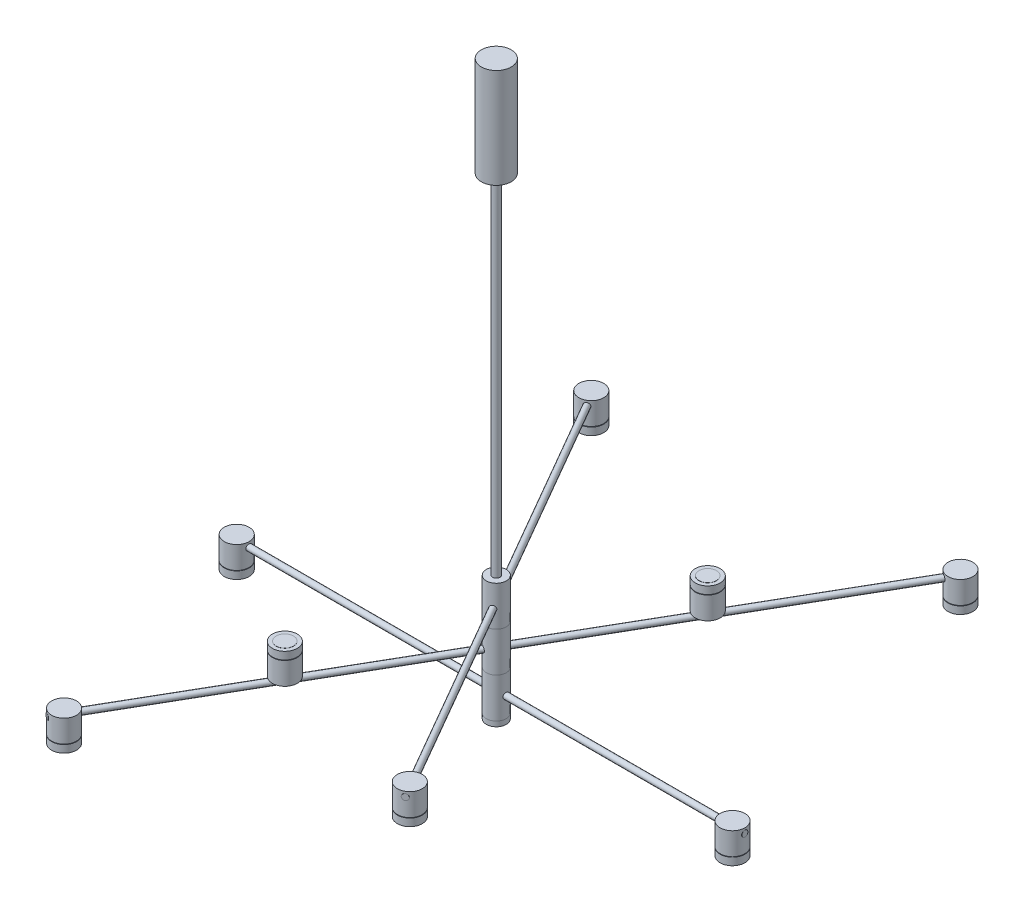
ISO-10303-21;
HEADER;
FILE_DESCRIPTION(('STEP AP214'),'2;1');
FILE_NAME('part.step','',(''),(''),'','','');
FILE_SCHEMA(('AUTOMOTIVE_DESIGN { 1 0 10303 214 1 1 1 1 }'));
ENDSEC;
DATA;
#1=APPLICATION_CONTEXT('core data for automotive mechanical design processes');
#2=APPLICATION_PROTOCOL_DEFINITION('international standard','automotive_design',2000,#1);
#3=PRODUCT_CONTEXT('',#1,'mechanical');
#4=PRODUCT('Part','Part','',(#3));
#5=PRODUCT_RELATED_PRODUCT_CATEGORY('part','',(#4));
#6=PRODUCT_DEFINITION_FORMATION('','',#4);
#7=PRODUCT_DEFINITION_CONTEXT('part definition',#1,'design');
#8=PRODUCT_DEFINITION('design','',#6,#7);
#9=PRODUCT_DEFINITION_SHAPE('','',#8);
#10=(LENGTH_UNIT() NAMED_UNIT(*) SI_UNIT(.MILLI.,.METRE.));
#11=(NAMED_UNIT(*) PLANE_ANGLE_UNIT() SI_UNIT($,.RADIAN.));
#12=(NAMED_UNIT(*) SI_UNIT($,.STERADIAN.) SOLID_ANGLE_UNIT());
#13=UNCERTAINTY_MEASURE_WITH_UNIT(LENGTH_MEASURE(1.E-05),#10,'distance_accuracy_value','');
#14=(GEOMETRIC_REPRESENTATION_CONTEXT(3) GLOBAL_UNCERTAINTY_ASSIGNED_CONTEXT((#13)) GLOBAL_UNIT_ASSIGNED_CONTEXT((#10,
#11,#12)) REPRESENTATION_CONTEXT('',''));
#15=CARTESIAN_POINT('',(0.,0.,0.));
#16=DIRECTION('',(0.,0.,1.));
#17=DIRECTION('',(1.,0.,0.));
#18=AXIS2_PLACEMENT_3D('',#15,#16,#17);
#19=CARTESIAN_POINT('',(0.,-10.,0.));
#20=DIRECTION('',(0.,1.,0.));
#21=DIRECTION('',(0.,0.,1.));
#22=AXIS2_PLACEMENT_3D('',#19,#20,#21);
#23=CYLINDRICAL_SURFACE('',#22,20.);
#24=CARTESIAN_POINT('',(0.,-10.,0.));
#25=DIRECTION('',(0.,-1.,0.));
#26=DIRECTION('',(0.,0.,-1.));
#27=AXIS2_PLACEMENT_3D('',#24,#25,#26);
#28=CIRCLE('',#27,20.);
#29=CARTESIAN_POINT('',(0.,-10.,-20.));
#30=VERTEX_POINT('',#29);
#31=EDGE_CURVE('E12',#30,#30,#28,.T.);
#32=ORIENTED_EDGE('',*,*,#31,.F.);
#33=EDGE_LOOP('',(#32));
#34=FACE_BOUND('',#33,.T.);
#35=CARTESIAN_POINT('',(0.,0.,0.));
#36=DIRECTION('',(0.,-1.,0.));
#37=DIRECTION('',(0.,0.,-1.));
#38=AXIS2_PLACEMENT_3D('',#35,#36,#37);
#39=CIRCLE('',#38,20.);
#40=CARTESIAN_POINT('',(0.,0.,-20.));
#41=VERTEX_POINT('',#40);
#42=EDGE_CURVE('E71',#41,#41,#39,.T.);
#43=ORIENTED_EDGE('',*,*,#42,.T.);
#44=EDGE_LOOP('',(#43));
#45=FACE_BOUND('',#44,.T.);
#46=ADVANCED_FACE('F68',(#34,#45),#23,.T.);
#47=CARTESIAN_POINT('',(0.,-10.,0.));
#48=DIRECTION('',(0.,-1.,0.));
#49=DIRECTION('',(0.,0.,-1.));
#50=AXIS2_PLACEMENT_3D('',#47,#48,#49);
#51=PLANE('',#50);
#52=ORIENTED_EDGE('',*,*,#31,.T.);
#53=EDGE_LOOP('',(#52));
#54=FACE_BOUND('',#53,.T.);
#55=ADVANCED_FACE('F83',(#54),#51,.T.);
#56=CARTESIAN_POINT('',(0.,0.,0.));
#57=DIRECTION('',(0.,-1.,0.));
#58=DIRECTION('',(0.,0.,-1.));
#59=AXIS2_PLACEMENT_3D('',#56,#57,#58);
#60=PLANE('',#59);
#61=ORIENTED_EDGE('',*,*,#42,.F.);
#62=EDGE_LOOP('',(#61));
#63=FACE_BOUND('',#62,.T.);
#64=ADVANCED_FACE('F81',(#63),#60,.F.);
#65=CLOSED_SHELL('',(#46,#55,#64));
#66=MANIFOLD_SOLID_BREP('B2',#65);
#67=CARTESIAN_POINT('',(-155.63837151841,182.25,269.57356707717));
#68=DIRECTION('',(0.,-1.,0.));
#69=DIRECTION('',(0.,0.,-1.));
#70=AXIS2_PLACEMENT_3D('',#67,#68,#69);
#71=CYLINDRICAL_SURFACE('',#70,17.5);
#72=CARTESIAN_POINT('',(-155.63837151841,182.25,269.57356707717));
#73=DIRECTION('',(0.,1.,0.));
#74=DIRECTION('',(0.,0.,1.));
#75=AXIS2_PLACEMENT_3D('',#72,#73,#74);
#76=CIRCLE('',#75,17.5);
#77=CARTESIAN_POINT('',(-155.63837151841,182.25,287.07356707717));
#78=VERTEX_POINT('',#77);
#79=EDGE_CURVE('E67',#78,#78,#76,.T.);
#80=ORIENTED_EDGE('',*,*,#79,.F.);
#81=EDGE_LOOP('',(#80));
#82=FACE_BOUND('',#81,.T.);
#83=CARTESIAN_POINT('',(-155.63837151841,182.,269.57356707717));
#84=DIRECTION('',(0.,1.,0.));
#85=DIRECTION('',(0.,0.,1.));
#86=AXIS2_PLACEMENT_3D('',#83,#84,#85);
#87=CIRCLE('',#86,17.5);
#88=CARTESIAN_POINT('',(-155.63837151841,182.,287.07356707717));
#89=VERTEX_POINT('',#88);
#90=EDGE_CURVE('E126',#89,#89,#87,.T.);
#91=ORIENTED_EDGE('',*,*,#90,.T.);
#92=EDGE_LOOP('',(#91));
#93=FACE_BOUND('',#92,.T.);
#94=ADVANCED_FACE('F123',(#82,#93),#71,.T.);
#95=CARTESIAN_POINT('',(-155.63837151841,182.25,269.57356707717));
#96=DIRECTION('',(0.,1.,0.));
#97=DIRECTION('',(0.,0.,1.));
#98=AXIS2_PLACEMENT_3D('',#95,#96,#97);
#99=PLANE('',#98);
#100=ORIENTED_EDGE('',*,*,#79,.T.);
#101=EDGE_LOOP('',(#100));
#102=FACE_BOUND('',#101,.T.);
#103=ADVANCED_FACE('F138',(#102),#99,.T.);
#104=CARTESIAN_POINT('',(-155.63837151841,182.,269.57356707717));
#105=DIRECTION('',(0.,1.,0.));
#106=DIRECTION('',(0.,0.,1.));
#107=AXIS2_PLACEMENT_3D('',#104,#105,#106);
#108=PLANE('',#107);
#109=ORIENTED_EDGE('',*,*,#90,.F.);
#110=EDGE_LOOP('',(#109));
#111=FACE_BOUND('',#110,.T.);
#112=ADVANCED_FACE('F136',(#111),#108,.F.);
#113=CLOSED_SHELL('',(#94,#103,#112));
#114=MANIFOLD_SOLID_BREP('B7',#113);
#115=CARTESIAN_POINT('',(155.63837151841,182.25,-269.57356707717));
#116=DIRECTION('',(0.,-1.,0.));
#117=DIRECTION('',(0.,0.,-1.));
#118=AXIS2_PLACEMENT_3D('',#115,#116,#117);
#119=CYLINDRICAL_SURFACE('',#118,17.5);
#120=CARTESIAN_POINT('',(155.63837151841,182.25,-269.57356707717));
#121=DIRECTION('',(0.,1.,0.));
#122=DIRECTION('',(0.,0.,1.));
#123=AXIS2_PLACEMENT_3D('',#120,#121,#122);
#124=CIRCLE('',#123,17.5);
#125=CARTESIAN_POINT('',(155.63837151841,182.25,-252.07356707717));
#126=VERTEX_POINT('',#125);
#127=EDGE_CURVE('E122',#126,#126,#124,.T.);
#128=ORIENTED_EDGE('',*,*,#127,.F.);
#129=EDGE_LOOP('',(#128));
#130=FACE_BOUND('',#129,.T.);
#131=CARTESIAN_POINT('',(155.63837151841,182.,-269.57356707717));
#132=DIRECTION('',(0.,1.,0.));
#133=DIRECTION('',(0.,0.,1.));
#134=AXIS2_PLACEMENT_3D('',#131,#132,#133);
#135=CIRCLE('',#134,17.5);
#136=CARTESIAN_POINT('',(155.63837151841,182.,-252.07356707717));
#137=VERTEX_POINT('',#136);
#138=EDGE_CURVE('E181',#137,#137,#135,.T.);
#139=ORIENTED_EDGE('',*,*,#138,.T.);
#140=EDGE_LOOP('',(#139));
#141=FACE_BOUND('',#140,.T.);
#142=ADVANCED_FACE('F178',(#130,#141),#119,.T.);
#143=CARTESIAN_POINT('',(155.63837151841,182.25,-269.57356707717));
#144=DIRECTION('',(0.,1.,0.));
#145=DIRECTION('',(0.,0.,1.));
#146=AXIS2_PLACEMENT_3D('',#143,#144,#145);
#147=PLANE('',#146);
#148=ORIENTED_EDGE('',*,*,#127,.T.);
#149=EDGE_LOOP('',(#148));
#150=FACE_BOUND('',#149,.T.);
#151=ADVANCED_FACE('F193',(#150),#147,.T.);
#152=CARTESIAN_POINT('',(155.63837151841,182.,-269.57356707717));
#153=DIRECTION('',(0.,1.,0.));
#154=DIRECTION('',(0.,0.,1.));
#155=AXIS2_PLACEMENT_3D('',#152,#153,#154);
#156=PLANE('',#155);
#157=ORIENTED_EDGE('',*,*,#138,.F.);
#158=EDGE_LOOP('',(#157));
#159=FACE_BOUND('',#158,.T.);
#160=ADVANCED_FACE('F191',(#159),#156,.F.);
#161=CLOSED_SHELL('',(#142,#151,#160));
#162=MANIFOLD_SOLID_BREP('B62',#161);
#163=CARTESIAN_POINT('',(341.63837151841,63.75,-591.735017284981));
#164=DIRECTION('',(0.,1.,0.));
#165=DIRECTION('',(0.,0.,1.));
#166=AXIS2_PLACEMENT_3D('',#163,#164,#165);
#167=CYLINDRICAL_SURFACE('',#166,17.5);
#168=CARTESIAN_POINT('',(341.63837151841,63.75,-591.735017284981));
#169=DIRECTION('',(0.,-1.,0.));
#170=DIRECTION('',(0.,0.,-1.));
#171=AXIS2_PLACEMENT_3D('',#168,#169,#170);
#172=CIRCLE('',#171,17.5);
#173=CARTESIAN_POINT('',(341.63837151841,63.75,-609.235017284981));
#174=VERTEX_POINT('',#173);
#175=EDGE_CURVE('E177',#174,#174,#172,.T.);
#176=ORIENTED_EDGE('',*,*,#175,.F.);
#177=EDGE_LOOP('',(#176));
#178=FACE_BOUND('',#177,.T.);
#179=CARTESIAN_POINT('',(341.63837151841,64.,-591.735017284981));
#180=DIRECTION('',(0.,-1.,0.));
#181=DIRECTION('',(0.,0.,-1.));
#182=AXIS2_PLACEMENT_3D('',#179,#180,#181);
#183=CIRCLE('',#182,17.5);
#184=CARTESIAN_POINT('',(341.63837151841,64.,-609.235017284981));
#185=VERTEX_POINT('',#184);
#186=EDGE_CURVE('E236',#185,#185,#183,.T.);
#187=ORIENTED_EDGE('',*,*,#186,.T.);
#188=EDGE_LOOP('',(#187));
#189=FACE_BOUND('',#188,.T.);
#190=ADVANCED_FACE('F233',(#178,#189),#167,.T.);
#191=CARTESIAN_POINT('',(341.63837151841,63.75,-591.735017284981));
#192=DIRECTION('',(0.,-1.,0.));
#193=DIRECTION('',(0.,0.,-1.));
#194=AXIS2_PLACEMENT_3D('',#191,#192,#193);
#195=PLANE('',#194);
#196=ORIENTED_EDGE('',*,*,#175,.T.);
#197=EDGE_LOOP('',(#196));
#198=FACE_BOUND('',#197,.T.);
#199=ADVANCED_FACE('F248',(#198),#195,.T.);
#200=CARTESIAN_POINT('',(341.63837151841,64.,-591.735017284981));
#201=DIRECTION('',(0.,-1.,0.));
#202=DIRECTION('',(0.,0.,-1.));
#203=AXIS2_PLACEMENT_3D('',#200,#201,#202);
#204=PLANE('',#203);
#205=ORIENTED_EDGE('',*,*,#186,.F.);
#206=EDGE_LOOP('',(#205));
#207=FACE_BOUND('',#206,.T.);
#208=ADVANCED_FACE('F246',(#207),#204,.F.);
#209=CLOSED_SHELL('',(#190,#199,#208));
#210=MANIFOLD_SOLID_BREP('B117',#209);
#211=CARTESIAN_POINT('',(-318.13837151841,63.75,551.031823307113));
#212=DIRECTION('',(0.,1.,0.));
#213=DIRECTION('',(0.,0.,1.));
#214=AXIS2_PLACEMENT_3D('',#211,#212,#213);
#215=CYLINDRICAL_SURFACE('',#214,17.5);
#216=CARTESIAN_POINT('',(-318.13837151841,63.75,551.031823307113));
#217=DIRECTION('',(0.,-1.,0.));
#218=DIRECTION('',(0.,0.,-1.));
#219=AXIS2_PLACEMENT_3D('',#216,#217,#218);
#220=CIRCLE('',#219,17.5);
#221=CARTESIAN_POINT('',(-318.13837151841,63.75,533.531823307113));
#222=VERTEX_POINT('',#221);
#223=EDGE_CURVE('E232',#222,#222,#220,.T.);
#224=ORIENTED_EDGE('',*,*,#223,.F.);
#225=EDGE_LOOP('',(#224));
#226=FACE_BOUND('',#225,.T.);
#227=CARTESIAN_POINT('',(-318.13837151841,64.,551.031823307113));
#228=DIRECTION('',(0.,-1.,0.));
#229=DIRECTION('',(0.,0.,-1.));
#230=AXIS2_PLACEMENT_3D('',#227,#228,#229);
#231=CIRCLE('',#230,17.5);
#232=CARTESIAN_POINT('',(-318.13837151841,64.,533.531823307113));
#233=VERTEX_POINT('',#232);
#234=EDGE_CURVE('E291',#233,#233,#231,.T.);
#235=ORIENTED_EDGE('',*,*,#234,.T.);
#236=EDGE_LOOP('',(#235));
#237=FACE_BOUND('',#236,.T.);
#238=ADVANCED_FACE('F288',(#226,#237),#215,.T.);
#239=CARTESIAN_POINT('',(-318.13837151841,63.75,551.031823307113));
#240=DIRECTION('',(0.,-1.,0.));
#241=DIRECTION('',(0.,0.,-1.));
#242=AXIS2_PLACEMENT_3D('',#239,#240,#241);
#243=PLANE('',#242);
#244=ORIENTED_EDGE('',*,*,#223,.T.);
#245=EDGE_LOOP('',(#244));
#246=FACE_BOUND('',#245,.T.);
#247=ADVANCED_FACE('F303',(#246),#243,.T.);
#248=CARTESIAN_POINT('',(-318.13837151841,64.,551.031823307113));
#249=DIRECTION('',(0.,-1.,0.));
#250=DIRECTION('',(0.,0.,-1.));
#251=AXIS2_PLACEMENT_3D('',#248,#249,#250);
#252=PLANE('',#251);
#253=ORIENTED_EDGE('',*,*,#234,.F.);
#254=EDGE_LOOP('',(#253));
#255=FACE_BOUND('',#254,.T.);
#256=ADVANCED_FACE('F301',(#255),#252,.F.);
#257=CLOSED_SHELL('',(#238,#247,#256));
#258=MANIFOLD_SOLID_BREP('B172',#257);
#259=CARTESIAN_POINT('',(-522.,-11.25,0.));
#260=DIRECTION('',(0.,1.,0.));
#261=DIRECTION('',(0.,0.,1.));
#262=AXIS2_PLACEMENT_3D('',#259,#260,#261);
#263=CYLINDRICAL_SURFACE('',#262,17.4999999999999);
#264=CARTESIAN_POINT('',(-522.,-11.25,0.));
#265=DIRECTION('',(0.,-1.,0.));
#266=DIRECTION('',(0.,0.,-1.));
#267=AXIS2_PLACEMENT_3D('',#264,#265,#266);
#268=CIRCLE('',#267,17.4999999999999);
#269=CARTESIAN_POINT('',(-522.,-11.25,-17.4999999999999));
#270=VERTEX_POINT('',#269);
#271=EDGE_CURVE('E287',#270,#270,#268,.T.);
#272=ORIENTED_EDGE('',*,*,#271,.F.);
#273=EDGE_LOOP('',(#272));
#274=FACE_BOUND('',#273,.T.);
#275=CARTESIAN_POINT('',(-522.,-11.,0.));
#276=DIRECTION('',(0.,-1.,0.));
#277=DIRECTION('',(0.,0.,-1.));
#278=AXIS2_PLACEMENT_3D('',#275,#276,#277);
#279=CIRCLE('',#278,17.4999999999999);
#280=CARTESIAN_POINT('',(-522.,-11.,-17.4999999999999));
#281=VERTEX_POINT('',#280);
#282=EDGE_CURVE('E346',#281,#281,#279,.T.);
#283=ORIENTED_EDGE('',*,*,#282,.T.);
#284=EDGE_LOOP('',(#283));
#285=FACE_BOUND('',#284,.T.);
#286=ADVANCED_FACE('F343',(#274,#285),#263,.T.);
#287=CARTESIAN_POINT('',(-522.,-11.25,0.));
#288=DIRECTION('',(0.,-1.,0.));
#289=DIRECTION('',(0.,0.,-1.));
#290=AXIS2_PLACEMENT_3D('',#287,#288,#289);
#291=PLANE('',#290);
#292=ORIENTED_EDGE('',*,*,#271,.T.);
#293=EDGE_LOOP('',(#292));
#294=FACE_BOUND('',#293,.T.);
#295=ADVANCED_FACE('F358',(#294),#291,.T.);
#296=CARTESIAN_POINT('',(-522.,-11.,0.));
#297=DIRECTION('',(0.,-1.,0.));
#298=DIRECTION('',(0.,0.,-1.));
#299=AXIS2_PLACEMENT_3D('',#296,#297,#298);
#300=PLANE('',#299);
#301=ORIENTED_EDGE('',*,*,#282,.F.);
#302=EDGE_LOOP('',(#301));
#303=FACE_BOUND('',#302,.T.);
#304=ADVANCED_FACE('F356',(#303),#300,.F.);
#305=CLOSED_SHELL('',(#286,#295,#304));
#306=MANIFOLD_SOLID_BREP('B227',#305);
#307=CARTESIAN_POINT('',(475.,-11.25,0.));
#308=DIRECTION('',(0.,1.,0.));
#309=DIRECTION('',(0.,0.,1.));
#310=AXIS2_PLACEMENT_3D('',#307,#308,#309);
#311=CYLINDRICAL_SURFACE('',#310,17.5);
#312=CARTESIAN_POINT('',(475.,-11.25,0.));
#313=DIRECTION('',(0.,-1.,0.));
#314=DIRECTION('',(0.,0.,-1.));
#315=AXIS2_PLACEMENT_3D('',#312,#313,#314);
#316=CIRCLE('',#315,17.5);
#317=CARTESIAN_POINT('',(475.,-11.25,-17.5));
#318=VERTEX_POINT('',#317);
#319=EDGE_CURVE('E342',#318,#318,#316,.T.);
#320=ORIENTED_EDGE('',*,*,#319,.F.);
#321=EDGE_LOOP('',(#320));
#322=FACE_BOUND('',#321,.T.);
#323=CARTESIAN_POINT('',(475.,-11.,0.));
#324=DIRECTION('',(0.,-1.,0.));
#325=DIRECTION('',(0.,0.,-1.));
#326=AXIS2_PLACEMENT_3D('',#323,#324,#325);
#327=CIRCLE('',#326,17.5);
#328=CARTESIAN_POINT('',(475.,-11.,-17.5));
#329=VERTEX_POINT('',#328);
#330=EDGE_CURVE('E401',#329,#329,#327,.T.);
#331=ORIENTED_EDGE('',*,*,#330,.T.);
#332=EDGE_LOOP('',(#331));
#333=FACE_BOUND('',#332,.T.);
#334=ADVANCED_FACE('F398',(#322,#333),#311,.T.);
#335=CARTESIAN_POINT('',(475.,-11.25,0.));
#336=DIRECTION('',(0.,-1.,0.));
#337=DIRECTION('',(0.,0.,-1.));
#338=AXIS2_PLACEMENT_3D('',#335,#336,#337);
#339=PLANE('',#338);
#340=ORIENTED_EDGE('',*,*,#319,.T.);
#341=EDGE_LOOP('',(#340));
#342=FACE_BOUND('',#341,.T.);
#343=ADVANCED_FACE('F413',(#342),#339,.T.);
#344=CARTESIAN_POINT('',(475.,-11.,0.));
#345=DIRECTION('',(0.,-1.,0.));
#346=DIRECTION('',(0.,0.,-1.));
#347=AXIS2_PLACEMENT_3D('',#344,#345,#346);
#348=PLANE('',#347);
#349=ORIENTED_EDGE('',*,*,#330,.F.);
#350=EDGE_LOOP('',(#349));
#351=FACE_BOUND('',#350,.T.);
#352=ADVANCED_FACE('F411',(#351),#348,.F.);
#353=CLOSED_SHELL('',(#334,#343,#352));
#354=MANIFOLD_SOLID_BREP('B282',#353);
#355=CARTESIAN_POINT('',(237.500000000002,143.75,411.362066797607));
#356=DIRECTION('',(0.,1.,0.));
#357=DIRECTION('',(0.,0.,1.));
#358=AXIS2_PLACEMENT_3D('',#355,#356,#357);
#359=CYLINDRICAL_SURFACE('',#358,17.5);
#360=CARTESIAN_POINT('',(237.500000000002,143.75,411.362066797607));
#361=DIRECTION('',(0.,-1.,0.));
#362=DIRECTION('',(0.,0.,-1.));
#363=AXIS2_PLACEMENT_3D('',#360,#361,#362);
#364=CIRCLE('',#363,17.5);
#365=CARTESIAN_POINT('',(237.500000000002,143.75,393.862066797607));
#366=VERTEX_POINT('',#365);
#367=EDGE_CURVE('E397',#366,#366,#364,.T.);
#368=ORIENTED_EDGE('',*,*,#367,.F.);
#369=EDGE_LOOP('',(#368));
#370=FACE_BOUND('',#369,.T.);
#371=CARTESIAN_POINT('',(237.500000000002,144.,411.362066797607));
#372=DIRECTION('',(0.,-1.,0.));
#373=DIRECTION('',(0.,0.,-1.));
#374=AXIS2_PLACEMENT_3D('',#371,#372,#373);
#375=CIRCLE('',#374,17.5);
#376=CARTESIAN_POINT('',(237.500000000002,144.,393.862066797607));
#377=VERTEX_POINT('',#376);
#378=EDGE_CURVE('E456',#377,#377,#375,.T.);
#379=ORIENTED_EDGE('',*,*,#378,.T.);
#380=EDGE_LOOP('',(#379));
#381=FACE_BOUND('',#380,.T.);
#382=ADVANCED_FACE('F453',(#370,#381),#359,.T.);
#383=CARTESIAN_POINT('',(237.500000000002,143.75,411.362066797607));
#384=DIRECTION('',(0.,-1.,0.));
#385=DIRECTION('',(0.,0.,-1.));
#386=AXIS2_PLACEMENT_3D('',#383,#384,#385);
#387=PLANE('',#386);
#388=ORIENTED_EDGE('',*,*,#367,.T.);
#389=EDGE_LOOP('',(#388));
#390=FACE_BOUND('',#389,.T.);
#391=ADVANCED_FACE('F468',(#390),#387,.T.);
#392=CARTESIAN_POINT('',(237.500000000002,144.,411.362066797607));
#393=DIRECTION('',(0.,-1.,0.));
#394=DIRECTION('',(0.,0.,-1.));
#395=AXIS2_PLACEMENT_3D('',#392,#393,#394);
#396=PLANE('',#395);
#397=ORIENTED_EDGE('',*,*,#378,.F.);
#398=EDGE_LOOP('',(#397));
#399=FACE_BOUND('',#398,.T.);
#400=ADVANCED_FACE('F466',(#399),#396,.F.);
#401=CLOSED_SHELL('',(#382,#391,#400));
#402=MANIFOLD_SOLID_BREP('B337',#401);
#403=CARTESIAN_POINT('',(-261.,143.75,-452.065260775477));
#404=DIRECTION('',(0.,1.,0.));
#405=DIRECTION('',(0.,0.,1.));
#406=AXIS2_PLACEMENT_3D('',#403,#404,#405);
#407=CYLINDRICAL_SURFACE('',#406,17.5);
#408=CARTESIAN_POINT('',(-261.,143.75,-452.065260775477));
#409=DIRECTION('',(0.,-1.,0.));
#410=DIRECTION('',(0.,0.,-1.));
#411=AXIS2_PLACEMENT_3D('',#408,#409,#410);
#412=CIRCLE('',#411,17.5);
#413=CARTESIAN_POINT('',(-261.,143.75,-469.565260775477));
#414=VERTEX_POINT('',#413);
#415=EDGE_CURVE('E452',#414,#414,#412,.T.);
#416=ORIENTED_EDGE('',*,*,#415,.F.);
#417=EDGE_LOOP('',(#416));
#418=FACE_BOUND('',#417,.T.);
#419=CARTESIAN_POINT('',(-261.,144.,-452.065260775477));
#420=DIRECTION('',(0.,-1.,0.));
#421=DIRECTION('',(0.,0.,-1.));
#422=AXIS2_PLACEMENT_3D('',#419,#420,#421);
#423=CIRCLE('',#422,17.5);
#424=CARTESIAN_POINT('',(-261.,144.,-469.565260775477));
#425=VERTEX_POINT('',#424);
#426=EDGE_CURVE('E511',#425,#425,#423,.T.);
#427=ORIENTED_EDGE('',*,*,#426,.T.);
#428=EDGE_LOOP('',(#427));
#429=FACE_BOUND('',#428,.T.);
#430=ADVANCED_FACE('F508',(#418,#429),#407,.T.);
#431=CARTESIAN_POINT('',(-261.,143.75,-452.065260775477));
#432=DIRECTION('',(0.,-1.,0.));
#433=DIRECTION('',(0.,0.,-1.));
#434=AXIS2_PLACEMENT_3D('',#431,#432,#433);
#435=PLANE('',#434);
#436=ORIENTED_EDGE('',*,*,#415,.T.);
#437=EDGE_LOOP('',(#436));
#438=FACE_BOUND('',#437,.T.);
#439=ADVANCED_FACE('F523',(#438),#435,.T.);
#440=CARTESIAN_POINT('',(-261.,144.,-452.065260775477));
#441=DIRECTION('',(0.,-1.,0.));
#442=DIRECTION('',(0.,0.,-1.));
#443=AXIS2_PLACEMENT_3D('',#440,#441,#442);
#444=PLANE('',#443);
#445=ORIENTED_EDGE('',*,*,#426,.F.);
#446=EDGE_LOOP('',(#445));
#447=FACE_BOUND('',#446,.T.);
#448=ADVANCED_FACE('F521',(#447),#444,.F.);
#449=CLOSED_SHELL('',(#430,#439,#448));
#450=MANIFOLD_SOLID_BREP('B392',#449);
#451=CARTESIAN_POINT('',(-155.63837151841,182.,269.57356707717));
#452=DIRECTION('',(0.,-1.,0.));
#453=DIRECTION('',(0.,0.,-1.));
#454=AXIS2_PLACEMENT_3D('',#451,#452,#453);
#455=CYLINDRICAL_SURFACE('',#454,25.);
#456=CARTESIAN_POINT('',(-155.63837151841,182.,269.57356707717));
#457=DIRECTION('',(0.,1.,0.));
#458=DIRECTION('',(0.,0.,1.));
#459=AXIS2_PLACEMENT_3D('',#456,#457,#458);
#460=CIRCLE('',#459,25.);
#461=CARTESIAN_POINT('',(-155.63837151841,182.,294.57356707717));
#462=VERTEX_POINT('',#461);
#463=EDGE_CURVE('E507',#462,#462,#460,.T.);
#464=ORIENTED_EDGE('',*,*,#463,.F.);
#465=EDGE_LOOP('',(#464));
#466=FACE_BOUND('',#465,.T.);
#467=CARTESIAN_POINT('',(-155.63837151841,167.,269.57356707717));
#468=DIRECTION('',(0.,1.,0.));
#469=DIRECTION('',(0.,0.,1.));
#470=AXIS2_PLACEMENT_3D('',#467,#468,#469);
#471=CIRCLE('',#470,25.);
#472=CARTESIAN_POINT('',(-155.63837151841,167.,294.57356707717));
#473=VERTEX_POINT('',#472);
#474=EDGE_CURVE('E566',#473,#473,#471,.T.);
#475=ORIENTED_EDGE('',*,*,#474,.T.);
#476=EDGE_LOOP('',(#475));
#477=FACE_BOUND('',#476,.T.);
#478=ADVANCED_FACE('F563',(#466,#477),#455,.T.);
#479=CARTESIAN_POINT('',(-155.63837151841,182.,269.57356707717));
#480=DIRECTION('',(0.,1.,0.));
#481=DIRECTION('',(0.,0.,1.));
#482=AXIS2_PLACEMENT_3D('',#479,#480,#481);
#483=PLANE('',#482);
#484=ORIENTED_EDGE('',*,*,#463,.T.);
#485=EDGE_LOOP('',(#484));
#486=FACE_BOUND('',#485,.T.);
#487=ADVANCED_FACE('F578',(#486),#483,.T.);
#488=CARTESIAN_POINT('',(-155.63837151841,167.,269.57356707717));
#489=DIRECTION('',(0.,1.,0.));
#490=DIRECTION('',(0.,0.,1.));
#491=AXIS2_PLACEMENT_3D('',#488,#489,#490);
#492=PLANE('',#491);
#493=ORIENTED_EDGE('',*,*,#474,.F.);
#494=EDGE_LOOP('',(#493));
#495=FACE_BOUND('',#494,.T.);
#496=ADVANCED_FACE('F576',(#495),#492,.F.);
#497=CLOSED_SHELL('',(#478,#487,#496));
#498=MANIFOLD_SOLID_BREP('B447',#497);
#499=CARTESIAN_POINT('',(155.63837151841,182.,-269.57356707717));
#500=DIRECTION('',(0.,-1.,0.));
#501=DIRECTION('',(0.,0.,-1.));
#502=AXIS2_PLACEMENT_3D('',#499,#500,#501);
#503=CYLINDRICAL_SURFACE('',#502,25.);
#504=CARTESIAN_POINT('',(155.63837151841,182.,-269.57356707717));
#505=DIRECTION('',(0.,1.,0.));
#506=DIRECTION('',(0.,0.,1.));
#507=AXIS2_PLACEMENT_3D('',#504,#505,#506);
#508=CIRCLE('',#507,25.);
#509=CARTESIAN_POINT('',(155.63837151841,182.,-244.57356707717));
#510=VERTEX_POINT('',#509);
#511=EDGE_CURVE('E562',#510,#510,#508,.T.);
#512=ORIENTED_EDGE('',*,*,#511,.F.);
#513=EDGE_LOOP('',(#512));
#514=FACE_BOUND('',#513,.T.);
#515=CARTESIAN_POINT('',(155.63837151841,167.,-269.57356707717));
#516=DIRECTION('',(0.,1.,0.));
#517=DIRECTION('',(0.,0.,1.));
#518=AXIS2_PLACEMENT_3D('',#515,#516,#517);
#519=CIRCLE('',#518,25.);
#520=CARTESIAN_POINT('',(155.63837151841,167.,-244.57356707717));
#521=VERTEX_POINT('',#520);
#522=EDGE_CURVE('E621',#521,#521,#519,.T.);
#523=ORIENTED_EDGE('',*,*,#522,.T.);
#524=EDGE_LOOP('',(#523));
#525=FACE_BOUND('',#524,.T.);
#526=ADVANCED_FACE('F618',(#514,#525),#503,.T.);
#527=CARTESIAN_POINT('',(155.63837151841,182.,-269.57356707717));
#528=DIRECTION('',(0.,1.,0.));
#529=DIRECTION('',(0.,0.,1.));
#530=AXIS2_PLACEMENT_3D('',#527,#528,#529);
#531=PLANE('',#530);
#532=ORIENTED_EDGE('',*,*,#511,.T.);
#533=EDGE_LOOP('',(#532));
#534=FACE_BOUND('',#533,.T.);
#535=ADVANCED_FACE('F633',(#534),#531,.T.);
#536=CARTESIAN_POINT('',(155.63837151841,167.,-269.57356707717));
#537=DIRECTION('',(0.,1.,0.));
#538=DIRECTION('',(0.,0.,1.));
#539=AXIS2_PLACEMENT_3D('',#536,#537,#538);
#540=PLANE('',#539);
#541=ORIENTED_EDGE('',*,*,#522,.F.);
#542=EDGE_LOOP('',(#541));
#543=FACE_BOUND('',#542,.T.);
#544=ADVANCED_FACE('F631',(#543),#540,.F.);
#545=CLOSED_SHELL('',(#526,#535,#544));
#546=MANIFOLD_SOLID_BREP('B502',#545);
#547=CARTESIAN_POINT('',(155.63837151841,167.,-269.57356707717));
#548=DIRECTION('',(0.,-1.,0.));
#549=DIRECTION('',(0.,0.,-1.));
#550=AXIS2_PLACEMENT_3D('',#547,#548,#549);
#551=CYLINDRICAL_SURFACE('',#550,24.);
#552=CARTESIAN_POINT('',(155.63837151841,167.,-269.57356707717));
#553=DIRECTION('',(0.,1.,0.));
#554=DIRECTION('',(0.,0.,1.));
#555=AXIS2_PLACEMENT_3D('',#552,#553,#554);
#556=CIRCLE('',#555,24.);
#557=CARTESIAN_POINT('',(155.63837151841,167.,-245.57356707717));
#558=VERTEX_POINT('',#557);
#559=EDGE_CURVE('E617',#558,#558,#556,.T.);
#560=ORIENTED_EDGE('',*,*,#559,.F.);
#561=EDGE_LOOP('',(#560));
#562=FACE_BOUND('',#561,.T.);
#563=CARTESIAN_POINT('',(155.63837151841,166.,-269.57356707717));
#564=DIRECTION('',(0.,1.,0.));
#565=DIRECTION('',(0.,0.,1.));
#566=AXIS2_PLACEMENT_3D('',#563,#564,#565);
#567=CIRCLE('',#566,24.);
#568=CARTESIAN_POINT('',(155.63837151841,166.,-245.57356707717));
#569=VERTEX_POINT('',#568);
#570=EDGE_CURVE('E676',#569,#569,#567,.T.);
#571=ORIENTED_EDGE('',*,*,#570,.T.);
#572=EDGE_LOOP('',(#571));
#573=FACE_BOUND('',#572,.T.);
#574=ADVANCED_FACE('F673',(#562,#573),#551,.T.);
#575=CARTESIAN_POINT('',(155.63837151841,167.,-269.57356707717));
#576=DIRECTION('',(0.,1.,0.));
#577=DIRECTION('',(0.,0.,1.));
#578=AXIS2_PLACEMENT_3D('',#575,#576,#577);
#579=PLANE('',#578);
#580=ORIENTED_EDGE('',*,*,#559,.T.);
#581=EDGE_LOOP('',(#580));
#582=FACE_BOUND('',#581,.T.);
#583=ADVANCED_FACE('F688',(#582),#579,.T.);
#584=CARTESIAN_POINT('',(155.63837151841,166.,-269.57356707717));
#585=DIRECTION('',(0.,1.,0.));
#586=DIRECTION('',(0.,0.,1.));
#587=AXIS2_PLACEMENT_3D('',#584,#585,#586);
#588=PLANE('',#587);
#589=ORIENTED_EDGE('',*,*,#570,.F.);
#590=EDGE_LOOP('',(#589));
#591=FACE_BOUND('',#590,.T.);
#592=ADVANCED_FACE('F686',(#591),#588,.F.);
#593=CLOSED_SHELL('',(#574,#583,#592));
#594=MANIFOLD_SOLID_BREP('B557',#593);
#595=CARTESIAN_POINT('',(-155.63837151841,167.,269.57356707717));
#596=DIRECTION('',(0.,-1.,0.));
#597=DIRECTION('',(0.,0.,-1.));
#598=AXIS2_PLACEMENT_3D('',#595,#596,#597);
#599=CYLINDRICAL_SURFACE('',#598,24.);
#600=CARTESIAN_POINT('',(-155.63837151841,167.,269.57356707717));
#601=DIRECTION('',(0.,1.,0.));
#602=DIRECTION('',(0.,0.,1.));
#603=AXIS2_PLACEMENT_3D('',#600,#601,#602);
#604=CIRCLE('',#603,24.);
#605=CARTESIAN_POINT('',(-155.63837151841,167.,293.57356707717));
#606=VERTEX_POINT('',#605);
#607=EDGE_CURVE('E672',#606,#606,#604,.T.);
#608=ORIENTED_EDGE('',*,*,#607,.F.);
#609=EDGE_LOOP('',(#608));
#610=FACE_BOUND('',#609,.T.);
#611=CARTESIAN_POINT('',(-155.63837151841,166.,269.57356707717));
#612=DIRECTION('',(0.,1.,0.));
#613=DIRECTION('',(0.,0.,1.));
#614=AXIS2_PLACEMENT_3D('',#611,#612,#613);
#615=CIRCLE('',#614,24.);
#616=CARTESIAN_POINT('',(-155.63837151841,166.,293.57356707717));
#617=VERTEX_POINT('',#616);
#618=EDGE_CURVE('E731',#617,#617,#615,.T.);
#619=ORIENTED_EDGE('',*,*,#618,.T.);
#620=EDGE_LOOP('',(#619));
#621=FACE_BOUND('',#620,.T.);
#622=ADVANCED_FACE('F728',(#610,#621),#599,.T.);
#623=CARTESIAN_POINT('',(-155.63837151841,167.,269.57356707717));
#624=DIRECTION('',(0.,1.,0.));
#625=DIRECTION('',(0.,0.,1.));
#626=AXIS2_PLACEMENT_3D('',#623,#624,#625);
#627=PLANE('',#626);
#628=ORIENTED_EDGE('',*,*,#607,.T.);
#629=EDGE_LOOP('',(#628));
#630=FACE_BOUND('',#629,.T.);
#631=ADVANCED_FACE('F743',(#630),#627,.T.);
#632=CARTESIAN_POINT('',(-155.63837151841,166.,269.57356707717));
#633=DIRECTION('',(0.,1.,0.));
#634=DIRECTION('',(0.,0.,1.));
#635=AXIS2_PLACEMENT_3D('',#632,#633,#634);
#636=PLANE('',#635);
#637=ORIENTED_EDGE('',*,*,#618,.F.);
#638=EDGE_LOOP('',(#637));
#639=FACE_BOUND('',#638,.T.);
#640=ADVANCED_FACE('F741',(#639),#636,.F.);
#641=CLOSED_SHELL('',(#622,#631,#640));
#642=MANIFOLD_SOLID_BREP('B612',#641);
#643=CARTESIAN_POINT('',(341.63837151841,64.,-591.735017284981));
#644=DIRECTION('',(0.,1.,0.));
#645=DIRECTION('',(0.,0.,1.));
#646=AXIS2_PLACEMENT_3D('',#643,#644,#645);
#647=CYLINDRICAL_SURFACE('',#646,25.);
#648=CARTESIAN_POINT('',(341.63837151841,64.,-591.735017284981));
#649=DIRECTION('',(0.,-1.,0.));
#650=DIRECTION('',(0.,0.,-1.));
#651=AXIS2_PLACEMENT_3D('',#648,#649,#650);
#652=CIRCLE('',#651,25.);
#653=CARTESIAN_POINT('',(341.63837151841,64.,-616.735017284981));
#654=VERTEX_POINT('',#653);
#655=EDGE_CURVE('E727',#654,#654,#652,.T.);
#656=ORIENTED_EDGE('',*,*,#655,.F.);
#657=EDGE_LOOP('',(#656));
#658=FACE_BOUND('',#657,.T.);
#659=CARTESIAN_POINT('',(341.63837151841,79.,-591.735017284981));
#660=DIRECTION('',(0.,-1.,0.));
#661=DIRECTION('',(0.,0.,-1.));
#662=AXIS2_PLACEMENT_3D('',#659,#660,#661);
#663=CIRCLE('',#662,25.);
#664=CARTESIAN_POINT('',(341.63837151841,79.,-616.735017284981));
#665=VERTEX_POINT('',#664);
#666=EDGE_CURVE('E786',#665,#665,#663,.T.);
#667=ORIENTED_EDGE('',*,*,#666,.T.);
#668=EDGE_LOOP('',(#667));
#669=FACE_BOUND('',#668,.T.);
#670=ADVANCED_FACE('F783',(#658,#669),#647,.T.);
#671=CARTESIAN_POINT('',(341.63837151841,64.,-591.735017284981));
#672=DIRECTION('',(0.,-1.,0.));
#673=DIRECTION('',(0.,0.,-1.));
#674=AXIS2_PLACEMENT_3D('',#671,#672,#673);
#675=PLANE('',#674);
#676=ORIENTED_EDGE('',*,*,#655,.T.);
#677=EDGE_LOOP('',(#676));
#678=FACE_BOUND('',#677,.T.);
#679=ADVANCED_FACE('F798',(#678),#675,.T.);
#680=CARTESIAN_POINT('',(341.63837151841,79.,-591.735017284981));
#681=DIRECTION('',(0.,-1.,0.));
#682=DIRECTION('',(0.,0.,-1.));
#683=AXIS2_PLACEMENT_3D('',#680,#681,#682);
#684=PLANE('',#683);
#685=ORIENTED_EDGE('',*,*,#666,.F.);
#686=EDGE_LOOP('',(#685));
#687=FACE_BOUND('',#686,.T.);
#688=ADVANCED_FACE('F796',(#687),#684,.F.);
#689=CLOSED_SHELL('',(#670,#679,#688));
#690=MANIFOLD_SOLID_BREP('B667',#689);
#691=CARTESIAN_POINT('',(-318.13837151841,64.,551.031823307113));
#692=DIRECTION('',(0.,1.,0.));
#693=DIRECTION('',(0.,0.,1.));
#694=AXIS2_PLACEMENT_3D('',#691,#692,#693);
#695=CYLINDRICAL_SURFACE('',#694,25.0000000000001);
#696=CARTESIAN_POINT('',(-318.13837151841,64.,551.031823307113));
#697=DIRECTION('',(0.,-1.,0.));
#698=DIRECTION('',(0.,0.,-1.));
#699=AXIS2_PLACEMENT_3D('',#696,#697,#698);
#700=CIRCLE('',#699,25.0000000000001);
#701=CARTESIAN_POINT('',(-318.13837151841,64.,526.031823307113));
#702=VERTEX_POINT('',#701);
#703=EDGE_CURVE('E782',#702,#702,#700,.T.);
#704=ORIENTED_EDGE('',*,*,#703,.F.);
#705=EDGE_LOOP('',(#704));
#706=FACE_BOUND('',#705,.T.);
#707=CARTESIAN_POINT('',(-318.13837151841,79.,551.031823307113));
#708=DIRECTION('',(0.,-1.,0.));
#709=DIRECTION('',(0.,0.,-1.));
#710=AXIS2_PLACEMENT_3D('',#707,#708,#709);
#711=CIRCLE('',#710,25.0000000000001);
#712=CARTESIAN_POINT('',(-318.13837151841,79.,526.031823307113));
#713=VERTEX_POINT('',#712);
#714=EDGE_CURVE('E841',#713,#713,#711,.T.);
#715=ORIENTED_EDGE('',*,*,#714,.T.);
#716=EDGE_LOOP('',(#715));
#717=FACE_BOUND('',#716,.T.);
#718=ADVANCED_FACE('F838',(#706,#717),#695,.T.);
#719=CARTESIAN_POINT('',(-318.13837151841,64.,551.031823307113));
#720=DIRECTION('',(0.,-1.,0.));
#721=DIRECTION('',(0.,0.,-1.));
#722=AXIS2_PLACEMENT_3D('',#719,#720,#721);
#723=PLANE('',#722);
#724=ORIENTED_EDGE('',*,*,#703,.T.);
#725=EDGE_LOOP('',(#724));
#726=FACE_BOUND('',#725,.T.);
#727=ADVANCED_FACE('F853',(#726),#723,.T.);
#728=CARTESIAN_POINT('',(-318.13837151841,79.,551.031823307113));
#729=DIRECTION('',(0.,-1.,0.));
#730=DIRECTION('',(0.,0.,-1.));
#731=AXIS2_PLACEMENT_3D('',#728,#729,#730);
#732=PLANE('',#731);
#733=ORIENTED_EDGE('',*,*,#714,.F.);
#734=EDGE_LOOP('',(#733));
#735=FACE_BOUND('',#734,.T.);
#736=ADVANCED_FACE('F851',(#735),#732,.F.);
#737=CLOSED_SHELL('',(#718,#727,#736));
#738=MANIFOLD_SOLID_BREP('B722',#737);
#739=CARTESIAN_POINT('',(-318.13837151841,79.,551.031823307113));
#740=DIRECTION('',(0.,1.,0.));
#741=DIRECTION('',(0.,0.,1.));
#742=AXIS2_PLACEMENT_3D('',#739,#740,#741);
#743=CYLINDRICAL_SURFACE('',#742,24.);
#744=CARTESIAN_POINT('',(-318.13837151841,79.,551.031823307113));
#745=DIRECTION('',(0.,-1.,0.));
#746=DIRECTION('',(0.,0.,-1.));
#747=AXIS2_PLACEMENT_3D('',#744,#745,#746);
#748=CIRCLE('',#747,24.);
#749=CARTESIAN_POINT('',(-318.13837151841,79.,527.031823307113));
#750=VERTEX_POINT('',#749);
#751=EDGE_CURVE('E837',#750,#750,#748,.T.);
#752=ORIENTED_EDGE('',*,*,#751,.F.);
#753=EDGE_LOOP('',(#752));
#754=FACE_BOUND('',#753,.T.);
#755=CARTESIAN_POINT('',(-318.13837151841,80.,551.031823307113));
#756=DIRECTION('',(0.,-1.,0.));
#757=DIRECTION('',(0.,0.,-1.));
#758=AXIS2_PLACEMENT_3D('',#755,#756,#757);
#759=CIRCLE('',#758,24.);
#760=CARTESIAN_POINT('',(-318.13837151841,80.,527.031823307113));
#761=VERTEX_POINT('',#760);
#762=EDGE_CURVE('E896',#761,#761,#759,.T.);
#763=ORIENTED_EDGE('',*,*,#762,.T.);
#764=EDGE_LOOP('',(#763));
#765=FACE_BOUND('',#764,.T.);
#766=ADVANCED_FACE('F893',(#754,#765),#743,.T.);
#767=CARTESIAN_POINT('',(-318.13837151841,79.,551.031823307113));
#768=DIRECTION('',(0.,-1.,0.));
#769=DIRECTION('',(0.,0.,-1.));
#770=AXIS2_PLACEMENT_3D('',#767,#768,#769);
#771=PLANE('',#770);
#772=ORIENTED_EDGE('',*,*,#751,.T.);
#773=EDGE_LOOP('',(#772));
#774=FACE_BOUND('',#773,.T.);
#775=ADVANCED_FACE('F908',(#774),#771,.T.);
#776=CARTESIAN_POINT('',(-318.13837151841,80.,551.031823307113));
#777=DIRECTION('',(0.,-1.,0.));
#778=DIRECTION('',(0.,0.,-1.));
#779=AXIS2_PLACEMENT_3D('',#776,#777,#778);
#780=PLANE('',#779);
#781=ORIENTED_EDGE('',*,*,#762,.F.);
#782=EDGE_LOOP('',(#781));
#783=FACE_BOUND('',#782,.T.);
#784=ADVANCED_FACE('F906',(#783),#780,.F.);
#785=CLOSED_SHELL('',(#766,#775,#784));
#786=MANIFOLD_SOLID_BREP('B777',#785);
#787=CARTESIAN_POINT('',(341.63837151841,79.,-591.735017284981));
#788=DIRECTION('',(0.,1.,0.));
#789=DIRECTION('',(0.,0.,1.));
#790=AXIS2_PLACEMENT_3D('',#787,#788,#789);
#791=CYLINDRICAL_SURFACE('',#790,24.);
#792=CARTESIAN_POINT('',(341.63837151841,79.,-591.735017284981));
#793=DIRECTION('',(0.,-1.,0.));
#794=DIRECTION('',(0.,0.,-1.));
#795=AXIS2_PLACEMENT_3D('',#792,#793,#794);
#796=CIRCLE('',#795,24.);
#797=CARTESIAN_POINT('',(341.63837151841,79.,-615.735017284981));
#798=VERTEX_POINT('',#797);
#799=EDGE_CURVE('E892',#798,#798,#796,.T.);
#800=ORIENTED_EDGE('',*,*,#799,.F.);
#801=EDGE_LOOP('',(#800));
#802=FACE_BOUND('',#801,.T.);
#803=CARTESIAN_POINT('',(341.63837151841,80.,-591.735017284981));
#804=DIRECTION('',(0.,-1.,0.));
#805=DIRECTION('',(0.,0.,-1.));
#806=AXIS2_PLACEMENT_3D('',#803,#804,#805);
#807=CIRCLE('',#806,24.);
#808=CARTESIAN_POINT('',(341.63837151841,80.,-615.735017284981));
#809=VERTEX_POINT('',#808);
#810=EDGE_CURVE('E951',#809,#809,#807,.T.);
#811=ORIENTED_EDGE('',*,*,#810,.T.);
#812=EDGE_LOOP('',(#811));
#813=FACE_BOUND('',#812,.T.);
#814=ADVANCED_FACE('F948',(#802,#813),#791,.T.);
#815=CARTESIAN_POINT('',(341.63837151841,79.,-591.735017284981));
#816=DIRECTION('',(0.,-1.,0.));
#817=DIRECTION('',(0.,0.,-1.));
#818=AXIS2_PLACEMENT_3D('',#815,#816,#817);
#819=PLANE('',#818);
#820=ORIENTED_EDGE('',*,*,#799,.T.);
#821=EDGE_LOOP('',(#820));
#822=FACE_BOUND('',#821,.T.);
#823=ADVANCED_FACE('F963',(#822),#819,.T.);
#824=CARTESIAN_POINT('',(341.63837151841,80.,-591.735017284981));
#825=DIRECTION('',(0.,-1.,0.));
#826=DIRECTION('',(0.,0.,-1.));
#827=AXIS2_PLACEMENT_3D('',#824,#825,#826);
#828=PLANE('',#827);
#829=ORIENTED_EDGE('',*,*,#810,.F.);
#830=EDGE_LOOP('',(#829));
#831=FACE_BOUND('',#830,.T.);
#832=ADVANCED_FACE('F961',(#831),#828,.F.);
#833=CLOSED_SHELL('',(#814,#823,#832));
#834=MANIFOLD_SOLID_BREP('B832',#833);
#835=CARTESIAN_POINT('',(-522.,-11.,0.));
#836=DIRECTION('',(0.,1.,0.));
#837=DIRECTION('',(0.,0.,1.));
#838=AXIS2_PLACEMENT_3D('',#835,#836,#837);
#839=CYLINDRICAL_SURFACE('',#838,25.);
#840=CARTESIAN_POINT('',(-522.,-11.,0.));
#841=DIRECTION('',(0.,-1.,0.));
#842=DIRECTION('',(0.,0.,-1.));
#843=AXIS2_PLACEMENT_3D('',#840,#841,#842);
#844=CIRCLE('',#843,25.);
#845=CARTESIAN_POINT('',(-522.,-11.,-25.));
#846=VERTEX_POINT('',#845);
#847=EDGE_CURVE('E947',#846,#846,#844,.T.);
#848=ORIENTED_EDGE('',*,*,#847,.F.);
#849=EDGE_LOOP('',(#848));
#850=FACE_BOUND('',#849,.T.);
#851=CARTESIAN_POINT('',(-522.,4.,0.));
#852=DIRECTION('',(0.,-1.,0.));
#853=DIRECTION('',(0.,0.,-1.));
#854=AXIS2_PLACEMENT_3D('',#851,#852,#853);
#855=CIRCLE('',#854,25.);
#856=CARTESIAN_POINT('',(-522.,4.,-25.));
#857=VERTEX_POINT('',#856);
#858=EDGE_CURVE('E1006',#857,#857,#855,.T.);
#859=ORIENTED_EDGE('',*,*,#858,.T.);
#860=EDGE_LOOP('',(#859));
#861=FACE_BOUND('',#860,.T.);
#862=ADVANCED_FACE('F1003',(#850,#861),#839,.T.);
#863=CARTESIAN_POINT('',(-522.,-11.,0.));
#864=DIRECTION('',(0.,-1.,0.));
#865=DIRECTION('',(0.,0.,-1.));
#866=AXIS2_PLACEMENT_3D('',#863,#864,#865);
#867=PLANE('',#866);
#868=ORIENTED_EDGE('',*,*,#847,.T.);
#869=EDGE_LOOP('',(#868));
#870=FACE_BOUND('',#869,.T.);
#871=ADVANCED_FACE('F1018',(#870),#867,.T.);
#872=CARTESIAN_POINT('',(-522.,4.,0.));
#873=DIRECTION('',(0.,-1.,0.));
#874=DIRECTION('',(0.,0.,-1.));
#875=AXIS2_PLACEMENT_3D('',#872,#873,#874);
#876=PLANE('',#875);
#877=ORIENTED_EDGE('',*,*,#858,.F.);
#878=EDGE_LOOP('',(#877));
#879=FACE_BOUND('',#878,.T.);
#880=ADVANCED_FACE('F1016',(#879),#876,.F.);
#881=CLOSED_SHELL('',(#862,#871,#880));
#882=MANIFOLD_SOLID_BREP('B887',#881);
#883=CARTESIAN_POINT('',(475.,-11.,0.));
#884=DIRECTION('',(0.,1.,0.));
#885=DIRECTION('',(0.,0.,1.));
#886=AXIS2_PLACEMENT_3D('',#883,#884,#885);
#887=CYLINDRICAL_SURFACE('',#886,25.);
#888=CARTESIAN_POINT('',(475.,-11.,0.));
#889=DIRECTION('',(0.,-1.,0.));
#890=DIRECTION('',(0.,0.,-1.));
#891=AXIS2_PLACEMENT_3D('',#888,#889,#890);
#892=CIRCLE('',#891,25.);
#893=CARTESIAN_POINT('',(475.,-11.,-25.));
#894=VERTEX_POINT('',#893);
#895=EDGE_CURVE('E1002',#894,#894,#892,.T.);
#896=ORIENTED_EDGE('',*,*,#895,.F.);
#897=EDGE_LOOP('',(#896));
#898=FACE_BOUND('',#897,.T.);
#899=CARTESIAN_POINT('',(475.,4.,0.));
#900=DIRECTION('',(0.,-1.,0.));
#901=DIRECTION('',(0.,0.,-1.));
#902=AXIS2_PLACEMENT_3D('',#899,#900,#901);
#903=CIRCLE('',#902,25.);
#904=CARTESIAN_POINT('',(475.,4.,-25.));
#905=VERTEX_POINT('',#904);
#906=EDGE_CURVE('E1061',#905,#905,#903,.T.);
#907=ORIENTED_EDGE('',*,*,#906,.T.);
#908=EDGE_LOOP('',(#907));
#909=FACE_BOUND('',#908,.T.);
#910=ADVANCED_FACE('F1058',(#898,#909),#887,.T.);
#911=CARTESIAN_POINT('',(475.,-11.,0.));
#912=DIRECTION('',(0.,-1.,0.));
#913=DIRECTION('',(0.,0.,-1.));
#914=AXIS2_PLACEMENT_3D('',#911,#912,#913);
#915=PLANE('',#914);
#916=ORIENTED_EDGE('',*,*,#895,.T.);
#917=EDGE_LOOP('',(#916));
#918=FACE_BOUND('',#917,.T.);
#919=ADVANCED_FACE('F1073',(#918),#915,.T.);
#920=CARTESIAN_POINT('',(475.,4.,0.));
#921=DIRECTION('',(0.,-1.,0.));
#922=DIRECTION('',(0.,0.,-1.));
#923=AXIS2_PLACEMENT_3D('',#920,#921,#922);
#924=PLANE('',#923);
#925=ORIENTED_EDGE('',*,*,#906,.F.);
#926=EDGE_LOOP('',(#925));
#927=FACE_BOUND('',#926,.T.);
#928=ADVANCED_FACE('F1071',(#927),#924,.F.);
#929=CLOSED_SHELL('',(#910,#919,#928));
#930=MANIFOLD_SOLID_BREP('B942',#929);
#931=CARTESIAN_POINT('',(-522.,4.,0.));
#932=DIRECTION('',(0.,1.,0.));
#933=DIRECTION('',(0.,0.,1.));
#934=AXIS2_PLACEMENT_3D('',#931,#932,#933);
#935=CYLINDRICAL_SURFACE('',#934,24.);
#936=CARTESIAN_POINT('',(-522.,4.,0.));
#937=DIRECTION('',(0.,-1.,0.));
#938=DIRECTION('',(0.,0.,-1.));
#939=AXIS2_PLACEMENT_3D('',#936,#937,#938);
#940=CIRCLE('',#939,24.);
#941=CARTESIAN_POINT('',(-522.,4.,-24.));
#942=VERTEX_POINT('',#941);
#943=EDGE_CURVE('E1057',#942,#942,#940,.T.);
#944=ORIENTED_EDGE('',*,*,#943,.F.);
#945=EDGE_LOOP('',(#944));
#946=FACE_BOUND('',#945,.T.);
#947=CARTESIAN_POINT('',(-522.,5.,0.));
#948=DIRECTION('',(0.,-1.,0.));
#949=DIRECTION('',(0.,0.,-1.));
#950=AXIS2_PLACEMENT_3D('',#947,#948,#949);
#951=CIRCLE('',#950,24.);
#952=CARTESIAN_POINT('',(-522.,5.,-24.));
#953=VERTEX_POINT('',#952);
#954=EDGE_CURVE('E1116',#953,#953,#951,.T.);
#955=ORIENTED_EDGE('',*,*,#954,.T.);
#956=EDGE_LOOP('',(#955));
#957=FACE_BOUND('',#956,.T.);
#958=ADVANCED_FACE('F1113',(#946,#957),#935,.T.);
#959=CARTESIAN_POINT('',(-522.,4.,0.));
#960=DIRECTION('',(0.,-1.,0.));
#961=DIRECTION('',(0.,0.,-1.));
#962=AXIS2_PLACEMENT_3D('',#959,#960,#961);
#963=PLANE('',#962);
#964=ORIENTED_EDGE('',*,*,#943,.T.);
#965=EDGE_LOOP('',(#964));
#966=FACE_BOUND('',#965,.T.);
#967=ADVANCED_FACE('F1128',(#966),#963,.T.);
#968=CARTESIAN_POINT('',(-522.,5.,0.));
#969=DIRECTION('',(0.,-1.,0.));
#970=DIRECTION('',(0.,0.,-1.));
#971=AXIS2_PLACEMENT_3D('',#968,#969,#970);
#972=PLANE('',#971);
#973=ORIENTED_EDGE('',*,*,#954,.F.);
#974=EDGE_LOOP('',(#973));
#975=FACE_BOUND('',#974,.T.);
#976=ADVANCED_FACE('F1126',(#975),#972,.F.);
#977=CLOSED_SHELL('',(#958,#967,#976));
#978=MANIFOLD_SOLID_BREP('B997',#977);
#979=CARTESIAN_POINT('',(475.,4.,0.));
#980=DIRECTION('',(0.,1.,0.));
#981=DIRECTION('',(0.,0.,1.));
#982=AXIS2_PLACEMENT_3D('',#979,#980,#981);
#983=CYLINDRICAL_SURFACE('',#982,24.);
#984=CARTESIAN_POINT('',(475.,4.,0.));
#985=DIRECTION('',(0.,-1.,0.));
#986=DIRECTION('',(0.,0.,-1.));
#987=AXIS2_PLACEMENT_3D('',#984,#985,#986);
#988=CIRCLE('',#987,24.);
#989=CARTESIAN_POINT('',(475.,4.,-24.));
#990=VERTEX_POINT('',#989);
#991=EDGE_CURVE('E1112',#990,#990,#988,.T.);
#992=ORIENTED_EDGE('',*,*,#991,.F.);
#993=EDGE_LOOP('',(#992));
#994=FACE_BOUND('',#993,.T.);
#995=CARTESIAN_POINT('',(475.,5.,0.));
#996=DIRECTION('',(0.,-1.,0.));
#997=DIRECTION('',(0.,0.,-1.));
#998=AXIS2_PLACEMENT_3D('',#995,#996,#997);
#999=CIRCLE('',#998,24.);
#1000=CARTESIAN_POINT('',(475.,5.,-24.));
#1001=VERTEX_POINT('',#1000);
#1002=EDGE_CURVE('E1171',#1001,#1001,#999,.T.);
#1003=ORIENTED_EDGE('',*,*,#1002,.T.);
#1004=EDGE_LOOP('',(#1003));
#1005=FACE_BOUND('',#1004,.T.);
#1006=ADVANCED_FACE('F1168',(#994,#1005),#983,.T.);
#1007=CARTESIAN_POINT('',(475.,4.,0.));
#1008=DIRECTION('',(0.,-1.,0.));
#1009=DIRECTION('',(0.,0.,-1.));
#1010=AXIS2_PLACEMENT_3D('',#1007,#1008,#1009);
#1011=PLANE('',#1010);
#1012=ORIENTED_EDGE('',*,*,#991,.T.);
#1013=EDGE_LOOP('',(#1012));
#1014=FACE_BOUND('',#1013,.T.);
#1015=ADVANCED_FACE('F1183',(#1014),#1011,.T.);
#1016=CARTESIAN_POINT('',(475.,5.,0.));
#1017=DIRECTION('',(0.,-1.,0.));
#1018=DIRECTION('',(0.,0.,-1.));
#1019=AXIS2_PLACEMENT_3D('',#1016,#1017,#1018);
#1020=PLANE('',#1019);
#1021=ORIENTED_EDGE('',*,*,#1002,.F.);
#1022=EDGE_LOOP('',(#1021));
#1023=FACE_BOUND('',#1022,.T.);
#1024=ADVANCED_FACE('F1181',(#1023),#1020,.F.);
#1025=CLOSED_SHELL('',(#1006,#1015,#1024));
#1026=MANIFOLD_SOLID_BREP('B1052',#1025);
#1027=CARTESIAN_POINT('',(237.500000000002,144.,411.362066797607));
#1028=DIRECTION('',(0.,1.,0.));
#1029=DIRECTION('',(0.,0.,1.));
#1030=AXIS2_PLACEMENT_3D('',#1027,#1028,#1029);
#1031=CYLINDRICAL_SURFACE('',#1030,25.);
#1032=CARTESIAN_POINT('',(237.500000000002,144.,411.362066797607));
#1033=DIRECTION('',(0.,-1.,0.));
#1034=DIRECTION('',(0.,0.,-1.));
#1035=AXIS2_PLACEMENT_3D('',#1032,#1033,#1034);
#1036=CIRCLE('',#1035,25.);
#1037=CARTESIAN_POINT('',(237.500000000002,144.,386.362066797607));
#1038=VERTEX_POINT('',#1037);
#1039=EDGE_CURVE('E1167',#1038,#1038,#1036,.T.);
#1040=ORIENTED_EDGE('',*,*,#1039,.F.);
#1041=EDGE_LOOP('',(#1040));
#1042=FACE_BOUND('',#1041,.T.);
#1043=CARTESIAN_POINT('',(237.500000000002,159.,411.362066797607));
#1044=DIRECTION('',(0.,-1.,0.));
#1045=DIRECTION('',(0.,0.,-1.));
#1046=AXIS2_PLACEMENT_3D('',#1043,#1044,#1045);
#1047=CIRCLE('',#1046,25.);
#1048=CARTESIAN_POINT('',(237.500000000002,159.,386.362066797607));
#1049=VERTEX_POINT('',#1048);
#1050=EDGE_CURVE('E1226',#1049,#1049,#1047,.T.);
#1051=ORIENTED_EDGE('',*,*,#1050,.T.);
#1052=EDGE_LOOP('',(#1051));
#1053=FACE_BOUND('',#1052,.T.);
#1054=ADVANCED_FACE('F1223',(#1042,#1053),#1031,.T.);
#1055=CARTESIAN_POINT('',(237.500000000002,144.,411.362066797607));
#1056=DIRECTION('',(0.,-1.,0.));
#1057=DIRECTION('',(0.,0.,-1.));
#1058=AXIS2_PLACEMENT_3D('',#1055,#1056,#1057);
#1059=PLANE('',#1058);
#1060=ORIENTED_EDGE('',*,*,#1039,.T.);
#1061=EDGE_LOOP('',(#1060));
#1062=FACE_BOUND('',#1061,.T.);
#1063=ADVANCED_FACE('F1238',(#1062),#1059,.T.);
#1064=CARTESIAN_POINT('',(237.500000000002,159.,411.362066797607));
#1065=DIRECTION('',(0.,-1.,0.));
#1066=DIRECTION('',(0.,0.,-1.));
#1067=AXIS2_PLACEMENT_3D('',#1064,#1065,#1066);
#1068=PLANE('',#1067);
#1069=ORIENTED_EDGE('',*,*,#1050,.F.);
#1070=EDGE_LOOP('',(#1069));
#1071=FACE_BOUND('',#1070,.T.);
#1072=ADVANCED_FACE('F1236',(#1071),#1068,.F.);
#1073=CLOSED_SHELL('',(#1054,#1063,#1072));
#1074=MANIFOLD_SOLID_BREP('B1107',#1073);
#1075=CARTESIAN_POINT('',(-261.,144.,-452.065260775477));
#1076=DIRECTION('',(0.,1.,0.));
#1077=DIRECTION('',(0.,0.,1.));
#1078=AXIS2_PLACEMENT_3D('',#1075,#1076,#1077);
#1079=CYLINDRICAL_SURFACE('',#1078,25.);
#1080=CARTESIAN_POINT('',(-261.,144.,-452.065260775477));
#1081=DIRECTION('',(0.,-1.,0.));
#1082=DIRECTION('',(0.,0.,-1.));
#1083=AXIS2_PLACEMENT_3D('',#1080,#1081,#1082);
#1084=CIRCLE('',#1083,25.);
#1085=CARTESIAN_POINT('',(-261.,144.,-477.065260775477));
#1086=VERTEX_POINT('',#1085);
#1087=EDGE_CURVE('E1222',#1086,#1086,#1084,.T.);
#1088=ORIENTED_EDGE('',*,*,#1087,.F.);
#1089=EDGE_LOOP('',(#1088));
#1090=FACE_BOUND('',#1089,.T.);
#1091=CARTESIAN_POINT('',(-261.,159.,-452.065260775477));
#1092=DIRECTION('',(0.,-1.,0.));
#1093=DIRECTION('',(0.,0.,-1.));
#1094=AXIS2_PLACEMENT_3D('',#1091,#1092,#1093);
#1095=CIRCLE('',#1094,25.);
#1096=CARTESIAN_POINT('',(-261.,159.,-477.065260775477));
#1097=VERTEX_POINT('',#1096);
#1098=EDGE_CURVE('E1281',#1097,#1097,#1095,.T.);
#1099=ORIENTED_EDGE('',*,*,#1098,.T.);
#1100=EDGE_LOOP('',(#1099));
#1101=FACE_BOUND('',#1100,.T.);
#1102=ADVANCED_FACE('F1278',(#1090,#1101),#1079,.T.);
#1103=CARTESIAN_POINT('',(-261.,144.,-452.065260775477));
#1104=DIRECTION('',(0.,-1.,0.));
#1105=DIRECTION('',(0.,0.,-1.));
#1106=AXIS2_PLACEMENT_3D('',#1103,#1104,#1105);
#1107=PLANE('',#1106);
#1108=ORIENTED_EDGE('',*,*,#1087,.T.);
#1109=EDGE_LOOP('',(#1108));
#1110=FACE_BOUND('',#1109,.T.);
#1111=ADVANCED_FACE('F1293',(#1110),#1107,.T.);
#1112=CARTESIAN_POINT('',(-261.,159.,-452.065260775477));
#1113=DIRECTION('',(0.,-1.,0.));
#1114=DIRECTION('',(0.,0.,-1.));
#1115=AXIS2_PLACEMENT_3D('',#1112,#1113,#1114);
#1116=PLANE('',#1115);
#1117=ORIENTED_EDGE('',*,*,#1098,.F.);
#1118=EDGE_LOOP('',(#1117));
#1119=FACE_BOUND('',#1118,.T.);
#1120=ADVANCED_FACE('F1291',(#1119),#1116,.F.);
#1121=CLOSED_SHELL('',(#1102,#1111,#1120));
#1122=MANIFOLD_SOLID_BREP('B1162',#1121);
#1123=CARTESIAN_POINT('',(237.500000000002,159.,411.362066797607));
#1124=DIRECTION('',(0.,1.,0.));
#1125=DIRECTION('',(0.,0.,1.));
#1126=AXIS2_PLACEMENT_3D('',#1123,#1124,#1125);
#1127=CYLINDRICAL_SURFACE('',#1126,24.);
#1128=CARTESIAN_POINT('',(237.500000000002,159.,411.362066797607));
#1129=DIRECTION('',(0.,-1.,0.));
#1130=DIRECTION('',(0.,0.,-1.));
#1131=AXIS2_PLACEMENT_3D('',#1128,#1129,#1130);
#1132=CIRCLE('',#1131,24.);
#1133=CARTESIAN_POINT('',(237.500000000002,159.,387.362066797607));
#1134=VERTEX_POINT('',#1133);
#1135=EDGE_CURVE('E1277',#1134,#1134,#1132,.T.);
#1136=ORIENTED_EDGE('',*,*,#1135,.F.);
#1137=EDGE_LOOP('',(#1136));
#1138=FACE_BOUND('',#1137,.T.);
#1139=CARTESIAN_POINT('',(237.500000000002,160.,411.362066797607));
#1140=DIRECTION('',(0.,-1.,0.));
#1141=DIRECTION('',(0.,0.,-1.));
#1142=AXIS2_PLACEMENT_3D('',#1139,#1140,#1141);
#1143=CIRCLE('',#1142,24.);
#1144=CARTESIAN_POINT('',(237.500000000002,160.,387.362066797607));
#1145=VERTEX_POINT('',#1144);
#1146=EDGE_CURVE('E1336',#1145,#1145,#1143,.T.);
#1147=ORIENTED_EDGE('',*,*,#1146,.T.);
#1148=EDGE_LOOP('',(#1147));
#1149=FACE_BOUND('',#1148,.T.);
#1150=ADVANCED_FACE('F1333',(#1138,#1149),#1127,.T.);
#1151=CARTESIAN_POINT('',(237.500000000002,159.,411.362066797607));
#1152=DIRECTION('',(0.,-1.,0.));
#1153=DIRECTION('',(0.,0.,-1.));
#1154=AXIS2_PLACEMENT_3D('',#1151,#1152,#1153);
#1155=PLANE('',#1154);
#1156=ORIENTED_EDGE('',*,*,#1135,.T.);
#1157=EDGE_LOOP('',(#1156));
#1158=FACE_BOUND('',#1157,.T.);
#1159=ADVANCED_FACE('F1348',(#1158),#1155,.T.);
#1160=CARTESIAN_POINT('',(237.500000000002,160.,411.362066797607));
#1161=DIRECTION('',(0.,-1.,0.));
#1162=DIRECTION('',(0.,0.,-1.));
#1163=AXIS2_PLACEMENT_3D('',#1160,#1161,#1162);
#1164=PLANE('',#1163);
#1165=ORIENTED_EDGE('',*,*,#1146,.F.);
#1166=EDGE_LOOP('',(#1165));
#1167=FACE_BOUND('',#1166,.T.);
#1168=ADVANCED_FACE('F1346',(#1167),#1164,.F.);
#1169=CLOSED_SHELL('',(#1150,#1159,#1168));
#1170=MANIFOLD_SOLID_BREP('B1217',#1169);
#1171=CARTESIAN_POINT('',(-261.,159.,-452.065260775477));
#1172=DIRECTION('',(0.,1.,0.));
#1173=DIRECTION('',(0.,0.,1.));
#1174=AXIS2_PLACEMENT_3D('',#1171,#1172,#1173);
#1175=CYLINDRICAL_SURFACE('',#1174,23.);
#1176=CARTESIAN_POINT('',(-261.,159.,-452.065260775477));
#1177=DIRECTION('',(0.,-1.,0.));
#1178=DIRECTION('',(0.,0.,-1.));
#1179=AXIS2_PLACEMENT_3D('',#1176,#1177,#1178);
#1180=CIRCLE('',#1179,23.);
#1181=CARTESIAN_POINT('',(-261.,159.,-475.065260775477));
#1182=VERTEX_POINT('',#1181);
#1183=EDGE_CURVE('E1332',#1182,#1182,#1180,.T.);
#1184=ORIENTED_EDGE('',*,*,#1183,.F.);
#1185=EDGE_LOOP('',(#1184));
#1186=FACE_BOUND('',#1185,.T.);
#1187=CARTESIAN_POINT('',(-261.,160.,-452.065260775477));
#1188=DIRECTION('',(0.,-1.,0.));
#1189=DIRECTION('',(0.,0.,-1.));
#1190=AXIS2_PLACEMENT_3D('',#1187,#1188,#1189);
#1191=CIRCLE('',#1190,23.);
#1192=CARTESIAN_POINT('',(-261.,160.,-475.065260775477));
#1193=VERTEX_POINT('',#1192);
#1194=EDGE_CURVE('E1391',#1193,#1193,#1191,.T.);
#1195=ORIENTED_EDGE('',*,*,#1194,.T.);
#1196=EDGE_LOOP('',(#1195));
#1197=FACE_BOUND('',#1196,.T.);
#1198=ADVANCED_FACE('F1388',(#1186,#1197),#1175,.T.);
#1199=CARTESIAN_POINT('',(-261.,159.,-452.065260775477));
#1200=DIRECTION('',(0.,-1.,0.));
#1201=DIRECTION('',(0.,0.,-1.));
#1202=AXIS2_PLACEMENT_3D('',#1199,#1200,#1201);
#1203=PLANE('',#1202);
#1204=ORIENTED_EDGE('',*,*,#1183,.T.);
#1205=EDGE_LOOP('',(#1204));
#1206=FACE_BOUND('',#1205,.T.);
#1207=ADVANCED_FACE('F1403',(#1206),#1203,.T.);
#1208=CARTESIAN_POINT('',(-261.,160.,-452.065260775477));
#1209=DIRECTION('',(0.,-1.,0.));
#1210=DIRECTION('',(0.,0.,-1.));
#1211=AXIS2_PLACEMENT_3D('',#1208,#1209,#1210);
#1212=PLANE('',#1211);
#1213=ORIENTED_EDGE('',*,*,#1194,.F.);
#1214=EDGE_LOOP('',(#1213));
#1215=FACE_BOUND('',#1214,.T.);
#1216=ADVANCED_FACE('F1401',(#1215),#1212,.F.);
#1217=CLOSED_SHELL('',(#1198,#1207,#1216));
#1218=MANIFOLD_SOLID_BREP('B1272',#1217);
#1219=CARTESIAN_POINT('',(0.,940.,0.));
#1220=DIRECTION('',(0.,-1.,0.));
#1221=DIRECTION('',(0.,0.,-1.));
#1222=AXIS2_PLACEMENT_3D('',#1219,#1220,#1221);
#1223=CYLINDRICAL_SURFACE('',#1222,7.5);
#1224=CARTESIAN_POINT('',(0.,940.,0.));
#1225=DIRECTION('',(0.,1.,0.));
#1226=DIRECTION('',(0.,0.,1.));
#1227=AXIS2_PLACEMENT_3D('',#1224,#1225,#1226);
#1228=CIRCLE('',#1227,7.5);
#1229=CARTESIAN_POINT('',(0.,940.,7.5));
#1230=VERTEX_POINT('',#1229);
#1231=EDGE_CURVE('E1387',#1230,#1230,#1228,.T.);
#1232=ORIENTED_EDGE('',*,*,#1231,.F.);
#1233=EDGE_LOOP('',(#1232));
#1234=FACE_BOUND('',#1233,.T.);
#1235=CARTESIAN_POINT('',(0.,240.,0.));
#1236=DIRECTION('',(0.,1.,0.));
#1237=DIRECTION('',(0.,0.,1.));
#1238=AXIS2_PLACEMENT_3D('',#1235,#1236,#1237);
#1239=CIRCLE('',#1238,7.5);
#1240=CARTESIAN_POINT('',(0.,240.,7.5));
#1241=VERTEX_POINT('',#1240);
#1242=EDGE_CURVE('E1446',#1241,#1241,#1239,.T.);
#1243=ORIENTED_EDGE('',*,*,#1242,.T.);
#1244=EDGE_LOOP('',(#1243));
#1245=FACE_BOUND('',#1244,.T.);
#1246=ADVANCED_FACE('F1443',(#1234,#1245),#1223,.T.);
#1247=CARTESIAN_POINT('',(0.,240.,0.));
#1248=DIRECTION('',(0.,1.,0.));
#1249=DIRECTION('',(0.,0.,1.));
#1250=AXIS2_PLACEMENT_3D('',#1247,#1248,#1249);
#1251=PLANE('',#1250);
#1252=ORIENTED_EDGE('',*,*,#1242,.F.);
#1253=EDGE_LOOP('',(#1252));
#1254=FACE_BOUND('',#1253,.T.);
#1255=ADVANCED_FACE('F1470',(#1254),#1251,.F.);
#1256=CARTESIAN_POINT('',(0.,1140.,0.));
#1257=DIRECTION('',(0.,-1.,0.));
#1258=DIRECTION('',(0.,0.,-1.));
#1259=AXIS2_PLACEMENT_3D('',#1256,#1257,#1258);
#1260=CYLINDRICAL_SURFACE('',#1259,30.);
#1261=CARTESIAN_POINT('',(0.,1140.,0.));
#1262=DIRECTION('',(0.,1.,0.));
#1263=DIRECTION('',(0.,0.,1.));
#1264=AXIS2_PLACEMENT_3D('',#1261,#1262,#1263);
#1265=CIRCLE('',#1264,30.);
#1266=CARTESIAN_POINT('',(0.,1140.,30.));
#1267=VERTEX_POINT('',#1266);
#1268=EDGE_CURVE('E1455',#1267,#1267,#1265,.T.);
#1269=ORIENTED_EDGE('',*,*,#1268,.F.);
#1270=EDGE_LOOP('',(#1269));
#1271=FACE_BOUND('',#1270,.T.);
#1272=CARTESIAN_POINT('',(0.,940.,0.));
#1273=DIRECTION('',(0.,1.,0.));
#1274=DIRECTION('',(0.,0.,1.));
#1275=AXIS2_PLACEMENT_3D('',#1272,#1273,#1274);
#1276=CIRCLE('',#1275,30.);
#1277=CARTESIAN_POINT('',(0.,940.,30.));
#1278=VERTEX_POINT('',#1277);
#1279=EDGE_CURVE('E1457',#1278,#1278,#1276,.T.);
#1280=ORIENTED_EDGE('',*,*,#1279,.T.);
#1281=EDGE_LOOP('',(#1280));
#1282=FACE_BOUND('',#1281,.T.);
#1283=ADVANCED_FACE('F1467',(#1271,#1282),#1260,.T.);
#1284=CARTESIAN_POINT('',(0.,1140.,0.));
#1285=DIRECTION('',(0.,1.,0.));
#1286=DIRECTION('',(0.,0.,1.));
#1287=AXIS2_PLACEMENT_3D('',#1284,#1285,#1286);
#1288=PLANE('',#1287);
#1289=ORIENTED_EDGE('',*,*,#1268,.T.);
#1290=EDGE_LOOP('',(#1289));
#1291=FACE_BOUND('',#1290,.T.);
#1292=ADVANCED_FACE('F1465',(#1291),#1288,.T.);
#1293=CARTESIAN_POINT('',(0.,940.,0.));
#1294=DIRECTION('',(0.,1.,0.));
#1295=DIRECTION('',(0.,0.,1.));
#1296=AXIS2_PLACEMENT_3D('',#1293,#1294,#1295);
#1297=PLANE('',#1296);
#1298=ORIENTED_EDGE('',*,*,#1231,.T.);
#1299=EDGE_LOOP('',(#1298));
#1300=FACE_BOUND('',#1299,.T.);
#1301=ORIENTED_EDGE('',*,*,#1279,.F.);
#1302=EDGE_LOOP('',(#1301));
#1303=FACE_BOUND('',#1302,.T.);
#1304=ADVANCED_FACE('F1474',(#1300,#1303),#1297,.F.);
#1305=CLOSED_SHELL('',(#1246,#1255,#1283,#1292,#1304));
#1306=MANIFOLD_SOLID_BREP('B1327',#1305);
#1307=CARTESIAN_POINT('',(-155.63837151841,166.,269.57356707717));
#1308=DIRECTION('',(0.,-1.,0.));
#1309=DIRECTION('',(0.,0.,-1.));
#1310=AXIS2_PLACEMENT_3D('',#1307,#1308,#1309);
#1311=CYLINDRICAL_SURFACE('',#1310,25.);
#1312=CARTESIAN_POINT('',(-155.63837151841,166.,269.57356707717));
#1313=DIRECTION('',(0.,-1.,0.));
#1314=DIRECTION('',(0.,0.,-1.));
#1315=AXIS2_PLACEMENT_3D('',#1312,#1313,#1314);
#1316=CIRCLE('',#1315,25.);
#1317=CARTESIAN_POINT('',(-155.63837151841,166.,244.57356707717));
#1318=VERTEX_POINT('',#1317);
#1319=EDGE_CURVE('E1442',#1318,#1318,#1316,.T.);
#1320=CARTESIAN_POINT('',(-155.63837151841,121.,269.57356707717));
#1321=DIRECTION('',(0.,-1.,0.));
#1322=DIRECTION('',(0.,0.,-1.));
#1323=AXIS2_PLACEMENT_3D('',#1320,#1321,#1322);
#1324=CIRCLE('',#1323,25.);
#1325=CARTESIAN_POINT('',(-155.63837151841,121.,244.57356707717));
#1326=VERTEX_POINT('',#1325);
#1327=EDGE_CURVE('E1535',#1326,#1326,#1324,.T.);
#1328=CARTESIAN_POINT('',(-155.63837151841,166.,244.57356707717));
#1329=CARTESIAN_POINT('',(-155.63837151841,165.53125,244.57356707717));
#1330=CARTESIAN_POINT('',(-155.63837151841,165.0625,244.57356707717));
#1331=CARTESIAN_POINT('',(-155.63837151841,164.125,244.57356707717));
#1332=CARTESIAN_POINT('',(-155.63837151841,163.65625,244.57356707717));
#1333=CARTESIAN_POINT('',(-155.63837151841,162.71875,244.57356707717));
#1334=CARTESIAN_POINT('',(-155.63837151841,162.25,244.57356707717));
#1335=CARTESIAN_POINT('',(-155.63837151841,161.3125,244.57356707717));
#1336=CARTESIAN_POINT('',(-155.63837151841,160.84375,244.57356707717));
#1337=CARTESIAN_POINT('',(-155.63837151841,159.90625,244.57356707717));
#1338=CARTESIAN_POINT('',(-155.63837151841,159.4375,244.57356707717));
#1339=CARTESIAN_POINT('',(-155.63837151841,158.5,244.57356707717));
#1340=CARTESIAN_POINT('',(-155.63837151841,158.03125,244.57356707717));
#1341=CARTESIAN_POINT('',(-155.63837151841,157.09375,244.57356707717));
#1342=CARTESIAN_POINT('',(-155.63837151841,156.625,244.57356707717));
#1343=CARTESIAN_POINT('',(-155.63837151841,155.6875,244.57356707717));
#1344=CARTESIAN_POINT('',(-155.63837151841,155.21875,244.57356707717));
#1345=CARTESIAN_POINT('',(-155.63837151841,154.28125,244.57356707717));
#1346=CARTESIAN_POINT('',(-155.63837151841,153.8125,244.57356707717));
#1347=CARTESIAN_POINT('',(-155.63837151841,152.875,244.57356707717));
#1348=CARTESIAN_POINT('',(-155.63837151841,152.40625,244.57356707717));
#1349=CARTESIAN_POINT('',(-155.63837151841,151.46875,244.57356707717));
#1350=CARTESIAN_POINT('',(-155.63837151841,151.,244.57356707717));
#1351=CARTESIAN_POINT('',(-155.63837151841,150.0625,244.57356707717));
#1352=CARTESIAN_POINT('',(-155.63837151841,149.59375,244.57356707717));
#1353=CARTESIAN_POINT('',(-155.63837151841,148.65625,244.57356707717));
#1354=CARTESIAN_POINT('',(-155.63837151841,148.1875,244.57356707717));
#1355=CARTESIAN_POINT('',(-155.63837151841,147.25,244.57356707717));
#1356=CARTESIAN_POINT('',(-155.63837151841,146.78125,244.57356707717));
#1357=CARTESIAN_POINT('',(-155.63837151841,145.84375,244.57356707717));
#1358=CARTESIAN_POINT('',(-155.63837151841,145.375,244.57356707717));
#1359=CARTESIAN_POINT('',(-155.63837151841,144.4375,244.57356707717));
#1360=CARTESIAN_POINT('',(-155.63837151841,143.96875,244.57356707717));
#1361=CARTESIAN_POINT('',(-155.63837151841,143.03125,244.57356707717));
#1362=CARTESIAN_POINT('',(-155.63837151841,142.5625,244.57356707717));
#1363=CARTESIAN_POINT('',(-155.63837151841,141.625,244.57356707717));
#1364=CARTESIAN_POINT('',(-155.63837151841,141.15625,244.57356707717));
#1365=CARTESIAN_POINT('',(-155.63837151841,140.21875,244.57356707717));
#1366=CARTESIAN_POINT('',(-155.63837151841,139.75,244.57356707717));
#1367=CARTESIAN_POINT('',(-155.63837151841,138.8125,244.57356707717));
#1368=CARTESIAN_POINT('',(-155.63837151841,138.34375,244.57356707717));
#1369=CARTESIAN_POINT('',(-155.63837151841,137.40625,244.57356707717));
#1370=CARTESIAN_POINT('',(-155.63837151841,136.9375,244.57356707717));
#1371=CARTESIAN_POINT('',(-155.63837151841,136.,244.57356707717));
#1372=CARTESIAN_POINT('',(-155.63837151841,135.53125,244.57356707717));
#1373=CARTESIAN_POINT('',(-155.63837151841,134.59375,244.57356707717));
#1374=CARTESIAN_POINT('',(-155.63837151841,134.125,244.57356707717));
#1375=CARTESIAN_POINT('',(-155.63837151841,133.1875,244.57356707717));
#1376=CARTESIAN_POINT('',(-155.63837151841,132.71875,244.57356707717));
#1377=CARTESIAN_POINT('',(-155.63837151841,131.78125,244.57356707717));
#1378=CARTESIAN_POINT('',(-155.63837151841,131.3125,244.57356707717));
#1379=CARTESIAN_POINT('',(-155.63837151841,130.375,244.57356707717));
#1380=CARTESIAN_POINT('',(-155.63837151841,129.90625,244.57356707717));
#1381=CARTESIAN_POINT('',(-155.63837151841,128.96875,244.57356707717));
#1382=CARTESIAN_POINT('',(-155.63837151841,128.5,244.57356707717));
#1383=CARTESIAN_POINT('',(-155.63837151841,127.5625,244.57356707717));
#1384=CARTESIAN_POINT('',(-155.63837151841,127.09375,244.57356707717));
#1385=CARTESIAN_POINT('',(-155.63837151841,126.15625,244.57356707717));
#1386=CARTESIAN_POINT('',(-155.63837151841,125.6875,244.57356707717));
#1387=CARTESIAN_POINT('',(-155.63837151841,124.75,244.57356707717));
#1388=CARTESIAN_POINT('',(-155.63837151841,124.28125,244.57356707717));
#1389=CARTESIAN_POINT('',(-155.63837151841,123.34375,244.57356707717));
#1390=CARTESIAN_POINT('',(-155.63837151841,122.875,244.57356707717));
#1391=CARTESIAN_POINT('',(-155.63837151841,121.9375,244.57356707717));
#1392=CARTESIAN_POINT('',(-155.63837151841,121.46875,244.57356707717));
#1393=CARTESIAN_POINT('',(-155.63837151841,121.,244.57356707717));
#1394=B_SPLINE_CURVE_WITH_KNOTS('',3,(#1328,#1329,#1330,#1331,#1332,#1333,#1334,#1335,#1336,
#1337,#1338,#1339,#1340,#1341,#1342,#1343,#1344,#1345,#1346,#1347,#1348,#1349,#1350,#1351,#1352,
#1353,#1354,#1355,#1356,#1357,#1358,#1359,#1360,#1361,#1362,#1363,#1364,#1365,#1366,#1367,#1368,
#1369,#1370,#1371,#1372,#1373,#1374,#1375,#1376,#1377,#1378,#1379,#1380,#1381,#1382,#1383,#1384,
#1385,#1386,#1387,#1388,#1389,#1390,#1391,#1392,#1393),.UNSPECIFIED.,.F.,.F.,(4,2,2,2,2,2,2,2,2,
2,2,2,2,2,2,2,2,2,2,2,2,2,2,2,2,2,2,2,2,2,2,2,4),(0.,1.40625000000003,2.81250000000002,
4.21875000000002,5.62500000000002,7.03125000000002,8.43750000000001,9.84375000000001,11.25,
12.65625,14.0625,15.46875,16.875,18.28125,19.6875,21.09375,22.5,23.90625,25.3125,26.71875,
28.125,29.53125,30.9375,32.34375,33.75,35.15625,36.5625,37.96875,39.375,40.78125,42.1875,
43.59375,45.),.UNSPECIFIED.);
#1395=EDGE_CURVE('BSEAM1532',#1318,#1326,#1394,.T.);
#1396=ORIENTED_EDGE('',*,*,#1319,.T.);
#1397=ORIENTED_EDGE('',*,*,#1327,.F.);
#1398=ORIENTED_EDGE('',*,*,#1395,.T.);
#1399=ORIENTED_EDGE('',*,*,#1395,.F.);
#1400=EDGE_LOOP('',(#1396,#1398,#1397,#1399));
#1401=FACE_BOUND('',#1400,.T.);
#1402=ADVANCED_FACE('F1532',(#1401),#1311,.T.);
#1403=CARTESIAN_POINT('',(-155.63837151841,166.,269.57356707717));
#1404=DIRECTION('',(0.,-1.,0.));
#1405=DIRECTION('',(0.,0.,-1.));
#1406=AXIS2_PLACEMENT_3D('',#1403,#1404,#1405);
#1407=PLANE('',#1406);
#1408=ORIENTED_EDGE('',*,*,#1319,.F.);
#1409=EDGE_LOOP('',(#1408));
#1410=FACE_BOUND('',#1409,.T.);
#1411=ADVANCED_FACE('F1547',(#1410),#1407,.F.);
#1412=CARTESIAN_POINT('',(-155.63837151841,121.,269.57356707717));
#1413=DIRECTION('',(0.,-1.,0.));
#1414=DIRECTION('',(0.,0.,-1.));
#1415=AXIS2_PLACEMENT_3D('',#1412,#1413,#1414);
#1416=PLANE('',#1415);
#1417=ORIENTED_EDGE('',*,*,#1327,.T.);
#1418=EDGE_LOOP('',(#1417));
#1419=FACE_BOUND('',#1418,.T.);
#1420=ADVANCED_FACE('F1544',(#1419),#1416,.T.);
#1421=CLOSED_SHELL('',(#1402,#1411,#1420));
#1422=MANIFOLD_SOLID_BREP('B1382',#1421);
#1423=CARTESIAN_POINT('',(155.63837151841,166.,-269.57356707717));
#1424=DIRECTION('',(0.,-1.,0.));
#1425=DIRECTION('',(0.,0.,-1.));
#1426=AXIS2_PLACEMENT_3D('',#1423,#1424,#1425);
#1427=CYLINDRICAL_SURFACE('',#1426,25.);
#1428=CARTESIAN_POINT('',(155.63837151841,166.,-269.57356707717));
#1429=DIRECTION('',(0.,-1.,0.));
#1430=DIRECTION('',(0.,0.,-1.));
#1431=AXIS2_PLACEMENT_3D('',#1428,#1429,#1430);
#1432=CIRCLE('',#1431,25.);
#1433=CARTESIAN_POINT('',(155.63837151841,166.,-294.57356707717));
#1434=VERTEX_POINT('',#1433);
#1435=EDGE_CURVE('E1531',#1434,#1434,#1432,.T.);
#1436=CARTESIAN_POINT('',(155.63837151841,121.,-269.57356707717));
#1437=DIRECTION('',(0.,-1.,0.));
#1438=DIRECTION('',(0.,0.,-1.));
#1439=AXIS2_PLACEMENT_3D('',#1436,#1437,#1438);
#1440=CIRCLE('',#1439,25.);
#1441=CARTESIAN_POINT('',(155.63837151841,121.,-294.57356707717));
#1442=VERTEX_POINT('',#1441);
#1443=EDGE_CURVE('E1584',#1442,#1442,#1440,.T.);
#1444=CARTESIAN_POINT('',(155.63837151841,166.,-294.57356707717));
#1445=CARTESIAN_POINT('',(155.63837151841,165.53125,-294.57356707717));
#1446=CARTESIAN_POINT('',(155.63837151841,165.0625,-294.57356707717));
#1447=CARTESIAN_POINT('',(155.63837151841,164.125,-294.57356707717));
#1448=CARTESIAN_POINT('',(155.63837151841,163.65625,-294.57356707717));
#1449=CARTESIAN_POINT('',(155.63837151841,162.71875,-294.57356707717));
#1450=CARTESIAN_POINT('',(155.63837151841,162.25,-294.57356707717));
#1451=CARTESIAN_POINT('',(155.63837151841,161.3125,-294.57356707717));
#1452=CARTESIAN_POINT('',(155.63837151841,160.84375,-294.57356707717));
#1453=CARTESIAN_POINT('',(155.63837151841,159.90625,-294.57356707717));
#1454=CARTESIAN_POINT('',(155.63837151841,159.4375,-294.57356707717));
#1455=CARTESIAN_POINT('',(155.63837151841,158.5,-294.57356707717));
#1456=CARTESIAN_POINT('',(155.63837151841,158.03125,-294.57356707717));
#1457=CARTESIAN_POINT('',(155.63837151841,157.09375,-294.57356707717));
#1458=CARTESIAN_POINT('',(155.63837151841,156.625,-294.57356707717));
#1459=CARTESIAN_POINT('',(155.63837151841,155.6875,-294.57356707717));
#1460=CARTESIAN_POINT('',(155.63837151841,155.21875,-294.57356707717));
#1461=CARTESIAN_POINT('',(155.63837151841,154.28125,-294.57356707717));
#1462=CARTESIAN_POINT('',(155.63837151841,153.8125,-294.57356707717));
#1463=CARTESIAN_POINT('',(155.63837151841,152.875,-294.57356707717));
#1464=CARTESIAN_POINT('',(155.63837151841,152.40625,-294.57356707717));
#1465=CARTESIAN_POINT('',(155.63837151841,151.46875,-294.57356707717));
#1466=CARTESIAN_POINT('',(155.63837151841,151.,-294.57356707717));
#1467=CARTESIAN_POINT('',(155.63837151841,150.0625,-294.57356707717));
#1468=CARTESIAN_POINT('',(155.63837151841,149.59375,-294.57356707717));
#1469=CARTESIAN_POINT('',(155.63837151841,148.65625,-294.57356707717));
#1470=CARTESIAN_POINT('',(155.63837151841,148.1875,-294.57356707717));
#1471=CARTESIAN_POINT('',(155.63837151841,147.25,-294.57356707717));
#1472=CARTESIAN_POINT('',(155.63837151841,146.78125,-294.57356707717));
#1473=CARTESIAN_POINT('',(155.63837151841,145.84375,-294.57356707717));
#1474=CARTESIAN_POINT('',(155.63837151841,145.375,-294.57356707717));
#1475=CARTESIAN_POINT('',(155.63837151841,144.4375,-294.57356707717));
#1476=CARTESIAN_POINT('',(155.63837151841,143.96875,-294.57356707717));
#1477=CARTESIAN_POINT('',(155.63837151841,143.03125,-294.57356707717));
#1478=CARTESIAN_POINT('',(155.63837151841,142.5625,-294.57356707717));
#1479=CARTESIAN_POINT('',(155.63837151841,141.625,-294.57356707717));
#1480=CARTESIAN_POINT('',(155.63837151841,141.15625,-294.57356707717));
#1481=CARTESIAN_POINT('',(155.63837151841,140.21875,-294.57356707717));
#1482=CARTESIAN_POINT('',(155.63837151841,139.75,-294.57356707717));
#1483=CARTESIAN_POINT('',(155.63837151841,138.8125,-294.57356707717));
#1484=CARTESIAN_POINT('',(155.63837151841,138.34375,-294.57356707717));
#1485=CARTESIAN_POINT('',(155.63837151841,137.40625,-294.57356707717));
#1486=CARTESIAN_POINT('',(155.63837151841,136.9375,-294.57356707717));
#1487=CARTESIAN_POINT('',(155.63837151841,136.,-294.57356707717));
#1488=CARTESIAN_POINT('',(155.63837151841,135.53125,-294.57356707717));
#1489=CARTESIAN_POINT('',(155.63837151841,134.59375,-294.57356707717));
#1490=CARTESIAN_POINT('',(155.63837151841,134.125,-294.57356707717));
#1491=CARTESIAN_POINT('',(155.63837151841,133.1875,-294.57356707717));
#1492=CARTESIAN_POINT('',(155.63837151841,132.71875,-294.57356707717));
#1493=CARTESIAN_POINT('',(155.63837151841,131.78125,-294.57356707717));
#1494=CARTESIAN_POINT('',(155.63837151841,131.3125,-294.57356707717));
#1495=CARTESIAN_POINT('',(155.63837151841,130.375,-294.57356707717));
#1496=CARTESIAN_POINT('',(155.63837151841,129.90625,-294.57356707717));
#1497=CARTESIAN_POINT('',(155.63837151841,128.96875,-294.57356707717));
#1498=CARTESIAN_POINT('',(155.63837151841,128.5,-294.57356707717));
#1499=CARTESIAN_POINT('',(155.63837151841,127.5625,-294.57356707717));
#1500=CARTESIAN_POINT('',(155.63837151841,127.09375,-294.57356707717));
#1501=CARTESIAN_POINT('',(155.63837151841,126.15625,-294.57356707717));
#1502=CARTESIAN_POINT('',(155.63837151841,125.6875,-294.57356707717));
#1503=CARTESIAN_POINT('',(155.63837151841,124.75,-294.57356707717));
#1504=CARTESIAN_POINT('',(155.63837151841,124.28125,-294.57356707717));
#1505=CARTESIAN_POINT('',(155.63837151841,123.34375,-294.57356707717));
#1506=CARTESIAN_POINT('',(155.63837151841,122.875,-294.57356707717));
#1507=CARTESIAN_POINT('',(155.63837151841,121.9375,-294.57356707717));
#1508=CARTESIAN_POINT('',(155.63837151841,121.46875,-294.57356707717));
#1509=CARTESIAN_POINT('',(155.63837151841,121.,-294.57356707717));
#1510=B_SPLINE_CURVE_WITH_KNOTS('',3,(#1444,#1445,#1446,#1447,#1448,#1449,#1450,#1451,#1452,
#1453,#1454,#1455,#1456,#1457,#1458,#1459,#1460,#1461,#1462,#1463,#1464,#1465,#1466,#1467,#1468,
#1469,#1470,#1471,#1472,#1473,#1474,#1475,#1476,#1477,#1478,#1479,#1480,#1481,#1482,#1483,#1484,
#1485,#1486,#1487,#1488,#1489,#1490,#1491,#1492,#1493,#1494,#1495,#1496,#1497,#1498,#1499,#1500,
#1501,#1502,#1503,#1504,#1505,#1506,#1507,#1508,#1509),.UNSPECIFIED.,.F.,.F.,(4,2,2,2,2,2,2,2,2,
2,2,2,2,2,2,2,2,2,2,2,2,2,2,2,2,2,2,2,2,2,2,2,4),(0.,1.40625000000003,2.81250000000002,
4.21875000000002,5.62500000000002,7.03125000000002,8.43750000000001,9.84375000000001,11.25,
12.65625,14.0625,15.46875,16.875,18.28125,19.6875,21.09375,22.5,23.90625,25.3125,26.71875,
28.125,29.53125,30.9375,32.34375,33.75,35.15625,36.5625,37.96875,39.375,40.78125,42.1875,
43.59375,45.),.UNSPECIFIED.);
#1511=EDGE_CURVE('BSEAM1581',#1434,#1442,#1510,.T.);
#1512=ORIENTED_EDGE('',*,*,#1435,.T.);
#1513=ORIENTED_EDGE('',*,*,#1443,.F.);
#1514=ORIENTED_EDGE('',*,*,#1511,.T.);
#1515=ORIENTED_EDGE('',*,*,#1511,.F.);
#1516=EDGE_LOOP('',(#1512,#1514,#1513,#1515));
#1517=FACE_BOUND('',#1516,.T.);
#1518=ADVANCED_FACE('F1581',(#1517),#1427,.T.);
#1519=CARTESIAN_POINT('',(155.63837151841,166.,-269.57356707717));
#1520=DIRECTION('',(0.,-1.,0.));
#1521=DIRECTION('',(0.,0.,-1.));
#1522=AXIS2_PLACEMENT_3D('',#1519,#1520,#1521);
#1523=PLANE('',#1522);
#1524=ORIENTED_EDGE('',*,*,#1435,.F.);
#1525=EDGE_LOOP('',(#1524));
#1526=FACE_BOUND('',#1525,.T.);
#1527=ADVANCED_FACE('F1596',(#1526),#1523,.F.);
#1528=CARTESIAN_POINT('',(155.63837151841,121.,-269.57356707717));
#1529=DIRECTION('',(0.,-1.,0.));
#1530=DIRECTION('',(0.,0.,-1.));
#1531=AXIS2_PLACEMENT_3D('',#1528,#1529,#1530);
#1532=PLANE('',#1531);
#1533=ORIENTED_EDGE('',*,*,#1443,.T.);
#1534=EDGE_LOOP('',(#1533));
#1535=FACE_BOUND('',#1534,.T.);
#1536=ADVANCED_FACE('F1593',(#1535),#1532,.T.);
#1537=CLOSED_SHELL('',(#1518,#1527,#1536));
#1538=MANIFOLD_SOLID_BREP('B1437',#1537);
#1539=CARTESIAN_POINT('',(237.500000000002,205.,411.362066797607));
#1540=DIRECTION('',(0.,-1.,0.));
#1541=DIRECTION('',(0.,0.,-1.));
#1542=AXIS2_PLACEMENT_3D('',#1539,#1540,#1541);
#1543=CYLINDRICAL_SURFACE('',#1542,25.);
#1544=CARTESIAN_POINT('',(237.500000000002,205.,411.362066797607));
#1545=DIRECTION('',(0.,-1.,0.));
#1546=DIRECTION('',(0.,0.,-1.));
#1547=AXIS2_PLACEMENT_3D('',#1544,#1545,#1546);
#1548=CIRCLE('',#1547,25.);
#1549=CARTESIAN_POINT('',(237.500000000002,205.,386.362066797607));
#1550=VERTEX_POINT('',#1549);
#1551=EDGE_CURVE('E1580',#1550,#1550,#1548,.T.);
#1552=ORIENTED_EDGE('',*,*,#1551,.T.);
#1553=EDGE_LOOP('',(#1552));
#1554=FACE_BOUND('',#1553,.T.);
#1555=CARTESIAN_POINT('',(237.500000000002,160.,411.362066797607));
#1556=DIRECTION('',(0.,-1.,0.));
#1557=DIRECTION('',(0.,0.,-1.));
#1558=AXIS2_PLACEMENT_3D('',#1555,#1556,#1557);
#1559=CIRCLE('',#1558,25.);
#1560=CARTESIAN_POINT('',(237.500000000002,160.,386.362066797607));
#1561=VERTEX_POINT('',#1560);
#1562=EDGE_CURVE('E1636',#1561,#1561,#1559,.T.);
#1563=ORIENTED_EDGE('',*,*,#1562,.F.);
#1564=EDGE_LOOP('',(#1563));
#1565=FACE_BOUND('',#1564,.T.);
#1566=ADVANCED_FACE('F1630',(#1554,#1565),#1543,.T.);
#1567=CARTESIAN_POINT('',(237.500000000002,205.,411.362066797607));
#1568=DIRECTION('',(0.,-1.,0.));
#1569=DIRECTION('',(0.,0.,-1.));
#1570=AXIS2_PLACEMENT_3D('',#1567,#1568,#1569);
#1571=PLANE('',#1570);
#1572=ORIENTED_EDGE('',*,*,#1551,.F.);
#1573=EDGE_LOOP('',(#1572));
#1574=FACE_BOUND('',#1573,.T.);
#1575=ADVANCED_FACE('F1645',(#1574),#1571,.F.);
#1576=CARTESIAN_POINT('',(237.500000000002,160.,411.362066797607));
#1577=DIRECTION('',(0.,-1.,0.));
#1578=DIRECTION('',(0.,0.,-1.));
#1579=AXIS2_PLACEMENT_3D('',#1576,#1577,#1578);
#1580=PLANE('',#1579);
#1581=ORIENTED_EDGE('',*,*,#1562,.T.);
#1582=EDGE_LOOP('',(#1581));
#1583=FACE_BOUND('',#1582,.T.);
#1584=ADVANCED_FACE('F1642',(#1583),#1580,.T.);
#1585=CLOSED_SHELL('',(#1566,#1575,#1584));
#1586=MANIFOLD_SOLID_BREP('B1526',#1585);
#1587=CARTESIAN_POINT('',(-261.,205.,-452.065260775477));
#1588=DIRECTION('',(0.,-1.,0.));
#1589=DIRECTION('',(0.,0.,-1.));
#1590=AXIS2_PLACEMENT_3D('',#1587,#1588,#1589);
#1591=CYLINDRICAL_SURFACE('',#1590,25.);
#1592=CARTESIAN_POINT('',(-261.,205.,-452.065260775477));
#1593=DIRECTION('',(0.,-1.,0.));
#1594=DIRECTION('',(0.,0.,-1.));
#1595=AXIS2_PLACEMENT_3D('',#1592,#1593,#1594);
#1596=CIRCLE('',#1595,25.);
#1597=CARTESIAN_POINT('',(-261.,205.,-477.065260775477));
#1598=VERTEX_POINT('',#1597);
#1599=EDGE_CURVE('E1629',#1598,#1598,#1596,.T.);
#1600=ORIENTED_EDGE('',*,*,#1599,.T.);
#1601=EDGE_LOOP('',(#1600));
#1602=FACE_BOUND('',#1601,.T.);
#1603=CARTESIAN_POINT('',(-261.,160.,-452.065260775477));
#1604=DIRECTION('',(0.,-1.,0.));
#1605=DIRECTION('',(0.,0.,-1.));
#1606=AXIS2_PLACEMENT_3D('',#1603,#1604,#1605);
#1607=CIRCLE('',#1606,25.);
#1608=CARTESIAN_POINT('',(-261.,160.,-477.065260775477));
#1609=VERTEX_POINT('',#1608);
#1610=EDGE_CURVE('E1685',#1609,#1609,#1607,.T.);
#1611=ORIENTED_EDGE('',*,*,#1610,.F.);
#1612=EDGE_LOOP('',(#1611));
#1613=FACE_BOUND('',#1612,.T.);
#1614=ADVANCED_FACE('F1679',(#1602,#1613),#1591,.T.);
#1615=CARTESIAN_POINT('',(-261.,205.,-452.065260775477));
#1616=DIRECTION('',(0.,-1.,0.));
#1617=DIRECTION('',(0.,0.,-1.));
#1618=AXIS2_PLACEMENT_3D('',#1615,#1616,#1617);
#1619=PLANE('',#1618);
#1620=ORIENTED_EDGE('',*,*,#1599,.F.);
#1621=EDGE_LOOP('',(#1620));
#1622=FACE_BOUND('',#1621,.T.);
#1623=ADVANCED_FACE('F1694',(#1622),#1619,.F.);
#1624=CARTESIAN_POINT('',(-261.,160.,-452.065260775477));
#1625=DIRECTION('',(0.,-1.,0.));
#1626=DIRECTION('',(0.,0.,-1.));
#1627=AXIS2_PLACEMENT_3D('',#1624,#1625,#1626);
#1628=PLANE('',#1627);
#1629=ORIENTED_EDGE('',*,*,#1610,.T.);
#1630=EDGE_LOOP('',(#1629));
#1631=FACE_BOUND('',#1630,.T.);
#1632=ADVANCED_FACE('F1691',(#1631),#1628,.T.);
#1633=CLOSED_SHELL('',(#1614,#1623,#1632));
#1634=MANIFOLD_SOLID_BREP('B1575',#1633);
#1635=CARTESIAN_POINT('',(-318.13837151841,125.,551.031823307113));
#1636=DIRECTION('',(0.,-1.,0.));
#1637=DIRECTION('',(0.,0.,-1.));
#1638=AXIS2_PLACEMENT_3D('',#1635,#1636,#1637);
#1639=CYLINDRICAL_SURFACE('',#1638,25.);
#1640=CARTESIAN_POINT('',(-318.13837151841,125.,551.031823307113));
#1641=DIRECTION('',(0.,-1.,0.));
#1642=DIRECTION('',(0.,0.,-1.));
#1643=AXIS2_PLACEMENT_3D('',#1640,#1641,#1642);
#1644=CIRCLE('',#1643,25.);
#1645=CARTESIAN_POINT('',(-318.13837151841,125.,526.031823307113));
#1646=VERTEX_POINT('',#1645);
#1647=EDGE_CURVE('E1678',#1646,#1646,#1644,.T.);
#1648=ORIENTED_EDGE('',*,*,#1647,.T.);
#1649=EDGE_LOOP('',(#1648));
#1650=FACE_BOUND('',#1649,.T.);
#1651=CARTESIAN_POINT('',(-318.13837151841,80.,551.031823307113));
#1652=DIRECTION('',(0.,-1.,0.));
#1653=DIRECTION('',(0.,0.,-1.));
#1654=AXIS2_PLACEMENT_3D('',#1651,#1652,#1653);
#1655=CIRCLE('',#1654,25.);
#1656=CARTESIAN_POINT('',(-318.13837151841,80.,526.031823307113));
#1657=VERTEX_POINT('',#1656);
#1658=EDGE_CURVE('E1734',#1657,#1657,#1655,.T.);
#1659=ORIENTED_EDGE('',*,*,#1658,.F.);
#1660=EDGE_LOOP('',(#1659));
#1661=FACE_BOUND('',#1660,.T.);
#1662=ADVANCED_FACE('F1728',(#1650,#1661),#1639,.T.);
#1663=CARTESIAN_POINT('',(-318.13837151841,125.,551.031823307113));
#1664=DIRECTION('',(0.,-1.,0.));
#1665=DIRECTION('',(0.,0.,-1.));
#1666=AXIS2_PLACEMENT_3D('',#1663,#1664,#1665);
#1667=PLANE('',#1666);
#1668=ORIENTED_EDGE('',*,*,#1647,.F.);
#1669=EDGE_LOOP('',(#1668));
#1670=FACE_BOUND('',#1669,.T.);
#1671=ADVANCED_FACE('F1743',(#1670),#1667,.F.);
#1672=CARTESIAN_POINT('',(-318.13837151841,80.,551.031823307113));
#1673=DIRECTION('',(0.,-1.,0.));
#1674=DIRECTION('',(0.,0.,-1.));
#1675=AXIS2_PLACEMENT_3D('',#1672,#1673,#1674);
#1676=PLANE('',#1675);
#1677=ORIENTED_EDGE('',*,*,#1658,.T.);
#1678=EDGE_LOOP('',(#1677));
#1679=FACE_BOUND('',#1678,.T.);
#1680=ADVANCED_FACE('F1740',(#1679),#1676,.T.);
#1681=CLOSED_SHELL('',(#1662,#1671,#1680));
#1682=MANIFOLD_SOLID_BREP('B1624',#1681);
#1683=CARTESIAN_POINT('',(341.63837151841,125.,-591.735017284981));
#1684=DIRECTION('',(0.,-1.,0.));
#1685=DIRECTION('',(0.,0.,-1.));
#1686=AXIS2_PLACEMENT_3D('',#1683,#1684,#1685);
#1687=CYLINDRICAL_SURFACE('',#1686,25.);
#1688=CARTESIAN_POINT('',(341.63837151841,125.,-591.735017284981));
#1689=DIRECTION('',(0.,-1.,0.));
#1690=DIRECTION('',(0.,0.,-1.));
#1691=AXIS2_PLACEMENT_3D('',#1688,#1689,#1690);
#1692=CIRCLE('',#1691,25.);
#1693=CARTESIAN_POINT('',(341.63837151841,125.,-616.735017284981));
#1694=VERTEX_POINT('',#1693);
#1695=EDGE_CURVE('E1727',#1694,#1694,#1692,.T.);
#1696=ORIENTED_EDGE('',*,*,#1695,.T.);
#1697=EDGE_LOOP('',(#1696));
#1698=FACE_BOUND('',#1697,.T.);
#1699=CARTESIAN_POINT('',(341.63837151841,80.,-591.735017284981));
#1700=DIRECTION('',(0.,-1.,0.));
#1701=DIRECTION('',(0.,0.,-1.));
#1702=AXIS2_PLACEMENT_3D('',#1699,#1700,#1701);
#1703=CIRCLE('',#1702,25.);
#1704=CARTESIAN_POINT('',(341.63837151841,80.,-616.735017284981));
#1705=VERTEX_POINT('',#1704);
#1706=EDGE_CURVE('E1785',#1705,#1705,#1703,.T.);
#1707=ORIENTED_EDGE('',*,*,#1706,.F.);
#1708=EDGE_LOOP('',(#1707));
#1709=FACE_BOUND('',#1708,.T.);
#1710=ADVANCED_FACE('F1779',(#1698,#1709),#1687,.T.);
#1711=CARTESIAN_POINT('',(341.63837151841,125.,-591.735017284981));
#1712=DIRECTION('',(0.,-1.,0.));
#1713=DIRECTION('',(0.,0.,-1.));
#1714=AXIS2_PLACEMENT_3D('',#1711,#1712,#1713);
#1715=PLANE('',#1714);
#1716=ORIENTED_EDGE('',*,*,#1695,.F.);
#1717=EDGE_LOOP('',(#1716));
#1718=FACE_BOUND('',#1717,.T.);
#1719=ADVANCED_FACE('F1794',(#1718),#1715,.F.);
#1720=CARTESIAN_POINT('',(341.63837151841,80.,-591.735017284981));
#1721=DIRECTION('',(0.,-1.,0.));
#1722=DIRECTION('',(0.,0.,-1.));
#1723=AXIS2_PLACEMENT_3D('',#1720,#1721,#1722);
#1724=PLANE('',#1723);
#1725=ORIENTED_EDGE('',*,*,#1706,.T.);
#1726=EDGE_LOOP('',(#1725));
#1727=FACE_BOUND('',#1726,.T.);
#1728=ADVANCED_FACE('F1791',(#1727),#1724,.T.);
#1729=CLOSED_SHELL('',(#1710,#1719,#1728));
#1730=MANIFOLD_SOLID_BREP('B1673',#1729);
#1731=CARTESIAN_POINT('',(-330.63837151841,115.,572.682458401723));
#1732=DIRECTION('',(0.499999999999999,0.,-0.86602540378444));
#1733=DIRECTION('',(-0.86602540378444,0.,-0.499999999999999));
#1734=AXIS2_PLACEMENT_3D('',#1731,#1732,#1733);
#1735=PLANE('',#1734);
#1736=CARTESIAN_POINT('',(-330.63837151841,115.,572.682458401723));
#1737=DIRECTION('',(0.499999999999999,0.,-0.86602540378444));
#1738=DIRECTION('',(-0.86602540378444,0.,-0.499999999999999));
#1739=AXIS2_PLACEMENT_3D('',#1736,#1737,#1738);
#1740=CIRCLE('',#1739,6.00000000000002);
#1741=CARTESIAN_POINT('',(-335.834523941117,115.,569.682458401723));
#1742=VERTEX_POINT('',#1741);
#1743=EDGE_CURVE('E1835',#1742,#1742,#1740,.T.);
#1744=ORIENTED_EDGE('',*,*,#1743,.F.);
#1745=EDGE_LOOP('',(#1744));
#1746=FACE_BOUND('',#1745,.T.);
#1747=ADVANCED_FACE('F1828',(#1746),#1735,.F.);
#1748=CARTESIAN_POINT('',(330.63837151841,115.,-572.682458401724));
#1749=DIRECTION('',(0.499999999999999,0.,-0.86602540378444));
#1750=DIRECTION('',(-0.86602540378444,0.,-0.499999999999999));
#1751=AXIS2_PLACEMENT_3D('',#1748,#1749,#1750);
#1752=PLANE('',#1751);
#1753=CARTESIAN_POINT('',(330.63837151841,115.,-572.682458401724));
#1754=DIRECTION('',(0.499999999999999,0.,-0.86602540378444));
#1755=DIRECTION('',(-0.86602540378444,0.,-0.499999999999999));
#1756=AXIS2_PLACEMENT_3D('',#1753,#1754,#1755);
#1757=CIRCLE('',#1756,6.00000000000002);
#1758=CARTESIAN_POINT('',(325.442219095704,115.,-575.682458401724));
#1759=VERTEX_POINT('',#1758);
#1760=EDGE_CURVE('E1777',#1759,#1759,#1757,.T.);
#1761=ORIENTED_EDGE('',*,*,#1760,.T.);
#1762=EDGE_LOOP('',(#1761));
#1763=FACE_BOUND('',#1762,.T.);
#1764=ADVANCED_FACE('F1842',(#1763),#1752,.T.);
#1765=CARTESIAN_POINT('',(-330.63837151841,115.,572.682458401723));
#1766=DIRECTION('',(0.499999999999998,0.,-0.86602540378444));
#1767=DIRECTION('',(-0.86602540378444,0.,-0.499999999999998));
#1768=AXIS2_PLACEMENT_3D('',#1765,#1766,#1767);
#1769=CYLINDRICAL_SURFACE('',#1768,6.00000000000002);
#1770=ORIENTED_EDGE('',*,*,#1760,.F.);
#1771=EDGE_LOOP('',(#1770));
#1772=FACE_BOUND('',#1771,.T.);
#1773=ORIENTED_EDGE('',*,*,#1743,.T.);
#1774=EDGE_LOOP('',(#1773));
#1775=FACE_BOUND('',#1774,.T.);
#1776=ADVANCED_FACE('F1844',(#1772,#1775),#1769,.T.);
#1777=CLOSED_SHELL('',(#1747,#1764,#1776));
#1778=MANIFOLD_SOLID_BREP('B1722',#1777);
#1779=CARTESIAN_POINT('',(475.,50.,0.));
#1780=DIRECTION('',(0.,-1.,0.));
#1781=DIRECTION('',(0.,0.,-1.));
#1782=AXIS2_PLACEMENT_3D('',#1779,#1780,#1781);
#1783=CYLINDRICAL_SURFACE('',#1782,25.);
#1784=CARTESIAN_POINT('',(475.,50.,0.));
#1785=DIRECTION('',(0.,-1.,0.));
#1786=DIRECTION('',(0.,0.,-1.));
#1787=AXIS2_PLACEMENT_3D('',#1784,#1785,#1786);
#1788=CIRCLE('',#1787,25.);
#1789=CARTESIAN_POINT('',(475.,50.,-25.));
#1790=VERTEX_POINT('',#1789);
#1791=EDGE_CURVE('E1827',#1790,#1790,#1788,.T.);
#1792=ORIENTED_EDGE('',*,*,#1791,.T.);
#1793=EDGE_LOOP('',(#1792));
#1794=FACE_BOUND('',#1793,.T.);
#1795=CARTESIAN_POINT('',(475.,5.,0.));
#1796=DIRECTION('',(0.,-1.,0.));
#1797=DIRECTION('',(0.,0.,-1.));
#1798=AXIS2_PLACEMENT_3D('',#1795,#1796,#1797);
#1799=CIRCLE('',#1798,25.);
#1800=CARTESIAN_POINT('',(475.,5.,-25.));
#1801=VERTEX_POINT('',#1800);
#1802=EDGE_CURVE('E1885',#1801,#1801,#1799,.T.);
#1803=ORIENTED_EDGE('',*,*,#1802,.F.);
#1804=EDGE_LOOP('',(#1803));
#1805=FACE_BOUND('',#1804,.T.);
#1806=ADVANCED_FACE('F1879',(#1794,#1805),#1783,.T.);
#1807=CARTESIAN_POINT('',(475.,50.,0.));
#1808=DIRECTION('',(0.,-1.,0.));
#1809=DIRECTION('',(0.,0.,-1.));
#1810=AXIS2_PLACEMENT_3D('',#1807,#1808,#1809);
#1811=PLANE('',#1810);
#1812=ORIENTED_EDGE('',*,*,#1791,.F.);
#1813=EDGE_LOOP('',(#1812));
#1814=FACE_BOUND('',#1813,.T.);
#1815=ADVANCED_FACE('F1894',(#1814),#1811,.F.);
#1816=CARTESIAN_POINT('',(475.,5.,0.));
#1817=DIRECTION('',(0.,-1.,0.));
#1818=DIRECTION('',(0.,0.,-1.));
#1819=AXIS2_PLACEMENT_3D('',#1816,#1817,#1818);
#1820=PLANE('',#1819);
#1821=ORIENTED_EDGE('',*,*,#1802,.T.);
#1822=EDGE_LOOP('',(#1821));
#1823=FACE_BOUND('',#1822,.T.);
#1824=ADVANCED_FACE('F1891',(#1823),#1820,.T.);
#1825=CLOSED_SHELL('',(#1806,#1815,#1824));
#1826=MANIFOLD_SOLID_BREP('B1771',#1825);
#1827=CARTESIAN_POINT('',(-522.,50.,0.));
#1828=DIRECTION('',(0.,-1.,0.));
#1829=DIRECTION('',(0.,0.,-1.));
#1830=AXIS2_PLACEMENT_3D('',#1827,#1828,#1829);
#1831=CYLINDRICAL_SURFACE('',#1830,25.);
#1832=CARTESIAN_POINT('',(-522.,50.,0.));
#1833=DIRECTION('',(0.,-1.,0.));
#1834=DIRECTION('',(0.,0.,-1.));
#1835=AXIS2_PLACEMENT_3D('',#1832,#1833,#1834);
#1836=CIRCLE('',#1835,25.);
#1837=CARTESIAN_POINT('',(-522.,50.,-25.));
#1838=VERTEX_POINT('',#1837);
#1839=EDGE_CURVE('E1878',#1838,#1838,#1836,.T.);
#1840=ORIENTED_EDGE('',*,*,#1839,.T.);
#1841=EDGE_LOOP('',(#1840));
#1842=FACE_BOUND('',#1841,.T.);
#1843=CARTESIAN_POINT('',(-522.,5.,0.));
#1844=DIRECTION('',(0.,-1.,0.));
#1845=DIRECTION('',(0.,0.,-1.));
#1846=AXIS2_PLACEMENT_3D('',#1843,#1844,#1845);
#1847=CIRCLE('',#1846,25.);
#1848=CARTESIAN_POINT('',(-522.,5.,-25.));
#1849=VERTEX_POINT('',#1848);
#1850=EDGE_CURVE('E1936',#1849,#1849,#1847,.T.);
#1851=ORIENTED_EDGE('',*,*,#1850,.F.);
#1852=EDGE_LOOP('',(#1851));
#1853=FACE_BOUND('',#1852,.T.);
#1854=ADVANCED_FACE('F1930',(#1842,#1853),#1831,.T.);
#1855=CARTESIAN_POINT('',(-522.,50.,0.));
#1856=DIRECTION('',(0.,-1.,0.));
#1857=DIRECTION('',(0.,0.,-1.));
#1858=AXIS2_PLACEMENT_3D('',#1855,#1856,#1857);
#1859=PLANE('',#1858);
#1860=ORIENTED_EDGE('',*,*,#1839,.F.);
#1861=EDGE_LOOP('',(#1860));
#1862=FACE_BOUND('',#1861,.T.);
#1863=ADVANCED_FACE('F1945',(#1862),#1859,.F.);
#1864=CARTESIAN_POINT('',(-522.,5.,0.));
#1865=DIRECTION('',(0.,-1.,0.));
#1866=DIRECTION('',(0.,0.,-1.));
#1867=AXIS2_PLACEMENT_3D('',#1864,#1865,#1866);
#1868=PLANE('',#1867);
#1869=ORIENTED_EDGE('',*,*,#1850,.T.);
#1870=EDGE_LOOP('',(#1869));
#1871=FACE_BOUND('',#1870,.T.);
#1872=ADVANCED_FACE('F1942',(#1871),#1868,.T.);
#1873=CLOSED_SHELL('',(#1854,#1863,#1872));
#1874=MANIFOLD_SOLID_BREP('B1822',#1873);
#1875=CARTESIAN_POINT('',(0.,240.,0.));
#1876=DIRECTION('',(0.,-1.,0.));
#1877=DIRECTION('',(0.,0.,-1.));
#1878=AXIS2_PLACEMENT_3D('',#1875,#1876,#1877);
#1879=CYLINDRICAL_SURFACE('',#1878,20.);
#1880=CARTESIAN_POINT('',(-4.34323959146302,195.,-19.5227116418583));
#1881=CARTESIAN_POINT('',(-4.34323999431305,195.164395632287,-19.5227116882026));
#1882=CARTESIAN_POINT('',(-4.3501611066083,195.328796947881,-19.5211757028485));
#1883=CARTESIAN_POINT('',(-4.37775821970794,195.656385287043,-19.515005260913));
#1884=CARTESIAN_POINT('',(-4.39843484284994,195.819572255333,-19.5103706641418));
#1885=CARTESIAN_POINT('',(-4.45328500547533,196.143555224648,-19.4979240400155));
#1886=CARTESIAN_POINT('',(-4.48746003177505,196.304350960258,-19.4901116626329));
#1887=CARTESIAN_POINT('',(-4.56890392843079,196.622448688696,-19.4711803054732));
#1888=CARTESIAN_POINT('',(-4.61617739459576,196.779749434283,-19.4600601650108));
#1889=CARTESIAN_POINT('',(-4.72316019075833,197.089433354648,-19.4343709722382));
#1890=CARTESIAN_POINT('',(-4.78284581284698,197.241825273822,-19.4198084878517));
#1891=CARTESIAN_POINT('',(-4.91405434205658,197.541017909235,-19.3870224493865));
#1892=CARTESIAN_POINT('',(-4.98557764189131,197.687818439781,-19.3687987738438));
#1893=CARTESIAN_POINT('',(-5.13974352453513,197.974945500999,-19.3284604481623));
#1894=CARTESIAN_POINT('',(-5.22238888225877,198.115270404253,-19.3063448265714));
#1895=CARTESIAN_POINT('',(-5.39796057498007,198.38852055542,-19.2579933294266));
#1896=CARTESIAN_POINT('',(-5.49088379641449,198.52144802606,-19.2317587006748));
#1897=CARTESIAN_POINT('',(-5.68902942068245,198.782911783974,-19.1740943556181));
#1898=CARTESIAN_POINT('',(-5.79453058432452,198.911208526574,-19.1425359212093));
#1899=CARTESIAN_POINT('',(-6.01455804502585,199.15834547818,-19.0745469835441));
#1900=CARTESIAN_POINT('',(-6.1290812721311,199.277188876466,-19.0381181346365));
#1901=CARTESIAN_POINT('',(-6.36625386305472,199.50477310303,-18.9601265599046));
#1902=CARTESIAN_POINT('',(-6.48890718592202,199.613508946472,-18.9185613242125));
#1903=CARTESIAN_POINT('',(-6.74121544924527,199.820058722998,-18.8301320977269));
#1904=CARTESIAN_POINT('',(-6.87086777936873,199.917876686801,-18.7832700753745));
#1905=CARTESIAN_POINT('',(-7.13896047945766,200.10390875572,-18.6830444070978));
#1906=CARTESIAN_POINT('',(-7.27752867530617,200.191876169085,-18.6295642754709));
#1907=CARTESIAN_POINT('',(-7.55967151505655,200.355058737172,-18.5168688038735));
#1908=CARTESIAN_POINT('',(-7.70324417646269,200.430278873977,-18.4576557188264));
#1909=CARTESIAN_POINT('',(-7.99426529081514,200.567409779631,-18.3334871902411));
#1910=CARTESIAN_POINT('',(-8.14171465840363,200.629317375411,-18.2685303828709));
#1911=CARTESIAN_POINT('',(-8.43913603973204,200.739235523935,-18.1330546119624));
#1912=CARTESIAN_POINT('',(-8.58910693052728,200.787252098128,-18.0625380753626));
#1913=CARTESIAN_POINT('',(-8.88609425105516,200.867825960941,-17.9182535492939));
#1914=CARTESIAN_POINT('',(-9.03307460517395,200.90078131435,-17.8446334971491));
#1915=CARTESIAN_POINT('',(-9.32702234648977,200.952872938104,-17.6927670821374));
#1916=CARTESIAN_POINT('',(-9.47398971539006,200.972014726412,-17.6145225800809));
#1917=CARTESIAN_POINT('',(-9.76680126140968,200.996320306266,-17.4538672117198));
#1918=CARTESIAN_POINT('',(-9.91264542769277,201.001483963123,-17.371456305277));
#1919=CARTESIAN_POINT('',(-10.2020787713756,200.997783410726,-17.2030700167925));
#1920=CARTESIAN_POINT('',(-10.345667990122,200.988919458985,-17.1170947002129));
#1921=CARTESIAN_POINT('',(-10.6249697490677,200.957757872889,-16.9450893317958));
#1922=CARTESIAN_POINT('',(-10.760787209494,200.935900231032,-16.8591494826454));
#1923=CARTESIAN_POINT('',(-11.0284682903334,200.8793052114,-16.6852739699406));
#1924=CARTESIAN_POINT('',(-11.1603305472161,200.844563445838,-16.5973376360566));
#1925=CARTESIAN_POINT('',(-11.4192050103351,200.762508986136,-16.4203027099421));
#1926=CARTESIAN_POINT('',(-11.5462187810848,200.715200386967,-16.3312045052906));
#1927=CARTESIAN_POINT('',(-11.7947807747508,200.608370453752,-16.1526028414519));
#1928=CARTESIAN_POINT('',(-11.9163269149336,200.548844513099,-16.0630992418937));
#1929=CARTESIAN_POINT('',(-12.1546252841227,200.417310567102,-15.8835635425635));
#1930=CARTESIAN_POINT('',(-12.2713081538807,200.345169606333,-15.7935368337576));
#1931=CARTESIAN_POINT('',(-12.4979097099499,200.189380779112,-15.6148354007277));
#1932=CARTESIAN_POINT('',(-12.6078259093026,200.105728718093,-15.5261611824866));
#1933=CARTESIAN_POINT('',(-12.8203798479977,199.927531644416,-15.3511177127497));
#1934=CARTESIAN_POINT('',(-12.9230187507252,199.832988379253,-15.2647480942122));
#1935=CARTESIAN_POINT('',(-13.1206962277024,199.633579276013,-15.0951746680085));
#1936=CARTESIAN_POINT('',(-13.2157319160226,199.528709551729,-15.0119720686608));
#1937=CARTESIAN_POINT('',(-13.4013262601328,199.30513036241,-14.8465650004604));
#1938=CARTESIAN_POINT('',(-13.4915749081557,199.186045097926,-14.7645202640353));
#1939=CARTESIAN_POINT('',(-13.6632169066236,198.938205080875,-14.6058267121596));
#1940=CARTESIAN_POINT('',(-13.744607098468,198.809446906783,-14.5291798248));
#1941=CARTESIAN_POINT('',(-13.898228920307,198.543118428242,-14.3822991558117));
#1942=CARTESIAN_POINT('',(-13.9704610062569,198.405548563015,-14.312065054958));
#1943=CARTESIAN_POINT('',(-14.1055342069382,198.122466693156,-14.1789597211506));
#1944=CARTESIAN_POINT('',(-14.1683755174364,197.976954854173,-14.1160883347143));
#1945=CARTESIAN_POINT('',(-14.2850278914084,197.677459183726,-13.9980332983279));
#1946=CARTESIAN_POINT('',(-14.3387439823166,197.523406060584,-13.9429314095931));
#1947=CARTESIAN_POINT('',(-14.436167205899,197.209269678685,-13.8420372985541));
#1948=CARTESIAN_POINT('',(-14.4798780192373,197.049188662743,-13.7962416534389));
#1949=CARTESIAN_POINT('',(-14.5571382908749,196.724100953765,-13.7146958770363));
#1950=CARTESIAN_POINT('',(-14.5906885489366,196.559094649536,-13.67894495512));
#1951=CARTESIAN_POINT('',(-14.6474861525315,196.225384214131,-13.6181087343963));
#1952=CARTESIAN_POINT('',(-14.6707338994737,196.056680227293,-13.59302302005));
#1953=CARTESIAN_POINT('',(-14.7061444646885,195.72325820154,-13.5547028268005));
#1954=CARTESIAN_POINT('',(-14.7186899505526,195.558627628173,-13.5410595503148));
#1955=CARTESIAN_POINT('',(-14.7340852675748,195.228319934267,-13.5243063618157));
#1956=CARTESIAN_POINT('',(-14.7369317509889,195.062642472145,-13.5212000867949));
#1957=CARTESIAN_POINT('',(-14.7329070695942,194.731629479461,-13.5255853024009));
#1958=CARTESIAN_POINT('',(-14.7260407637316,194.566293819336,-13.5330714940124));
#1959=CARTESIAN_POINT('',(-14.7026271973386,194.237061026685,-13.5585047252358));
#1960=CARTESIAN_POINT('',(-14.6860763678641,194.073164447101,-13.5764556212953));
#1961=CARTESIAN_POINT('',(-14.6439241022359,193.752364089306,-13.6219096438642));
#1962=CARTESIAN_POINT('',(-14.6185732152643,193.595389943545,-13.6491479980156));
#1963=CARTESIAN_POINT('',(-14.5588645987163,193.285042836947,-13.7128168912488));
#1964=CARTESIAN_POINT('',(-14.5245036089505,193.131671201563,-13.7492507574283));
#1965=CARTESIAN_POINT('',(-14.408079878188,192.678568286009,-13.8715550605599));
#1966=CARTESIAN_POINT('',(-14.3126392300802,192.385565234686,-13.9704696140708));
#1967=CARTESIAN_POINT('',(-14.0844845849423,191.817888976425,-14.2004972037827));
#1968=CARTESIAN_POINT('',(-13.9508389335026,191.543918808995,-14.3324031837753));
#1969=CARTESIAN_POINT('',(-13.6488935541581,191.0294298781,-14.620226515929));
#1970=CARTESIAN_POINT('',(-13.4805855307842,190.788919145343,-14.7761496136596));
#1971=CARTESIAN_POINT('',(-13.2004872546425,190.453734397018,-15.0254326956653));
#1972=CARTESIAN_POINT('',(-13.1004069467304,190.344521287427,-15.1128482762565));
#1973=CARTESIAN_POINT('',(-12.8919052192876,190.137460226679,-15.2910940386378));
#1974=CARTESIAN_POINT('',(-12.7834868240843,190.039608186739,-15.3819229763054));
#1975=CARTESIAN_POINT('',(-12.5587040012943,189.855939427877,-15.5659907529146));
#1976=CARTESIAN_POINT('',(-12.4423366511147,189.770127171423,-15.6592304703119));
#1977=CARTESIAN_POINT('',(-12.202268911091,189.611262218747,-15.8470136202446));
#1978=CARTESIAN_POINT('',(-12.0785715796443,189.53820425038,-15.9415564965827));
#1979=CARTESIAN_POINT('',(-11.8253605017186,189.405887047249,-16.1302696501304));
#1980=CARTESIAN_POINT('',(-11.6958951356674,189.34653209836,-16.2244376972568));
#1981=CARTESIAN_POINT('',(-11.4311211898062,189.241481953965,-16.4120620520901));
#1982=CARTESIAN_POINT('',(-11.2958149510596,189.195781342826,-16.5055186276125));
#1983=CARTESIAN_POINT('',(-11.0201773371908,189.118426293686,-16.6908138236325));
#1984=CARTESIAN_POINT('',(-10.8798461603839,189.086771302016,-16.7826525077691));
#1985=CARTESIAN_POINT('',(-10.5951301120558,189.037806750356,-16.9638346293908));
#1986=CARTESIAN_POINT('',(-10.4507453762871,189.020496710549,-17.0531781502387));
#1987=CARTESIAN_POINT('',(-10.1646508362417,189.000778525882,-17.2251748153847));
#1988=CARTESIAN_POINT('',(-10.0230539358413,188.997819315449,-17.3079530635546));
#1989=CARTESIAN_POINT('',(-9.73808395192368,189.005338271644,-17.4698765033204));
#1990=CARTESIAN_POINT('',(-9.59471027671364,189.015821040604,-17.5490204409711));
#1991=CARTESIAN_POINT('',(-9.30737606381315,189.05012928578,-17.7030877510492));
#1992=CARTESIAN_POINT('',(-9.16341580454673,189.073949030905,-17.7780129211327));
#1993=CARTESIAN_POINT('',(-8.87589561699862,189.134726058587,-17.923292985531));
#1994=CARTESIAN_POINT('',(-8.73233585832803,189.171688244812,-17.9936461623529));
#1995=CARTESIAN_POINT('',(-8.44837499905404,189.257945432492,-18.1286901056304));
#1996=CARTESIAN_POINT('',(-8.3079565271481,189.307098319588,-18.1934352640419));
#1997=CARTESIAN_POINT('',(-8.02966057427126,189.417561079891,-18.3179638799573));
#1998=CARTESIAN_POINT('',(-7.89178402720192,189.478875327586,-18.3777455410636));
#1999=CARTESIAN_POINT('',(-7.61969504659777,189.613166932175,-18.4922153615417));
#2000=CARTESIAN_POINT('',(-7.48548174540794,189.68614149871,-18.5469047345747));
#2001=CARTESIAN_POINT('',(-7.22164185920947,189.843270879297,-18.651220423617));
#2002=CARTESIAN_POINT('',(-7.09201703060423,189.927429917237,-18.7008448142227));
#2003=CARTESIAN_POINT('',(-6.83436352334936,190.109174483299,-18.7965676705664));
#2004=CARTESIAN_POINT('',(-6.7065150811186,190.207100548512,-18.8425049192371));
#2005=CARTESIAN_POINT('',(-6.45777565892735,190.413604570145,-18.9291967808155));
#2006=CARTESIAN_POINT('',(-6.33688729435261,190.522186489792,-18.9699494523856));
#2007=CARTESIAN_POINT('',(-6.10312331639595,190.749265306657,-19.0464435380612));
#2008=CARTESIAN_POINT('',(-5.99024699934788,190.867761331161,-19.0821853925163));
#2009=CARTESIAN_POINT('',(-5.77341762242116,191.113985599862,-19.1489039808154));
#2010=CARTESIAN_POINT('',(-5.66946786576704,191.241717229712,-19.1798789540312));
#2011=CARTESIAN_POINT('',(-5.46852394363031,191.50951602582,-19.2381525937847));
#2012=CARTESIAN_POINT('',(-5.37182787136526,191.649836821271,-19.2653148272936));
#2013=CARTESIAN_POINT('',(-5.18990067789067,191.938488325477,-19.3151192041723));
#2014=CARTESIAN_POINT('',(-5.10466959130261,192.086819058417,-19.3377613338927));
#2015=CARTESIAN_POINT('',(-4.94661727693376,192.390442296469,-19.3787936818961));
#2016=CARTESIAN_POINT('',(-4.87379117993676,192.545732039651,-19.3971855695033));
#2017=CARTESIAN_POINT('',(-4.74134949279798,192.862245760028,-19.4299836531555));
#2018=CARTESIAN_POINT('',(-4.68173259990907,193.023469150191,-19.4443902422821));
#2019=CARTESIAN_POINT('',(-4.58211953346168,193.333012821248,-19.4680894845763));
#2020=CARTESIAN_POINT('',(-4.54070008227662,193.480847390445,-19.4777662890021));
#2021=CARTESIAN_POINT('',(-4.46937373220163,193.779418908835,-19.4942566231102));
#2022=CARTESIAN_POINT('',(-4.43946587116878,193.930155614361,-19.5010703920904));
#2023=CARTESIAN_POINT('',(-4.39148147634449,194.233600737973,-19.5119321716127));
#2024=CARTESIAN_POINT('',(-4.37340494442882,194.386309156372,-19.5159801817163));
#2025=CARTESIAN_POINT('',(-4.34928548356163,194.692676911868,-19.5213695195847));
#2026=CARTESIAN_POINT('',(-4.3432392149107,194.846335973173,-19.5227115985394));
#2027=CARTESIAN_POINT('',(-4.34323959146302,195.,-19.5227116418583));
#2028=B_SPLINE_CURVE_WITH_KNOTS('',3,(#1880,#1881,#1882,#1883,#1884,#1885,#1886,#1887,#1888,
#1889,#1890,#1891,#1892,#1893,#1894,#1895,#1896,#1897,#1898,#1899,#1900,#1901,#1902,#1903,#1904,
#1905,#1906,#1907,#1908,#1909,#1910,#1911,#1912,#1913,#1914,#1915,#1916,#1917,#1918,#1919,#1920,
#1921,#1922,#1923,#1924,#1925,#1926,#1927,#1928,#1929,#1930,#1931,#1932,#1933,#1934,#1935,#1936,
#1937,#1938,#1939,#1940,#1941,#1942,#1943,#1944,#1945,#1946,#1947,#1948,#1949,#1950,#1951,#1952,
#1953,#1954,#1955,#1956,#1957,#1958,#1959,#1960,#1961,#1962,#1963,#1964,#1965,#1966,#1967,#1968,
#1969,#1970,#1971,#1972,#1973,#1974,#1975,#1976,#1977,#1978,#1979,#1980,#1981,#1982,#1983,#1984,
#1985,#1986,#1987,#1988,#1989,#1990,#1991,#1992,#1993,#1994,#1995,#1996,#1997,#1998,#1999,#2000,
#2001,#2002,#2003,#2004,#2005,#2006,#2007,#2008,#2009,#2010,#2011,#2012,#2013,#2014,#2015,#2016,
#2017,#2018,#2019,#2020,#2021,#2022,#2023,#2024,#2025,#2026,#2027),.UNSPECIFIED.,.T.,.F.,(4,2,2,
2,2,2,2,2,2,2,2,2,2,2,2,2,2,2,2,2,2,2,2,2,2,2,2,2,2,2,2,2,2,2,2,2,2,2,2,2,2,2,2,2,2,2,2,2,2,2,2,
2,2,2,2,2,2,2,2,2,2,2,2,2,2,2,2,2,2,2,2,2,2,4),(0.,0.493044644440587,0.986111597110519,
1.47923287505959,1.9725273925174,2.46488820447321,2.95726535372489,3.44976557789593,
3.9421170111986,4.44876324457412,4.95523781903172,5.46196086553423,5.96849621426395,
6.48573792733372,7.00277701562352,7.51993920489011,8.03687687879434,8.53922484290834,
9.041372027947,9.54352405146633,10.0456668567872,10.5317038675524,11.0179065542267,
11.5039510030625,11.9901790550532,12.4818800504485,12.9737606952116,13.4655625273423,
13.9575501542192,14.4683445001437,14.9793203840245,15.490270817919,16.0012105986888,
16.5171795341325,17.0329583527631,17.5486965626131,18.0644146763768,18.5608113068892,
19.0573792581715,19.5536988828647,20.0502015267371,20.5335926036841,21.0171588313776,
21.9834342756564,22.9756443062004,23.9680920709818,24.4835957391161,24.998913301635,
25.514421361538,26.0297158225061,26.5412940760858,27.0526691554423,27.5640240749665,
28.0753618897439,28.5669000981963,29.0586066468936,29.5501020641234,30.041781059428,
30.5279775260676,31.0143491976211,31.5006046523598,31.9870442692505,32.4888732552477,
32.9908895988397,33.4928617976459,33.995018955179,34.5120832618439,35.0291491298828,
35.5460115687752,36.0628230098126,36.5238485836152,36.9848356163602,37.4458227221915,
37.906681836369),.UNSPECIFIED.);
#2029=CARTESIAN_POINT('',(-4.34323959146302,195.,-19.5227116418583));
#2030=VERTEX_POINT('',#2029);
#2031=EDGE_CURVE('E1983',#2030,#2030,#2028,.T.);
#2032=ORIENTED_EDGE('',*,*,#2031,.T.);
#2033=EDGE_LOOP('',(#2032));
#2034=FACE_BOUND('',#2033,.T.);
#2035=CARTESIAN_POINT('',(14.7355444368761,195.,13.5227116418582));
#2036=CARTESIAN_POINT('',(14.7355442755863,194.835604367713,13.5227120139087));
#2037=CARTESIAN_POINT('',(14.7307535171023,194.671203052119,13.5279378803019));
#2038=CARTESIAN_POINT('',(14.7116112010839,194.343614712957,13.5487524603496));
#2039=CARTESIAN_POINT('',(14.6972592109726,194.180427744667,13.5643416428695));
#2040=CARTESIAN_POINT('',(14.6590550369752,193.856444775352,13.6056199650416));
#2041=CARTESIAN_POINT('',(14.635201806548,193.695649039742,13.6313102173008));
#2042=CARTESIAN_POINT('',(14.5780848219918,193.377551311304,13.6923770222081));
#2043=CARTESIAN_POINT('',(14.5448177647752,193.220250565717,13.7277569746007));
#2044=CARTESIAN_POINT('',(14.4690788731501,192.910566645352,13.807562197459));
#2045=CARTESIAN_POINT('',(14.4266245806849,192.758174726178,13.8519702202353));
#2046=CARTESIAN_POINT('',(14.3326267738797,192.458982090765,13.9492071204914));
#2047=CARTESIAN_POINT('',(14.2810829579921,192.312181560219,14.0020362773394));
#2048=CARTESIAN_POINT('',(14.1690660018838,192.025054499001,14.115378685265));
#2049=CARTESIAN_POINT('',(14.1085906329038,191.884729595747,14.1758938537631));
#2050=CARTESIAN_POINT('',(13.9789311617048,191.61147944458,14.3037676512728));
#2051=CARTESIAN_POINT('',(13.9097496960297,191.47855197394,14.3711242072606));
#2052=CARTESIAN_POINT('',(13.760738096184,191.217088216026,14.513891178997));
#2053=CARTESIAN_POINT('',(13.6806571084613,191.088791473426,14.5894786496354));
#2054=CARTESIAN_POINT('',(13.5117632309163,190.84165452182,14.7460335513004));
#2055=CARTESIAN_POINT('',(13.422953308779,190.722811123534,14.8269991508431));
#2056=CARTESIAN_POINT('',(13.2368243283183,190.49522689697,14.9934008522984));
#2057=CARTESIAN_POINT('',(13.1395011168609,190.386491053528,15.078839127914));
#2058=CARTESIAN_POINT('',(12.9367650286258,190.179941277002,15.2531298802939));
#2059=CARTESIAN_POINT('',(12.8313551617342,190.082123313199,15.3419810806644));
#2060=CARTESIAN_POINT('',(12.6105108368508,189.896091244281,15.5240433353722));
#2061=CARTESIAN_POINT('',(12.4949115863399,189.808123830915,15.6173068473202));
#2062=CARTESIAN_POINT('',(12.25624302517,189.644941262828,15.8053019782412));
#2063=CARTESIAN_POINT('',(12.1331766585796,189.569721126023,15.9000330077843));
#2064=CARTESIAN_POINT('',(11.880133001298,189.432590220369,16.0899804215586));
#2065=CARTESIAN_POINT('',(11.7501540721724,189.370682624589,16.185196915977));
#2066=CARTESIAN_POINT('',(11.4841179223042,189.260764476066,16.3750335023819));
#2067=CARTESIAN_POINT('',(11.3480633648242,189.212747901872,16.4696538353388));
#2068=CARTESIAN_POINT('',(11.0746156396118,189.132174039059,16.6547101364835));
#2069=CARTESIAN_POINT('',(10.937368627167,189.09921868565,16.7451888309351));
#2070=CARTESIAN_POINT('',(10.6588745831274,189.047127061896,16.9238218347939));
#2071=CARTESIAN_POINT('',(10.5176291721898,189.027985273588,17.0119770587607));
#2072=CARTESIAN_POINT('',(10.2320917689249,189.003679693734,17.1852316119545));
#2073=CARTESIAN_POINT('',(10.0877997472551,188.998516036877,17.270330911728));
#2074=CARTESIAN_POINT('',(9.79725627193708,189.002216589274,17.4367943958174));
#2075=CARTESIAN_POINT('',(9.65100485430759,189.011080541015,17.5181586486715));
#2076=CARTESIAN_POINT('',(9.36239295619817,189.042242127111,17.6740383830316));
#2077=CARTESIAN_POINT('',(9.22005813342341,189.064099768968,17.748689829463));
#2078=CARTESIAN_POINT('',(8.93563698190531,189.1206947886,17.89357068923));
#2079=CARTESIAN_POINT('',(8.79355075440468,189.155436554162,17.9637985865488));
#2080=CARTESIAN_POINT('',(8.51079677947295,189.237491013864,18.0994729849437));
#2081=CARTESIAN_POINT('',(8.37012858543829,189.284799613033,18.1649210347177));
#2082=CARTESIAN_POINT('',(8.09117401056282,189.391629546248,18.2908812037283));
#2083=CARTESIAN_POINT('',(7.95288854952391,189.451155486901,18.3513914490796));
#2084=CARTESIAN_POINT('',(7.67825688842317,189.582689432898,18.4679960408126));
#2085=CARTESIAN_POINT('',(7.54195003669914,189.654830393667,18.5240330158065));
#2086=CARTESIAN_POINT('',(7.27388927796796,189.810619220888,18.6309250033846));
#2087=CARTESIAN_POINT('',(7.14213705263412,189.894271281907,18.6817781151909));
#2088=CARTESIAN_POINT('',(6.88426799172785,190.072468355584,18.7783334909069));
#2089=CARTESIAN_POINT('',(6.75815025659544,190.167011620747,18.8240365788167));
#2090=CARTESIAN_POINT('',(6.51245662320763,190.366420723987,18.9104435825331));
#2091=CARTESIAN_POINT('',(6.39288321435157,190.471290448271,18.9511456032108));
#2092=CARTESIAN_POINT('',(6.15683931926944,190.69486963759,19.0291714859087));
#2093=CARTESIAN_POINT('',(6.04066216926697,190.813954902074,19.0663067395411));
#2094=CARTESIAN_POINT('',(5.81740852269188,191.061794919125,19.1356062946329));
#2095=CARTESIAN_POINT('',(5.7103352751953,191.190553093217,19.1677688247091));
#2096=CARTESIAN_POINT('',(5.5063219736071,191.456881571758,19.2273688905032));
#2097=CARTESIAN_POINT('',(5.40938141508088,191.594451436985,19.2548066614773));
#2098=CARTESIAN_POINT('',(5.22657221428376,191.877533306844,19.3052308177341));
#2099=CARTESIAN_POINT('',(5.14070334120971,192.023045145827,19.3282172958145));
#2100=CARTESIAN_POINT('',(4.98013849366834,192.322540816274,19.3702136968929));
#2101=CARTESIAN_POINT('',(4.90556081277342,192.476593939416,19.389182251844));
#2102=CARTESIAN_POINT('',(4.76947233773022,192.790730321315,19.4231061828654));
#2103=CARTESIAN_POINT('',(4.7079567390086,192.950811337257,19.4380630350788));
#2104=CARTESIAN_POINT('',(4.59870588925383,193.275899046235,19.464199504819));
#2105=CARTESIAN_POINT('',(4.55096955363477,193.440905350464,19.4753794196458));
#2106=CARTESIAN_POINT('',(4.46988503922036,193.774615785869,19.4941494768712));
#2107=CARTESIAN_POINT('',(4.43653629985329,193.943319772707,19.5017397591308));
#2108=CARTESIAN_POINT('',(4.3856447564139,194.27674179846,19.5132461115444));
#2109=CARTESIAN_POINT('',(4.36755658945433,194.441372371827,19.5172891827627));
#2110=CARTESIAN_POINT('',(4.34535024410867,194.771680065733,19.5222453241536));
#2111=CARTESIAN_POINT('',(4.34123688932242,194.937357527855,19.5231573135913));
#2112=CARTESIAN_POINT('',(4.34704693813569,195.268370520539,19.5218644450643));
#2113=CARTESIAN_POINT('',(4.35696332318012,195.433706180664,19.5196611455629));
#2114=CARTESIAN_POINT('',(4.39069593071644,195.762938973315,19.5121010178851));
#2115=CARTESIAN_POINT('',(4.41451727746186,195.926835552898,19.5067430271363));
#2116=CARTESIAN_POINT('',(4.47495774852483,196.247635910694,19.4929651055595));
#2117=CARTESIAN_POINT('',(4.51122229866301,196.404610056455,19.4846297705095));
#2118=CARTESIAN_POINT('',(4.59621548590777,196.714957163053,19.4647550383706));
#2119=CARTESIAN_POINT('',(4.64494863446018,196.868328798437,19.453214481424));
#2120=CARTESIAN_POINT('',(4.80907913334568,197.321431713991,19.4135407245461));
#2121=CARTESIAN_POINT('',(4.94246197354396,197.614434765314,19.3803439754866));
#2122=CARTESIAN_POINT('',(5.25574903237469,198.182111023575,19.2977700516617));
#2123=CARTESIAN_POINT('',(5.43680578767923,198.456081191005,19.2479825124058));
#2124=CARTESIAN_POINT('',(5.83704079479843,198.9705701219,19.1304018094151));
#2125=CARTESIAN_POINT('',(6.05622817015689,199.211080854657,19.0626043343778));
#2126=CARTESIAN_POINT('',(6.41216278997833,199.546265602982,18.9446736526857));
#2127=CARTESIAN_POINT('',(6.53790705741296,199.655478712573,18.9017093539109));
#2128=CARTESIAN_POINT('',(6.79652327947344,199.862539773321,18.8102644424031));
#2129=CARTESIAN_POINT('',(6.92939264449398,199.960391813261,18.7617858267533));
#2130=CARTESIAN_POINT('',(7.20119142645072,200.144060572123,18.6591520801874));
#2131=CARTESIAN_POINT('',(7.34012306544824,200.229872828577,18.6049948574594));
#2132=CARTESIAN_POINT('',(7.62278191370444,200.388737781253,18.4909816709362));
#2133=CARTESIAN_POINT('',(7.76650711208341,200.46179574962,18.431128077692));
#2134=CARTESIAN_POINT('',(8.05654303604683,200.594112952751,18.3061974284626));
#2135=CARTESIAN_POINT('',(8.20282764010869,200.65346790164,18.2411611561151));
#2136=CARTESIAN_POINT('',(8.49770207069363,200.758518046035,18.1056723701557));
#2137=CARTESIAN_POINT('',(8.64629095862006,200.804218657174,18.0352220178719));
#2138=CARTESIAN_POINT('',(8.94458011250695,200.881573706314,17.889160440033));
#2139=CARTESIAN_POINT('',(9.09428033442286,200.913228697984,17.8135494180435));
#2140=CARTESIAN_POINT('',(9.39354667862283,200.962193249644,17.6575691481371));
#2141=CARTESIAN_POINT('',(9.54311280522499,200.979503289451,17.5772000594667));
#2142=CARTESIAN_POINT('',(9.83511355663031,200.999221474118,17.4154332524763));
#2143=CARTESIAN_POINT('',(9.97760007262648,201.002180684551,17.3341958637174));
#2144=CARTESIAN_POINT('',(10.2603148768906,200.994661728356,17.1683663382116));
#2145=CARTESIAN_POINT('',(10.4005423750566,200.984178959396,17.0837730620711));
#2146=CARTESIAN_POINT('',(10.6776356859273,200.94987071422,16.9119679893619));
#2147=CARTESIAN_POINT('',(10.8145029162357,200.926050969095,16.8247573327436));
#2148=CARTESIAN_POINT('',(11.0840792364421,200.865273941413,16.6483975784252));
#2149=CARTESIAN_POINT('',(11.2167867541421,200.828311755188,16.5592477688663));
#2150=CARTESIAN_POINT('',(11.4757186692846,200.742054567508,16.3808524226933));
#2151=CARTESIAN_POINT('',(11.601998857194,200.692901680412,16.2916190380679));
#2152=CARTESIAN_POINT('',(11.8489917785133,200.582438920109,16.1128719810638));
#2153=CARTESIAN_POINT('',(11.9697024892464,200.521124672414,16.0233582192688));
#2154=CARTESIAN_POINT('',(12.2048807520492,200.386833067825,15.8449571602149));
#2155=CARTESIAN_POINT('',(12.3193497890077,200.31385850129,15.7560697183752));
#2156=CARTESIAN_POINT('',(12.5416097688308,200.156729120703,15.5797355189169));
#2157=CARTESIAN_POINT('',(12.6493981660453,200.072570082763,15.4922893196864));
#2158=CARTESIAN_POINT('',(12.8611233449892,199.890825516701,15.3170162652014));
#2159=CARTESIAN_POINT('',(12.9648303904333,199.792899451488,15.2292648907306));
#2160=CARTESIAN_POINT('',(13.1642774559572,199.586395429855,15.0571961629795));
#2161=CARTESIAN_POINT('',(13.2600144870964,199.477813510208,14.9728801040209));
#2162=CARTESIAN_POINT('',(13.4431422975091,199.250734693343,14.8086816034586));
#2163=CARTESIAN_POINT('',(13.5305338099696,199.132238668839,14.7287987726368));
#2164=CARTESIAN_POINT('',(13.6967284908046,198.886014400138,14.5743783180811));
#2165=CARTESIAN_POINT('',(13.7755284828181,198.758282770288,14.4998426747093));
#2166=CARTESIAN_POINT('',(13.926466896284,198.49048397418,14.3549569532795));
#2167=CARTESIAN_POINT('',(13.9983381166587,198.350163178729,14.2847968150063));
#2168=CARTESIAN_POINT('',(14.1324335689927,198.061511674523,14.1521454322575));
#2169=CARTESIAN_POINT('',(14.1946577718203,197.913180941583,14.0896542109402));
#2170=CARTESIAN_POINT('',(14.3092189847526,197.609557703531,13.9732930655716));
#2171=CARTESIAN_POINT('',(14.3615598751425,197.454267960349,13.9194197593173));
#2172=CARTESIAN_POINT('',(14.4561846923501,197.137754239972,13.8211209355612));
#2173=CARTESIAN_POINT('',(14.4984696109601,196.976530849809,13.776694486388));
#2174=CARTESIAN_POINT('',(14.5688002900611,196.666987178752,13.7022766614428));
#2175=CARTESIAN_POINT('',(14.5978903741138,196.519152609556,13.6712447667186));
#2176=CARTESIAN_POINT('',(14.6478345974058,196.220581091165,13.6177195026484));
#2177=CARTESIAN_POINT('',(14.6686894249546,196.069844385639,13.5952254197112));
#2178=CARTESIAN_POINT('',(14.7020881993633,195.766399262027,13.5591006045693));
#2179=CARTESIAN_POINT('',(14.7146321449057,195.613690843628,13.5454698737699));
#2180=CARTESIAN_POINT('',(14.7313591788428,195.307323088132,13.5272764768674));
#2181=CARTESIAN_POINT('',(14.7355445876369,195.153664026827,13.5227112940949));
#2182=CARTESIAN_POINT('',(14.7355444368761,195.,13.5227116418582));
#2183=B_SPLINE_CURVE_WITH_KNOTS('',3,(#2035,#2036,#2037,#2038,#2039,#2040,#2041,#2042,#2043,
#2044,#2045,#2046,#2047,#2048,#2049,#2050,#2051,#2052,#2053,#2054,#2055,#2056,#2057,#2058,#2059,
#2060,#2061,#2062,#2063,#2064,#2065,#2066,#2067,#2068,#2069,#2070,#2071,#2072,#2073,#2074,#2075,
#2076,#2077,#2078,#2079,#2080,#2081,#2082,#2083,#2084,#2085,#2086,#2087,#2088,#2089,#2090,#2091,
#2092,#2093,#2094,#2095,#2096,#2097,#2098,#2099,#2100,#2101,#2102,#2103,#2104,#2105,#2106,#2107,
#2108,#2109,#2110,#2111,#2112,#2113,#2114,#2115,#2116,#2117,#2118,#2119,#2120,#2121,#2122,#2123,
#2124,#2125,#2126,#2127,#2128,#2129,#2130,#2131,#2132,#2133,#2134,#2135,#2136,#2137,#2138,#2139,
#2140,#2141,#2142,#2143,#2144,#2145,#2146,#2147,#2148,#2149,#2150,#2151,#2152,#2153,#2154,#2155,
#2156,#2157,#2158,#2159,#2160,#2161,#2162,#2163,#2164,#2165,#2166,#2167,#2168,#2169,#2170,#2171,
#2172,#2173,#2174,#2175,#2176,#2177,#2178,#2179,#2180,#2181,#2182),.UNSPECIFIED.,.T.,.F.,(4,2,2,
2,2,2,2,2,2,2,2,2,2,2,2,2,2,2,2,2,2,2,2,2,2,2,2,2,2,2,2,2,2,2,2,2,2,2,2,2,2,2,2,2,2,2,2,2,2,2,2,
2,2,2,2,2,2,2,2,2,2,2,2,2,2,2,2,2,2,2,2,2,2,4),(0.,0.493044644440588,0.986111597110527,
1.47923287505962,1.9725273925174,2.46488820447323,2.95726535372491,3.44976557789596,
3.9421170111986,4.44876324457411,4.9552378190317,5.46196086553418,5.96849621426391,
6.48573792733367,7.00277701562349,7.51993920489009,8.03687687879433,8.53922484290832,
9.04137202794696,9.54352405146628,10.0456668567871,10.5317038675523,11.0179065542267,
11.5039510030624,11.9901790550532,12.4818800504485,12.9737606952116,13.4655625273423,
13.9575501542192,14.4683445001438,14.9793203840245,15.4902708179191,16.0012105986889,
16.5171795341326,17.0329583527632,17.5486965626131,18.0644146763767,18.5608113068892,
19.0573792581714,19.5536988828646,20.050201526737,20.533592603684,21.0171588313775,
21.9834342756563,22.9756443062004,23.9680920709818,24.4835957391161,24.998913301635,
25.514421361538,26.029715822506,26.5412940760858,27.0526691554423,27.5640240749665,
28.0753618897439,28.5669000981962,29.0586066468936,29.5501020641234,30.0417810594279,
30.5279775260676,31.0143491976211,31.5006046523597,31.9870442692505,32.4888732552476,
32.9908895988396,33.4928617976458,33.995018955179,34.5120832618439,35.0291491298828,
35.5460115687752,36.0628230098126,36.5238485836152,36.9848356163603,37.4458227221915,
37.906681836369),.UNSPECIFIED.);
#2184=CARTESIAN_POINT('',(14.7355444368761,195.,13.5227116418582));
#2185=VERTEX_POINT('',#2184);
#2186=EDGE_CURVE('E2005',#2185,#2185,#2183,.T.);
#2187=ORIENTED_EDGE('',*,*,#2186,.T.);
#2188=EDGE_LOOP('',(#2187));
#2189=FACE_BOUND('',#2188,.T.);
#2190=CARTESIAN_POINT('',(0.,240.,0.));
#2191=DIRECTION('',(0.,1.,0.));
#2192=DIRECTION('',(0.,0.,1.));
#2193=AXIS2_PLACEMENT_3D('',#2190,#2191,#2192);
#2194=CIRCLE('',#2193,20.);
#2195=CARTESIAN_POINT('',(0.,240.,20.));
#2196=VERTEX_POINT('',#2195);
#2197=EDGE_CURVE('E1928',#2196,#2196,#2194,.T.);
#2198=ORIENTED_EDGE('',*,*,#2197,.F.);
#2199=EDGE_LOOP('',(#2198));
#2200=FACE_BOUND('',#2199,.T.);
#2201=CARTESIAN_POINT('',(0.,160.,0.));
#2202=DIRECTION('',(0.,1.,0.));
#2203=DIRECTION('',(0.,0.,1.));
#2204=AXIS2_PLACEMENT_3D('',#2201,#2202,#2203);
#2205=CIRCLE('',#2204,20.);
#2206=CARTESIAN_POINT('',(0.,160.,20.));
#2207=VERTEX_POINT('',#2206);
#2208=EDGE_CURVE('E1992',#2207,#2207,#2205,.T.);
#2209=ORIENTED_EDGE('',*,*,#2208,.T.);
#2210=EDGE_LOOP('',(#2209));
#2211=FACE_BOUND('',#2210,.T.);
#2212=ADVANCED_FACE('F1979',(#2034,#2189,#2200,#2211),#1879,.T.);
#2213=CARTESIAN_POINT('',(0.,240.,0.));
#2214=DIRECTION('',(0.,1.,0.));
#2215=DIRECTION('',(0.,0.,1.));
#2216=AXIS2_PLACEMENT_3D('',#2213,#2214,#2215);
#2217=PLANE('',#2216);
#2218=ORIENTED_EDGE('',*,*,#2197,.T.);
#2219=EDGE_LOOP('',(#2218));
#2220=FACE_BOUND('',#2219,.T.);
#2221=ADVANCED_FACE('F2027',(#2220),#2217,.T.);
#2222=CARTESIAN_POINT('',(0.,160.,0.));
#2223=DIRECTION('',(0.,1.,0.));
#2224=DIRECTION('',(0.,0.,1.));
#2225=AXIS2_PLACEMENT_3D('',#2222,#2223,#2224);
#2226=PLANE('',#2225);
#2227=ORIENTED_EDGE('',*,*,#2208,.F.);
#2228=EDGE_LOOP('',(#2227));
#2229=FACE_BOUND('',#2228,.T.);
#2230=ADVANCED_FACE('F2024',(#2229),#2226,.F.);
#2231=CARTESIAN_POINT('',(250.000000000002,195.,433.012701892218));
#2232=DIRECTION('',(0.500000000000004,0.,0.866025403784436));
#2233=DIRECTION('',(0.866025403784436,0.,-0.500000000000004));
#2234=AXIS2_PLACEMENT_3D('',#2231,#2232,#2233);
#2235=PLANE('',#2234);
#2236=CARTESIAN_POINT('',(250.000000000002,195.,433.012701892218));
#2237=DIRECTION('',(0.500000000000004,0.,0.866025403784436));
#2238=DIRECTION('',(0.866025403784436,0.,-0.500000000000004));
#2239=AXIS2_PLACEMENT_3D('',#2236,#2237,#2238);
#2240=CIRCLE('',#2239,6.);
#2241=CARTESIAN_POINT('',(255.196152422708,195.,430.012701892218));
#2242=VERTEX_POINT('',#2241);
#2243=EDGE_CURVE('E2002',#2242,#2242,#2240,.T.);
#2244=ORIENTED_EDGE('',*,*,#2243,.T.);
#2245=EDGE_LOOP('',(#2244));
#2246=FACE_BOUND('',#2245,.T.);
#2247=ADVANCED_FACE('F2003',(#2246),#2235,.T.);
#2248=CARTESIAN_POINT('',(-250.000000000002,195.,-433.012701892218));
#2249=DIRECTION('',(0.500000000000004,0.,0.866025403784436));
#2250=DIRECTION('',(0.866025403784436,0.,-0.500000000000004));
#2251=AXIS2_PLACEMENT_3D('',#2248,#2249,#2250);
#2252=CYLINDRICAL_SURFACE('',#2251,6.);
#2253=ORIENTED_EDGE('',*,*,#2243,.F.);
#2254=EDGE_LOOP('',(#2253));
#2255=FACE_BOUND('',#2254,.T.);
#2256=ORIENTED_EDGE('',*,*,#2186,.F.);
#2257=EDGE_LOOP('',(#2256));
#2258=FACE_BOUND('',#2257,.T.);
#2259=ADVANCED_FACE('F2019',(#2255,#2258),#2252,.T.);
#2260=CARTESIAN_POINT('',(-250.000000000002,195.,-433.012701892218));
#2261=DIRECTION('',(0.500000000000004,0.,0.866025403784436));
#2262=DIRECTION('',(0.866025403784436,0.,-0.500000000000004));
#2263=AXIS2_PLACEMENT_3D('',#2260,#2261,#2262);
#2264=CIRCLE('',#2263,6.);
#2265=CARTESIAN_POINT('',(-244.803847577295,195.,-436.012701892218));
#2266=VERTEX_POINT('',#2265);
#2267=EDGE_CURVE('E1998',#2266,#2266,#2264,.T.);
#2268=ORIENTED_EDGE('',*,*,#2267,.T.);
#2269=EDGE_LOOP('',(#2268));
#2270=FACE_BOUND('',#2269,.T.);
#2271=ORIENTED_EDGE('',*,*,#2031,.F.);
#2272=EDGE_LOOP('',(#2271));
#2273=FACE_BOUND('',#2272,.T.);
#2274=ADVANCED_FACE('F2014',(#2270,#2273),#2252,.T.);
#2275=CARTESIAN_POINT('',(-250.000000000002,195.,-433.012701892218));
#2276=DIRECTION('',(0.500000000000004,0.,0.866025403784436));
#2277=DIRECTION('',(0.866025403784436,0.,-0.500000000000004));
#2278=AXIS2_PLACEMENT_3D('',#2275,#2276,#2277);
#2279=PLANE('',#2278);
#2280=ORIENTED_EDGE('',*,*,#2267,.F.);
#2281=EDGE_LOOP('',(#2280));
#2282=FACE_BOUND('',#2281,.T.);
#2283=ADVANCED_FACE('F2018',(#2282),#2279,.F.);
#2284=CLOSED_SHELL('',(#2212,#2221,#2230,#2247,#2259,#2274,#2283));
#2285=MANIFOLD_SOLID_BREP('B1873',#2284);
#2286=CARTESIAN_POINT('',(0.,160.,0.));
#2287=DIRECTION('',(0.,-1.,0.));
#2288=DIRECTION('',(0.,0.,-1.));
#2289=AXIS2_PLACEMENT_3D('',#2286,#2287,#2288);
#2290=CYLINDRICAL_SURFACE('',#2289,20.);
#2291=CARTESIAN_POINT('',(0.,160.,0.));
#2292=DIRECTION('',(0.,1.,0.));
#2293=DIRECTION('',(0.,0.,1.));
#2294=AXIS2_PLACEMENT_3D('',#2291,#2292,#2293);
#2295=CIRCLE('',#2294,20.);
#2296=CARTESIAN_POINT('',(0.,160.,20.));
#2297=VERTEX_POINT('',#2296);
#2298=EDGE_CURVE('E1978',#2297,#2297,#2295,.T.);
#2299=ORIENTED_EDGE('',*,*,#2298,.F.);
#2300=EDGE_LOOP('',(#2299));
#2301=FACE_BOUND('',#2300,.T.);
#2302=CARTESIAN_POINT('',(0.,80.,0.));
#2303=DIRECTION('',(0.,1.,0.));
#2304=DIRECTION('',(0.,0.,1.));
#2305=AXIS2_PLACEMENT_3D('',#2302,#2303,#2304);
#2306=CIRCLE('',#2305,20.);
#2307=CARTESIAN_POINT('',(0.,80.,20.));
#2308=VERTEX_POINT('',#2307);
#2309=EDGE_CURVE('E2103',#2308,#2308,#2306,.T.);
#2310=ORIENTED_EDGE('',*,*,#2309,.T.);
#2311=EDGE_LOOP('',(#2310));
#2312=FACE_BOUND('',#2311,.T.);
#2313=ADVANCED_FACE('F2100',(#2301,#2312),#2290,.T.);
#2314=CARTESIAN_POINT('',(0.,160.,0.));
#2315=DIRECTION('',(0.,1.,0.));
#2316=DIRECTION('',(0.,0.,1.));
#2317=AXIS2_PLACEMENT_3D('',#2314,#2315,#2316);
#2318=PLANE('',#2317);
#2319=ORIENTED_EDGE('',*,*,#2298,.T.);
#2320=EDGE_LOOP('',(#2319));
#2321=FACE_BOUND('',#2320,.T.);
#2322=ADVANCED_FACE('F2115',(#2321),#2318,.T.);
#2323=CARTESIAN_POINT('',(0.,80.,0.));
#2324=DIRECTION('',(0.,1.,0.));
#2325=DIRECTION('',(0.,0.,1.));
#2326=AXIS2_PLACEMENT_3D('',#2323,#2324,#2325);
#2327=PLANE('',#2326);
#2328=ORIENTED_EDGE('',*,*,#2309,.F.);
#2329=EDGE_LOOP('',(#2328));
#2330=FACE_BOUND('',#2329,.T.);
#2331=ADVANCED_FACE('F2113',(#2330),#2327,.F.);
#2332=CLOSED_SHELL('',(#2313,#2322,#2331));
#2333=MANIFOLD_SOLID_BREP('B1922',#2332);
#2334=CARTESIAN_POINT('',(0.,80.,0.));
#2335=DIRECTION('',(0.,-1.,0.));
#2336=DIRECTION('',(0.,0.,-1.));
#2337=AXIS2_PLACEMENT_3D('',#2334,#2335,#2336);
#2338=CYLINDRICAL_SURFACE('',#2337,20.);
#2339=CARTESIAN_POINT('',(-20.,46.0000000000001,0.));
#2340=CARTESIAN_POINT('',(-20.0000061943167,46.0000104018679,0.164652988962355));
#2341=CARTESIAN_POINT('',(-19.9979626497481,45.9932192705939,0.329207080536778));
#2342=CARTESIAN_POINT('',(-19.9898752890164,45.9661779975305,0.657107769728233));
#2343=CARTESIAN_POINT('',(-19.983831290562,45.945927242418,0.820454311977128));
#2344=CARTESIAN_POINT('',(-19.959876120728,45.8651130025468,1.3069899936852));
#2345=CARTESIAN_POINT('',(-19.9361415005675,45.7844873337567,1.62688975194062));
#2346=CARTESIAN_POINT('',(-19.890895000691,45.6258450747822,2.09209536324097));
#2347=CARTESIAN_POINT('',(-19.8742101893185,45.5666977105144,2.24469091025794));
#2348=CARTESIAN_POINT('',(-19.8380770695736,45.4362909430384,2.5442798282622));
#2349=CARTESIAN_POINT('',(-19.8186296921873,45.3650356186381,2.69127506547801));
#2350=CARTESIAN_POINT('',(-19.7774632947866,45.2109078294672,2.97877080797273));
#2351=CARTESIAN_POINT('',(-19.755743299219,45.1280303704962,3.11926848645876));
#2352=CARTESIAN_POINT('',(-19.7106054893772,44.9512893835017,3.39282129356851));
#2353=CARTESIAN_POINT('',(-19.6871882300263,44.8574294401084,3.52587882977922));
#2354=CARTESIAN_POINT('',(-19.6386181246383,44.6567206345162,3.78718937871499));
#2355=CARTESIAN_POINT('',(-19.6134358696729,44.5495957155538,3.91522491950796));
#2356=CARTESIAN_POINT('',(-19.5625911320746,44.3251488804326,4.16183570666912));
#2357=CARTESIAN_POINT('',(-19.5369288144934,44.2078304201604,4.2804141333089));
#2358=CARTESIAN_POINT('',(-19.4857950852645,43.9636431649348,4.5074763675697));
#2359=CARTESIAN_POINT('',(-19.4603237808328,43.836769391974,4.61595484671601));
#2360=CARTESIAN_POINT('',(-19.4102934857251,43.5743632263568,4.82200644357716));
#2361=CARTESIAN_POINT('',(-19.3857341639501,43.4388340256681,4.91958354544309));
#2362=CARTESIAN_POINT('',(-19.3376596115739,43.1567125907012,5.10532440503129));
#2363=CARTESIAN_POINT('',(-19.3141812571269,43.0099378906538,5.19322086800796));
#2364=CARTESIAN_POINT('',(-19.2696038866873,42.7091945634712,5.35625892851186));
#2365=CARTESIAN_POINT('',(-19.2485039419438,42.5552287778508,5.43140551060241));
#2366=CARTESIAN_POINT('',(-19.2093234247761,42.2410703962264,5.56839058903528));
#2367=CARTESIAN_POINT('',(-19.1912435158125,42.0808764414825,5.63022616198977));
#2368=CARTESIAN_POINT('',(-19.1586962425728,41.7555124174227,5.7400034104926));
#2369=CARTESIAN_POINT('',(-19.1442272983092,41.5903445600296,5.78795116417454));
#2370=CARTESIAN_POINT('',(-19.1197132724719,41.2608252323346,5.86841419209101));
#2371=CARTESIAN_POINT('',(-19.1095570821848,41.0965771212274,5.90131899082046));
#2372=CARTESIAN_POINT('',(-19.0934313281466,40.765766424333,5.95328671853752));
#2373=CARTESIAN_POINT('',(-19.0874600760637,40.5992047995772,5.9723552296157));
#2374=CARTESIAN_POINT('',(-19.0798925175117,40.2649734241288,5.99648748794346));
#2375=CARTESIAN_POINT('',(-19.0782961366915,40.0973036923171,6.00155147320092));
#2376=CARTESIAN_POINT('',(-19.0795307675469,39.7621472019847,5.99762541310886));
#2377=CARTESIAN_POINT('',(-19.0823616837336,39.5946604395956,5.9886356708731));
#2378=CARTESIAN_POINT('',(-19.0921753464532,39.2672211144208,5.95727255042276));
#2379=CARTESIAN_POINT('',(-19.0990035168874,39.1072158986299,5.93539727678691));
#2380=CARTESIAN_POINT('',(-19.1164806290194,38.7896368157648,5.8788640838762));
#2381=CARTESIAN_POINT('',(-19.1271308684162,38.6320637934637,5.8442018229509));
#2382=CARTESIAN_POINT('',(-19.151932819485,38.3205247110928,5.76240333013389));
#2383=CARTESIAN_POINT('',(-19.166083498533,38.1665576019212,5.71527077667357));
#2384=CARTESIAN_POINT('',(-19.197484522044,37.8631336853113,5.60889138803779));
#2385=CARTESIAN_POINT('',(-19.2147360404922,37.7136786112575,5.54963996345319));
#2386=CARTESIAN_POINT('',(-19.2521004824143,37.4183119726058,5.41860914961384));
#2387=CARTESIAN_POINT('',(-19.2722484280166,37.2724740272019,5.34667354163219));
#2388=CARTESIAN_POINT('',(-19.3146649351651,36.9873271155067,5.19135839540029));
#2389=CARTESIAN_POINT('',(-19.3369342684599,36.8480205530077,5.1079746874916));
#2390=CARTESIAN_POINT('',(-19.4060193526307,36.4412322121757,4.84149472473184));
#2391=CARTESIAN_POINT('',(-19.4551429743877,36.1846500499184,4.64196639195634));
#2392=CARTESIAN_POINT('',(-19.5564461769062,35.6972096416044,4.19522722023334));
#2393=CARTESIAN_POINT('',(-19.6086677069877,35.4678731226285,3.94637308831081));
#2394=CARTESIAN_POINT('',(-19.708488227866,35.0537962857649,3.41305957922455));
#2395=CARTESIAN_POINT('',(-19.7560869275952,34.8690587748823,3.12859796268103));
#2396=CARTESIAN_POINT('',(-19.8417268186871,34.5485569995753,2.52941838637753));
#2397=CARTESIAN_POINT('',(-19.8797018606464,34.4131290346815,2.21451053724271));
#2398=CARTESIAN_POINT('',(-19.9413407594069,34.1976025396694,1.56498212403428));
#2399=CARTESIAN_POINT('',(-19.9650086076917,34.1174885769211,1.23036708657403));
#2400=CARTESIAN_POINT('',(-19.9947346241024,34.0173910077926,0.563808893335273));
#2401=CARTESIAN_POINT('',(-20.001394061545,33.9953533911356,0.232200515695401));
#2402=CARTESIAN_POINT('',(-19.998116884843,34.006276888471,-0.429998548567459));
#2403=CARTESIAN_POINT('',(-19.9881824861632,34.0392306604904,-0.760589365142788));
#2404=CARTESIAN_POINT('',(-19.9532280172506,34.1575376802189,-1.4036138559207));
#2405=CARTESIAN_POINT('',(-19.928553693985,34.2416907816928,-1.71628897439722));
#2406=CARTESIAN_POINT('',(-19.8669734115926,34.4585757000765,-2.32302067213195));
#2407=CARTESIAN_POINT('',(-19.8300659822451,34.5913133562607,-2.61707500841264));
#2408=CARTESIAN_POINT('',(-19.7467880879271,34.9050021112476,-3.18574067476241));
#2409=CARTESIAN_POINT('',(-19.7002184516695,35.0869975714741,-3.45974481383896));
#2410=CARTESIAN_POINT('',(-19.6029315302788,35.4929388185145,-3.97412373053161));
#2411=CARTESIAN_POINT('',(-19.5522132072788,35.7168951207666,-4.21449005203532));
#2412=CARTESIAN_POINT('',(-19.4760967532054,36.0842079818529,-4.54922702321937));
#2413=CARTESIAN_POINT('',(-19.45026064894,36.2144792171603,-4.6581855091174));
#2414=CARTESIAN_POINT('',(-19.3996259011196,36.4838987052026,-4.8647507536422));
#2415=CARTESIAN_POINT('',(-19.3748268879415,36.6230437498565,-4.96236157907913));
#2416=CARTESIAN_POINT('',(-19.3269761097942,36.9093790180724,-5.14557811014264));
#2417=CARTESIAN_POINT('',(-19.3039250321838,37.0565723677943,-5.23117910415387));
#2418=CARTESIAN_POINT('',(-19.2602780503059,37.3579321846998,-5.38966081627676));
#2419=CARTESIAN_POINT('',(-19.2396811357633,37.5120957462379,-5.46254677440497));
#2420=CARTESIAN_POINT('',(-19.2016499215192,37.8257230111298,-5.59476151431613));
#2421=CARTESIAN_POINT('',(-19.1842024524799,37.9851611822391,-5.65414703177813));
#2422=CARTESIAN_POINT('',(-19.1529201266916,38.3087670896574,-5.75922373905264));
#2423=CARTESIAN_POINT('',(-19.1390838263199,38.4729329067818,-5.80492040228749));
#2424=CARTESIAN_POINT('',(-19.1154663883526,38.8048231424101,-5.88222586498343));
#2425=CARTESIAN_POINT('',(-19.1056848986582,38.9725472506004,-5.91383588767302));
#2426=CARTESIAN_POINT('',(-19.0905022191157,39.3102718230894,-5.96266568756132));
#2427=CARTESIAN_POINT('',(-19.0851008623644,39.4802722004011,-5.97988601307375));
#2428=CARTESIAN_POINT('',(-19.0789911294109,39.81405931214,-5.99934947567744));
#2429=CARTESIAN_POINT('',(-19.07809567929,39.9778080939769,-6.00218967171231));
#2430=CARTESIAN_POINT('',(-19.0805205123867,40.3050163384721,-5.99447696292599));
#2431=CARTESIAN_POINT('',(-19.0838422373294,40.4684756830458,-5.98391947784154));
#2432=CARTESIAN_POINT('',(-19.0945978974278,40.7937806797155,-5.94950873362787));
#2433=CARTESIAN_POINT('',(-19.1020301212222,40.9556269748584,-5.9256610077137));
#2434=CARTESIAN_POINT('',(-19.120779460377,41.2766750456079,-5.86487874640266));
#2435=CARTESIAN_POINT('',(-19.1320980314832,41.4358758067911,-5.82793930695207));
#2436=CARTESIAN_POINT('',(-19.1581079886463,41.7484421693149,-5.74185426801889));
#2437=CARTESIAN_POINT('',(-19.1727542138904,41.9018564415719,-5.69287144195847));
#2438=CARTESIAN_POINT('',(-19.205081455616,42.2040260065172,-5.58284269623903));
#2439=CARTESIAN_POINT('',(-19.2227635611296,42.352779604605,-5.52179244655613));
#2440=CARTESIAN_POINT('',(-19.2606604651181,42.6446121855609,-5.38811476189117));
#2441=CARTESIAN_POINT('',(-19.2808747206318,42.7876923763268,-5.31548980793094));
#2442=CARTESIAN_POINT('',(-19.3232987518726,43.0674087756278,-5.15913622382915));
#2443=CARTESIAN_POINT('',(-19.3455092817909,43.2040425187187,-5.0754033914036));
#2444=CARTESIAN_POINT('',(-19.3921618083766,43.4748184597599,-4.89419285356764));
#2445=CARTESIAN_POINT('',(-19.4166553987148,43.6086929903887,-4.79632829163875));
#2446=CARTESIAN_POINT('',(-19.4664844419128,43.8678412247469,-4.58990823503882));
#2447=CARTESIAN_POINT('',(-19.4918202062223,43.9931116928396,-4.48134875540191));
#2448=CARTESIAN_POINT('',(-19.5426381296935,44.2342170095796,-4.25427156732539));
#2449=CARTESIAN_POINT('',(-19.5681202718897,44.3500529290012,-4.135754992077));
#2450=CARTESIAN_POINT('',(-19.6185640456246,44.5716188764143,-3.88944109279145));
#2451=CARTESIAN_POINT('',(-19.6435254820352,44.6773451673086,-3.76164036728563));
#2452=CARTESIAN_POINT('',(-19.6929668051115,44.8808781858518,-3.49372933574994));
#2453=CARTESIAN_POINT('',(-19.7174114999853,44.9783646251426,-3.3533689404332));
#2454=CARTESIAN_POINT('',(-19.7643509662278,45.1611406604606,-3.06460835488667));
#2455=CARTESIAN_POINT('',(-19.7868457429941,45.2464302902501,-2.91620818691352));
#2456=CARTESIAN_POINT('',(-19.8292394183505,45.4041191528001,-2.61242605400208));
#2457=CARTESIAN_POINT('',(-19.8491393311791,45.4765234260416,-2.45704684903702));
#2458=CARTESIAN_POINT('',(-19.8857816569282,45.6078775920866,-2.14034959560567));
#2459=CARTESIAN_POINT('',(-19.902524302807,45.6668284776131,-1.9790319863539));
#2460=CARTESIAN_POINT('',(-19.9307619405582,45.7651757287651,-1.66920359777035));
#2461=CARTESIAN_POINT('',(-19.9426273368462,45.805991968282,-1.52117718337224));
#2462=CARTESIAN_POINT('',(-19.963183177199,45.8762044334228,-1.22223078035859));
#2463=CARTESIAN_POINT('',(-19.9718728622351,45.9055979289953,-1.07131010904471));
#2464=CARTESIAN_POINT('',(-19.9928210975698,45.9762165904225,-0.615632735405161));
#2465=CARTESIAN_POINT('',(-19.9999884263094,45.9999805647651,-0.307643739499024));
#2466=CARTESIAN_POINT('',(-20.,46.0000000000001,0.));
#2467=B_SPLINE_CURVE_WITH_KNOTS('',3,(#2339,#2340,#2341,#2342,#2343,#2344,#2345,#2346,#2347,
#2348,#2349,#2350,#2351,#2352,#2353,#2354,#2355,#2356,#2357,#2358,#2359,#2360,#2361,#2362,#2363,
#2364,#2365,#2366,#2367,#2368,#2369,#2370,#2371,#2372,#2373,#2374,#2375,#2376,#2377,#2378,#2379,
#2380,#2381,#2382,#2383,#2384,#2385,#2386,#2387,#2388,#2389,#2390,#2391,#2392,#2393,#2394,#2395,
#2396,#2397,#2398,#2399,#2400,#2401,#2402,#2403,#2404,#2405,#2406,#2407,#2408,#2409,#2410,#2411,
#2412,#2413,#2414,#2415,#2416,#2417,#2418,#2419,#2420,#2421,#2422,#2423,#2424,#2425,#2426,#2427,
#2428,#2429,#2430,#2431,#2432,#2433,#2434,#2435,#2436,#2437,#2438,#2439,#2440,#2441,#2442,#2443,
#2444,#2445,#2446,#2447,#2448,#2449,#2450,#2451,#2452,#2453,#2454,#2455,#2456,#2457,#2458,#2459,
#2460,#2461,#2462,#2463,#2464,#2465,#2466),.UNSPECIFIED.,.T.,.F.,(4,2,2,2,2,2,2,2,2,2,2,2,2,2,2,
2,2,2,2,2,2,2,2,2,2,2,2,2,2,2,2,2,2,2,2,2,2,2,2,2,2,2,2,2,2,2,2,2,2,2,2,2,2,2,2,2,2,2,2,2,2,2,2,
4),(0.,0.493608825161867,0.987240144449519,1.97386718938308,2.46696137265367,2.95988977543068,
3.4530306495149,3.9460110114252,4.45191823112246,4.9576545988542,5.46365628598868,
5.9694724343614,6.48689212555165,7.00410906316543,7.52143947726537,8.03854313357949,
8.54137016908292,9.04399423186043,9.54660975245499,10.0492144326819,10.5335590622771,
11.0180682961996,11.5024347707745,11.9869850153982,12.477983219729,12.9691607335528,
13.9507580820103,14.9733478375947,15.9960019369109,17.0255055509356,18.0547218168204,
19.0470160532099,20.0391778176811,21.0089335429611,21.9788058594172,22.9711159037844,
23.9636749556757,24.4785258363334,24.9931916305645,25.5080587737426,26.022713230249,
26.535163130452,27.0474078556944,27.5596080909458,28.0717888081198,28.5625187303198,
29.0534164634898,29.5441099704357,30.0349874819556,30.5195637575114,31.0043142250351,
31.4889609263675,31.9737915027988,32.476111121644,32.9786186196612,33.4810690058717,
33.9837044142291,34.5009771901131,35.0182485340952,35.5353170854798,36.0523474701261,
36.5138710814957,36.9755049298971,37.8977819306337),.UNSPECIFIED.);
#2468=CARTESIAN_POINT('',(-20.,46.0000000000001,0.));
#2469=VERTEX_POINT('',#2468);
#2470=EDGE_CURVE('E2145',#2469,#2469,#2467,.T.);
#2471=ORIENTED_EDGE('',*,*,#2470,.T.);
#2472=EDGE_LOOP('',(#2471));
#2473=FACE_BOUND('',#2472,.T.);
#2474=CARTESIAN_POINT('',(20.,46.0000000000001,0.));
#2475=CARTESIAN_POINT('',(20.0000061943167,46.0000104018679,-0.164652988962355));
#2476=CARTESIAN_POINT('',(19.9979626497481,45.993219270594,-0.329207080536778));
#2477=CARTESIAN_POINT('',(19.9898752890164,45.9661779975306,-0.657107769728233));
#2478=CARTESIAN_POINT('',(19.983831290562,45.945927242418,-0.820454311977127));
#2479=CARTESIAN_POINT('',(19.959876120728,45.8651130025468,-1.30698999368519));
#2480=CARTESIAN_POINT('',(19.9361415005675,45.7844873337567,-1.62688975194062));
#2481=CARTESIAN_POINT('',(19.890895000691,45.6258450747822,-2.09209536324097));
#2482=CARTESIAN_POINT('',(19.8742101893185,45.5666977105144,-2.24469091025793));
#2483=CARTESIAN_POINT('',(19.8380770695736,45.4362909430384,-2.5442798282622));
#2484=CARTESIAN_POINT('',(19.8186296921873,45.3650356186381,-2.691275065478));
#2485=CARTESIAN_POINT('',(19.7774632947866,45.2109078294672,-2.97877080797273));
#2486=CARTESIAN_POINT('',(19.755743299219,45.1280303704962,-3.11926848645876));
#2487=CARTESIAN_POINT('',(19.7106054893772,44.9512893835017,-3.39282129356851));
#2488=CARTESIAN_POINT('',(19.6871882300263,44.8574294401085,-3.52587882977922));
#2489=CARTESIAN_POINT('',(19.6386181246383,44.6567206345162,-3.78718937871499));
#2490=CARTESIAN_POINT('',(19.6134358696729,44.5495957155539,-3.91522491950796));
#2491=CARTESIAN_POINT('',(19.5625911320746,44.3251488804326,-4.16183570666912));
#2492=CARTESIAN_POINT('',(19.5369288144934,44.2078304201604,-4.2804141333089));
#2493=CARTESIAN_POINT('',(19.4857950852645,43.9636431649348,-4.5074763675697));
#2494=CARTESIAN_POINT('',(19.4603237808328,43.836769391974,-4.61595484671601));
#2495=CARTESIAN_POINT('',(19.4102934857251,43.5743632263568,-4.82200644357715));
#2496=CARTESIAN_POINT('',(19.3857341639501,43.4388340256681,-4.91958354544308));
#2497=CARTESIAN_POINT('',(19.3376596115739,43.1567125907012,-5.10532440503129));
#2498=CARTESIAN_POINT('',(19.3141812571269,43.0099378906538,-5.19322086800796));
#2499=CARTESIAN_POINT('',(19.2696038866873,42.7091945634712,-5.35625892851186));
#2500=CARTESIAN_POINT('',(19.2485039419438,42.5552287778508,-5.43140551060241));
#2501=CARTESIAN_POINT('',(19.2093234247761,42.2410703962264,-5.56839058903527));
#2502=CARTESIAN_POINT('',(19.1912435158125,42.0808764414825,-5.63022616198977));
#2503=CARTESIAN_POINT('',(19.1586962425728,41.7555124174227,-5.7400034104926));
#2504=CARTESIAN_POINT('',(19.1442272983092,41.5903445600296,-5.78795116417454));
#2505=CARTESIAN_POINT('',(19.1197132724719,41.2608252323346,-5.86841419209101));
#2506=CARTESIAN_POINT('',(19.1095570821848,41.0965771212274,-5.90131899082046));
#2507=CARTESIAN_POINT('',(19.0934313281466,40.765766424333,-5.95328671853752));
#2508=CARTESIAN_POINT('',(19.0874600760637,40.5992047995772,-5.9723552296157));
#2509=CARTESIAN_POINT('',(19.0798925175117,40.2649734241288,-5.99648748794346));
#2510=CARTESIAN_POINT('',(19.0782961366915,40.0973036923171,-6.00155147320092));
#2511=CARTESIAN_POINT('',(19.0795307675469,39.7621472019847,-5.99762541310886));
#2512=CARTESIAN_POINT('',(19.0823616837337,39.5946604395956,-5.9886356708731));
#2513=CARTESIAN_POINT('',(19.0921753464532,39.2672211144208,-5.95727255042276));
#2514=CARTESIAN_POINT('',(19.0990035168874,39.1072158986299,-5.93539727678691));
#2515=CARTESIAN_POINT('',(19.1164806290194,38.7896368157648,-5.8788640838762));
#2516=CARTESIAN_POINT('',(19.1271308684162,38.6320637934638,-5.8442018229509));
#2517=CARTESIAN_POINT('',(19.151932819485,38.3205247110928,-5.76240333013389));
#2518=CARTESIAN_POINT('',(19.166083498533,38.1665576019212,-5.71527077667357));
#2519=CARTESIAN_POINT('',(19.197484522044,37.8631336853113,-5.60889138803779));
#2520=CARTESIAN_POINT('',(19.2147360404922,37.7136786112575,-5.5496399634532));
#2521=CARTESIAN_POINT('',(19.2521004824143,37.4183119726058,-5.41860914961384));
#2522=CARTESIAN_POINT('',(19.2722484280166,37.272474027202,-5.3466735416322));
#2523=CARTESIAN_POINT('',(19.3146649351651,36.9873271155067,-5.19135839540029));
#2524=CARTESIAN_POINT('',(19.3369342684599,36.8480205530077,-5.10797468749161));
#2525=CARTESIAN_POINT('',(19.4060193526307,36.4412322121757,-4.84149472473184));
#2526=CARTESIAN_POINT('',(19.4551429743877,36.1846500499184,-4.64196639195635));
#2527=CARTESIAN_POINT('',(19.5564461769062,35.6972096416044,-4.19522722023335));
#2528=CARTESIAN_POINT('',(19.6086677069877,35.4678731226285,-3.94637308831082));
#2529=CARTESIAN_POINT('',(19.708488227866,35.053796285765,-3.41305957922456));
#2530=CARTESIAN_POINT('',(19.7560869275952,34.8690587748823,-3.12859796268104));
#2531=CARTESIAN_POINT('',(19.8417268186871,34.5485569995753,-2.52941838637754));
#2532=CARTESIAN_POINT('',(19.8797018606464,34.4131290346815,-2.21451053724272));
#2533=CARTESIAN_POINT('',(19.9413407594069,34.1976025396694,-1.56498212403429));
#2534=CARTESIAN_POINT('',(19.9650086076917,34.1174885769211,-1.23036708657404));
#2535=CARTESIAN_POINT('',(19.9947346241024,34.0173910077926,-0.563808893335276));
#2536=CARTESIAN_POINT('',(20.001394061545,33.9953533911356,-0.232200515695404));
#2537=CARTESIAN_POINT('',(19.998116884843,34.006276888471,0.429998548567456));
#2538=CARTESIAN_POINT('',(19.9881824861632,34.0392306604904,0.760589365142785));
#2539=CARTESIAN_POINT('',(19.9532280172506,34.1575376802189,1.4036138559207));
#2540=CARTESIAN_POINT('',(19.928553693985,34.2416907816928,1.71628897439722));
#2541=CARTESIAN_POINT('',(19.8669734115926,34.4585757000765,2.32302067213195));
#2542=CARTESIAN_POINT('',(19.8300659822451,34.5913133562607,2.61707500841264));
#2543=CARTESIAN_POINT('',(19.7467880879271,34.9050021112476,3.1857406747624));
#2544=CARTESIAN_POINT('',(19.7002184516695,35.0869975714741,3.45974481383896));
#2545=CARTESIAN_POINT('',(19.6029315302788,35.4929388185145,3.97412373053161));
#2546=CARTESIAN_POINT('',(19.5522132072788,35.7168951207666,4.21449005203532));
#2547=CARTESIAN_POINT('',(19.4760967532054,36.0842079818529,4.54922702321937));
#2548=CARTESIAN_POINT('',(19.45026064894,36.2144792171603,4.6581855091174));
#2549=CARTESIAN_POINT('',(19.3996259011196,36.4838987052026,4.8647507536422));
#2550=CARTESIAN_POINT('',(19.3748268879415,36.6230437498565,4.96236157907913));
#2551=CARTESIAN_POINT('',(19.3269761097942,36.9093790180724,5.14557811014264));
#2552=CARTESIAN_POINT('',(19.3039250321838,37.0565723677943,5.23117910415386));
#2553=CARTESIAN_POINT('',(19.2602780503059,37.3579321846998,5.38966081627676));
#2554=CARTESIAN_POINT('',(19.2396811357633,37.5120957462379,5.46254677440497));
#2555=CARTESIAN_POINT('',(19.2016499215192,37.8257230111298,5.59476151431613));
#2556=CARTESIAN_POINT('',(19.1842024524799,37.9851611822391,5.65414703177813));
#2557=CARTESIAN_POINT('',(19.1529201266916,38.3087670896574,5.75922373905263));
#2558=CARTESIAN_POINT('',(19.1390838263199,38.4729329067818,5.80492040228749));
#2559=CARTESIAN_POINT('',(19.1154663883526,38.8048231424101,5.88222586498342));
#2560=CARTESIAN_POINT('',(19.1056848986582,38.9725472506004,5.91383588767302));
#2561=CARTESIAN_POINT('',(19.0905022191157,39.3102718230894,5.96266568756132));
#2562=CARTESIAN_POINT('',(19.0851008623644,39.4802722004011,5.97988601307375));
#2563=CARTESIAN_POINT('',(19.0789911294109,39.81405931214,5.99934947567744));
#2564=CARTESIAN_POINT('',(19.07809567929,39.9778080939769,6.00218967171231));
#2565=CARTESIAN_POINT('',(19.0805205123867,40.3050163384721,5.99447696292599));
#2566=CARTESIAN_POINT('',(19.0838422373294,40.4684756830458,5.98391947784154));
#2567=CARTESIAN_POINT('',(19.0945978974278,40.7937806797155,5.94950873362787));
#2568=CARTESIAN_POINT('',(19.1020301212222,40.9556269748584,5.9256610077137));
#2569=CARTESIAN_POINT('',(19.120779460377,41.2766750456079,5.86487874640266));
#2570=CARTESIAN_POINT('',(19.1320980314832,41.4358758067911,5.82793930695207));
#2571=CARTESIAN_POINT('',(19.1581079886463,41.7484421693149,5.74185426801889));
#2572=CARTESIAN_POINT('',(19.1727542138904,41.9018564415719,5.69287144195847));
#2573=CARTESIAN_POINT('',(19.205081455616,42.2040260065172,5.58284269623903));
#2574=CARTESIAN_POINT('',(19.2227635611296,42.352779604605,5.52179244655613));
#2575=CARTESIAN_POINT('',(19.2606604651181,42.6446121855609,5.38811476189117));
#2576=CARTESIAN_POINT('',(19.2808747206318,42.7876923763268,5.31548980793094));
#2577=CARTESIAN_POINT('',(19.3232987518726,43.0674087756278,5.15913622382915));
#2578=CARTESIAN_POINT('',(19.3455092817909,43.2040425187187,5.07540339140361));
#2579=CARTESIAN_POINT('',(19.3921618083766,43.4748184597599,4.89419285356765));
#2580=CARTESIAN_POINT('',(19.4166553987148,43.6086929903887,4.79632829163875));
#2581=CARTESIAN_POINT('',(19.4664844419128,43.8678412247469,4.58990823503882));
#2582=CARTESIAN_POINT('',(19.4918202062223,43.9931116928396,4.48134875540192));
#2583=CARTESIAN_POINT('',(19.5426381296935,44.2342170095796,4.25427156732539));
#2584=CARTESIAN_POINT('',(19.5681202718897,44.3500529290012,4.135754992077));
#2585=CARTESIAN_POINT('',(19.6185640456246,44.5716188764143,3.88944109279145));
#2586=CARTESIAN_POINT('',(19.6435254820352,44.6773451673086,3.76164036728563));
#2587=CARTESIAN_POINT('',(19.6929668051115,44.8808781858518,3.49372933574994));
#2588=CARTESIAN_POINT('',(19.7174114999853,44.9783646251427,3.3533689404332));
#2589=CARTESIAN_POINT('',(19.7643509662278,45.1611406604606,3.06460835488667));
#2590=CARTESIAN_POINT('',(19.7868457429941,45.2464302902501,2.91620818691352));
#2591=CARTESIAN_POINT('',(19.8292394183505,45.4041191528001,2.61242605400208));
#2592=CARTESIAN_POINT('',(19.8491393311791,45.4765234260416,2.45704684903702));
#2593=CARTESIAN_POINT('',(19.8857816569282,45.6078775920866,2.14034959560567));
#2594=CARTESIAN_POINT('',(19.902524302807,45.6668284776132,1.9790319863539));
#2595=CARTESIAN_POINT('',(19.9307619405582,45.7651757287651,1.66920359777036));
#2596=CARTESIAN_POINT('',(19.9426273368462,45.805991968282,1.52117718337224));
#2597=CARTESIAN_POINT('',(19.963183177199,45.8762044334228,1.22223078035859));
#2598=CARTESIAN_POINT('',(19.9718728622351,45.9055979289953,1.07131010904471));
#2599=CARTESIAN_POINT('',(19.9928210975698,45.9762165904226,0.615632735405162));
#2600=CARTESIAN_POINT('',(19.9999884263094,45.9999805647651,0.307643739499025));
#2601=CARTESIAN_POINT('',(20.,46.0000000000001,0.));
#2602=B_SPLINE_CURVE_WITH_KNOTS('',3,(#2474,#2475,#2476,#2477,#2478,#2479,#2480,#2481,#2482,
#2483,#2484,#2485,#2486,#2487,#2488,#2489,#2490,#2491,#2492,#2493,#2494,#2495,#2496,#2497,#2498,
#2499,#2500,#2501,#2502,#2503,#2504,#2505,#2506,#2507,#2508,#2509,#2510,#2511,#2512,#2513,#2514,
#2515,#2516,#2517,#2518,#2519,#2520,#2521,#2522,#2523,#2524,#2525,#2526,#2527,#2528,#2529,#2530,
#2531,#2532,#2533,#2534,#2535,#2536,#2537,#2538,#2539,#2540,#2541,#2542,#2543,#2544,#2545,#2546,
#2547,#2548,#2549,#2550,#2551,#2552,#2553,#2554,#2555,#2556,#2557,#2558,#2559,#2560,#2561,#2562,
#2563,#2564,#2565,#2566,#2567,#2568,#2569,#2570,#2571,#2572,#2573,#2574,#2575,#2576,#2577,#2578,
#2579,#2580,#2581,#2582,#2583,#2584,#2585,#2586,#2587,#2588,#2589,#2590,#2591,#2592,#2593,#2594,
#2595,#2596,#2597,#2598,#2599,#2600,#2601),.UNSPECIFIED.,.T.,.F.,(4,2,2,2,2,2,2,2,2,2,2,2,2,2,2,
2,2,2,2,2,2,2,2,2,2,2,2,2,2,2,2,2,2,2,2,2,2,2,2,2,2,2,2,2,2,2,2,2,2,2,2,2,2,2,2,2,2,2,2,2,2,2,2,
4),(0.,0.493608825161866,0.987240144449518,1.97386718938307,2.46696137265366,2.95988977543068,
3.45303064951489,3.94601101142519,4.45191823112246,4.9576545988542,5.46365628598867,
5.9694724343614,6.48689212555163,7.00410906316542,7.52143947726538,8.03854313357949,
8.54137016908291,9.04399423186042,9.54660975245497,10.0492144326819,10.5335590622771,
11.0180682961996,11.5024347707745,11.9869850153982,12.477983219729,12.9691607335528,
13.9507580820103,14.9733478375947,15.9960019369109,17.0255055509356,18.0547218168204,
19.0470160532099,20.0391778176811,21.0089335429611,21.9788058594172,22.9711159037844,
23.9636749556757,24.4785258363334,24.9931916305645,25.5080587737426,26.022713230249,
26.535163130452,27.0474078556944,27.5596080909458,28.0717888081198,28.5625187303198,
29.0534164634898,29.5441099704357,30.0349874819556,30.5195637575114,31.0043142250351,
31.4889609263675,31.9737915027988,32.476111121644,32.9786186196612,33.4810690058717,
33.9837044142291,34.5009771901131,35.0182485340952,35.5353170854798,36.0523474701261,
36.5138710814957,36.9755049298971,37.8977819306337),.UNSPECIFIED.);
#2603=CARTESIAN_POINT('',(20.,46.0000000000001,0.));
#2604=VERTEX_POINT('',#2603);
#2605=EDGE_CURVE('E2167',#2604,#2604,#2602,.T.);
#2606=ORIENTED_EDGE('',*,*,#2605,.T.);
#2607=EDGE_LOOP('',(#2606));
#2608=FACE_BOUND('',#2607,.T.);
#2609=CARTESIAN_POINT('',(0.,80.,0.));
#2610=DIRECTION('',(0.,1.,0.));
#2611=DIRECTION('',(0.,0.,1.));
#2612=AXIS2_PLACEMENT_3D('',#2609,#2610,#2611);
#2613=CIRCLE('',#2612,20.);
#2614=CARTESIAN_POINT('',(0.,80.,20.));
#2615=VERTEX_POINT('',#2614);
#2616=EDGE_CURVE('E2098',#2615,#2615,#2613,.T.);
#2617=ORIENTED_EDGE('',*,*,#2616,.F.);
#2618=EDGE_LOOP('',(#2617));
#2619=FACE_BOUND('',#2618,.T.);
#2620=CARTESIAN_POINT('',(0.,0.,0.));
#2621=DIRECTION('',(0.,1.,0.));
#2622=DIRECTION('',(0.,0.,1.));
#2623=AXIS2_PLACEMENT_3D('',#2620,#2621,#2622);
#2624=CIRCLE('',#2623,20.);
#2625=CARTESIAN_POINT('',(0.,0.,20.));
#2626=VERTEX_POINT('',#2625);
#2627=EDGE_CURVE('E2154',#2626,#2626,#2624,.T.);
#2628=ORIENTED_EDGE('',*,*,#2627,.T.);
#2629=EDGE_LOOP('',(#2628));
#2630=FACE_BOUND('',#2629,.T.);
#2631=ADVANCED_FACE('F2141',(#2473,#2608,#2619,#2630),#2338,.T.);
#2632=CARTESIAN_POINT('',(0.,80.,0.));
#2633=DIRECTION('',(0.,1.,0.));
#2634=DIRECTION('',(0.,0.,1.));
#2635=AXIS2_PLACEMENT_3D('',#2632,#2633,#2634);
#2636=PLANE('',#2635);
#2637=ORIENTED_EDGE('',*,*,#2616,.T.);
#2638=EDGE_LOOP('',(#2637));
#2639=FACE_BOUND('',#2638,.T.);
#2640=ADVANCED_FACE('F2189',(#2639),#2636,.T.);
#2641=CARTESIAN_POINT('',(0.,0.,0.));
#2642=DIRECTION('',(0.,1.,0.));
#2643=DIRECTION('',(0.,0.,1.));
#2644=AXIS2_PLACEMENT_3D('',#2641,#2642,#2643);
#2645=PLANE('',#2644);
#2646=ORIENTED_EDGE('',*,*,#2627,.F.);
#2647=EDGE_LOOP('',(#2646));
#2648=FACE_BOUND('',#2647,.T.);
#2649=ADVANCED_FACE('F2186',(#2648),#2645,.F.);
#2650=CARTESIAN_POINT('',(500.,40.0000000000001,0.));
#2651=DIRECTION('',(1.,0.,0.));
#2652=DIRECTION('',(0.,1.,0.));
#2653=AXIS2_PLACEMENT_3D('',#2650,#2651,#2652);
#2654=PLANE('',#2653);
#2655=CARTESIAN_POINT('',(500.,40.0000000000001,0.));
#2656=DIRECTION('',(1.,0.,0.));
#2657=DIRECTION('',(0.,1.,0.));
#2658=AXIS2_PLACEMENT_3D('',#2655,#2656,#2657);
#2659=CIRCLE('',#2658,6.);
#2660=CARTESIAN_POINT('',(500.,46.0000000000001,0.));
#2661=VERTEX_POINT('',#2660);
#2662=EDGE_CURVE('E2164',#2661,#2661,#2659,.T.);
#2663=ORIENTED_EDGE('',*,*,#2662,.T.);
#2664=EDGE_LOOP('',(#2663));
#2665=FACE_BOUND('',#2664,.T.);
#2666=ADVANCED_FACE('F2165',(#2665),#2654,.T.);
#2667=CARTESIAN_POINT('',(-500.,40.,0.));
#2668=DIRECTION('',(1.,0.,0.));
#2669=DIRECTION('',(0.,1.,0.));
#2670=AXIS2_PLACEMENT_3D('',#2667,#2668,#2669);
#2671=CYLINDRICAL_SURFACE('',#2670,6.);
#2672=ORIENTED_EDGE('',*,*,#2662,.F.);
#2673=EDGE_LOOP('',(#2672));
#2674=FACE_BOUND('',#2673,.T.);
#2675=ORIENTED_EDGE('',*,*,#2605,.F.);
#2676=EDGE_LOOP('',(#2675));
#2677=FACE_BOUND('',#2676,.T.);
#2678=ADVANCED_FACE('F2181',(#2674,#2677),#2671,.T.);
#2679=CARTESIAN_POINT('',(-500.,40.,0.));
#2680=DIRECTION('',(1.,0.,0.));
#2681=DIRECTION('',(0.,1.,0.));
#2682=AXIS2_PLACEMENT_3D('',#2679,#2680,#2681);
#2683=CIRCLE('',#2682,6.);
#2684=CARTESIAN_POINT('',(-500.,46.,0.));
#2685=VERTEX_POINT('',#2684);
#2686=EDGE_CURVE('E2160',#2685,#2685,#2683,.T.);
#2687=ORIENTED_EDGE('',*,*,#2686,.T.);
#2688=EDGE_LOOP('',(#2687));
#2689=FACE_BOUND('',#2688,.T.);
#2690=ORIENTED_EDGE('',*,*,#2470,.F.);
#2691=EDGE_LOOP('',(#2690));
#2692=FACE_BOUND('',#2691,.T.);
#2693=ADVANCED_FACE('F2176',(#2689,#2692),#2671,.T.);
#2694=CARTESIAN_POINT('',(-500.,40.,0.));
#2695=DIRECTION('',(1.,0.,0.));
#2696=DIRECTION('',(0.,1.,0.));
#2697=AXIS2_PLACEMENT_3D('',#2694,#2695,#2696);
#2698=PLANE('',#2697);
#2699=ORIENTED_EDGE('',*,*,#2686,.F.);
#2700=EDGE_LOOP('',(#2699));
#2701=FACE_BOUND('',#2700,.T.);
#2702=ADVANCED_FACE('F2180',(#2701),#2698,.F.);
#2703=CLOSED_SHELL('',(#2631,#2640,#2649,#2666,#2678,#2693,#2702));
#2704=MANIFOLD_SOLID_BREP('B1973',#2703);
#2705=ADVANCED_BREP_SHAPE_REPRESENTATION('',(#18,#66,#114,#162,#210,#258,#306,#354,#402,#450,
#498,#546,#594,#642,#690,#738,#786,#834,#882,#930,#978,#1026,#1074,#1122,#1170,#1218,#1306,
#1422,#1538,#1586,#1634,#1682,#1730,#1778,#1826,#1874,#2285,#2333,#2704),#14);
#2706=SHAPE_DEFINITION_REPRESENTATION(#9,#2705);
ENDSEC;
END-ISO-10303-21;
